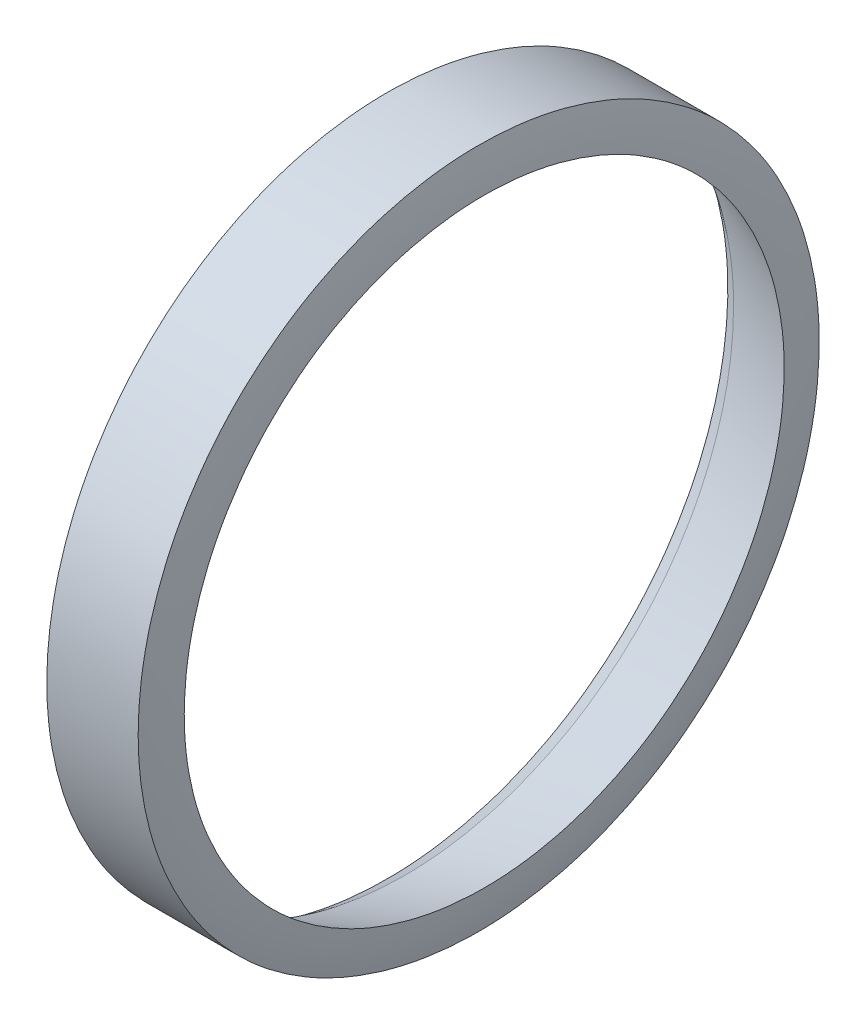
ISO-10303-21;
HEADER;
FILE_DESCRIPTION(('STEP AP214'),'2;1');
FILE_NAME('part.step','',(''),(''),'','','');
FILE_SCHEMA(('AUTOMOTIVE_DESIGN { 1 0 10303 214 1 1 1 1 }'));
ENDSEC;
DATA;
#1=APPLICATION_CONTEXT('core data for automotive mechanical design processes');
#2=APPLICATION_PROTOCOL_DEFINITION('international standard','automotive_design',2000,#1);
#3=PRODUCT_CONTEXT('',#1,'mechanical');
#4=PRODUCT('Part','Part','',(#3));
#5=PRODUCT_RELATED_PRODUCT_CATEGORY('part','',(#4));
#6=PRODUCT_DEFINITION_FORMATION('','',#4);
#7=PRODUCT_DEFINITION_CONTEXT('part definition',#1,'design');
#8=PRODUCT_DEFINITION('design','',#6,#7);
#9=PRODUCT_DEFINITION_SHAPE('','',#8);
#10=(LENGTH_UNIT() NAMED_UNIT(*) SI_UNIT(.MILLI.,.METRE.));
#11=(NAMED_UNIT(*) PLANE_ANGLE_UNIT() SI_UNIT($,.RADIAN.));
#12=(NAMED_UNIT(*) SI_UNIT($,.STERADIAN.) SOLID_ANGLE_UNIT());
#13=UNCERTAINTY_MEASURE_WITH_UNIT(LENGTH_MEASURE(1.E-05),#10,'distance_accuracy_value','');
#14=(GEOMETRIC_REPRESENTATION_CONTEXT(3) GLOBAL_UNCERTAINTY_ASSIGNED_CONTEXT((#13)) GLOBAL_UNIT_ASSIGNED_CONTEXT((#10,
#11,#12)) REPRESENTATION_CONTEXT('',''));
#15=CARTESIAN_POINT('',(0.,0.,0.));
#16=DIRECTION('',(0.,0.,1.));
#17=DIRECTION('',(1.,0.,0.));
#18=AXIS2_PLACEMENT_3D('',#15,#16,#17);
#19=CARTESIAN_POINT('',(352.325861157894,106.286396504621,-53.0057632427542));
#20=CARTESIAN_POINT('',(352.325861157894,109.779908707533,-46.0006226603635));
#21=CARTESIAN_POINT('',(352.325861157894,115.368170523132,-31.2927688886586));
#22=CARTESIAN_POINT('',(352.325861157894,119.227074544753,-8.34919486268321));
#23=CARTESIAN_POINT('',(352.325861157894,118.603522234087,14.9082751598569));
#24=CARTESIAN_POINT('',(352.325861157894,113.377732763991,37.9230051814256));
#25=CARTESIAN_POINT('',(352.325861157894,103.704944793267,59.450286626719));
#26=CARTESIAN_POINT('',(352.325861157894,90.2100452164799,78.4025006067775));
#27=CARTESIAN_POINT('',(352.325861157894,73.3236123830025,94.407097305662));
#28=CARTESIAN_POINT('',(352.325861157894,53.3545495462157,106.985777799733));
#29=CARTESIAN_POINT('',(352.325861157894,31.2927688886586,115.368170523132));
#30=CARTESIAN_POINT('',(352.325861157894,8.3491948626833,119.227074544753));
#31=CARTESIAN_POINT('',(352.325861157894,-14.9082751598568,118.603522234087));
#32=CARTESIAN_POINT('',(352.325861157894,-37.9230051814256,113.377732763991));
#33=CARTESIAN_POINT('',(352.325861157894,-59.4502866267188,103.704944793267));
#34=CARTESIAN_POINT('',(352.325861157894,-78.4025006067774,90.21004521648));
#35=CARTESIAN_POINT('',(352.325861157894,-94.407097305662,73.3236123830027));
#36=CARTESIAN_POINT('',(352.325861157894,-106.985777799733,53.3545495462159));
#37=CARTESIAN_POINT('',(352.325861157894,-115.368170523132,31.2927688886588));
#38=CARTESIAN_POINT('',(352.325861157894,-119.227074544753,8.34919486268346));
#39=CARTESIAN_POINT('',(352.325861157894,-118.603522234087,-14.9082751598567));
#40=CARTESIAN_POINT('',(352.325861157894,-113.377732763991,-37.9230051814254));
#41=CARTESIAN_POINT('',(352.325861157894,-103.704944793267,-59.4502866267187));
#42=CARTESIAN_POINT('',(352.325861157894,-90.2100452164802,-78.4025006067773));
#43=CARTESIAN_POINT('',(352.325861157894,-73.3236123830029,-94.4070973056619));
#44=CARTESIAN_POINT('',(352.325861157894,-53.3545495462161,-106.985777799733));
#45=CARTESIAN_POINT('',(352.325861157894,-31.2927688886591,-115.368170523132));
#46=CARTESIAN_POINT('',(352.325861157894,-8.34919486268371,-119.227074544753));
#47=CARTESIAN_POINT('',(352.325861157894,14.9082751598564,-118.603522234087));
#48=CARTESIAN_POINT('',(352.325861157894,37.9230051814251,-113.377732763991));
#49=CARTESIAN_POINT('',(352.325861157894,59.4502866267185,-103.704944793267));
#50=CARTESIAN_POINT('',(352.325861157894,78.4025006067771,-90.2100452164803));
#51=CARTESIAN_POINT('',(352.325861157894,94.4070973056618,-73.323612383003));
#52=CARTESIAN_POINT('',(352.325861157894,102.792884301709,-60.010903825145));
#53=CARTESIAN_POINT('',(352.325861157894,106.286396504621,-53.0057632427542));
#54=CARTESIAN_POINT('',(352.30498372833,106.298888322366,-53.0119929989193));
#55=CARTESIAN_POINT('',(352.30498372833,109.79281111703,-46.0060291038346));
#56=CARTESIAN_POINT('',(352.30498372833,115.381729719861,-31.2964467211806));
#57=CARTESIAN_POINT('',(352.30498372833,119.241087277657,-8.35017614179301));
#58=CARTESIAN_POINT('',(352.30498372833,118.617461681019,14.9100273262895));
#59=CARTESIAN_POINT('',(352.30498372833,113.39105802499,37.9274622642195));
#60=CARTESIAN_POINT('',(352.30498372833,103.717133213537,59.457273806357));
#61=CARTESIAN_POINT('',(352.30498372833,90.220647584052,78.411715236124));
#62=CARTESIAN_POINT('',(352.30498372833,73.3322300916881,94.4181929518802));
#63=CARTESIAN_POINT('',(352.30498372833,53.3608202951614,106.998351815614));
#64=CARTESIAN_POINT('',(352.30498372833,31.2964467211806,115.381729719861));
#65=CARTESIAN_POINT('',(352.30498372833,8.35017614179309,119.241087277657));
#66=CARTESIAN_POINT('',(352.30498372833,-14.9100273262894,118.617461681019));
#67=CARTESIAN_POINT('',(352.30498372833,-37.9274622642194,113.39105802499));
#68=CARTESIAN_POINT('',(352.30498372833,-59.4572738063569,103.717133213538));
#69=CARTESIAN_POINT('',(352.30498372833,-78.4117152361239,90.2206475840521));
#70=CARTESIAN_POINT('',(352.30498372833,-94.4181929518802,73.3322300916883));
#71=CARTESIAN_POINT('',(352.30498372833,-106.998351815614,53.3608202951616));
#72=CARTESIAN_POINT('',(352.30498372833,-115.381729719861,31.2964467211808));
#73=CARTESIAN_POINT('',(352.30498372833,-119.241087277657,8.35017614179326));
#74=CARTESIAN_POINT('',(352.30498372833,-118.617461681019,-14.9100273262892));
#75=CARTESIAN_POINT('',(352.30498372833,-113.39105802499,-37.9274622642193));
#76=CARTESIAN_POINT('',(352.30498372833,-103.717133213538,-59.4572738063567));
#77=CARTESIAN_POINT('',(352.30498372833,-90.2206475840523,-78.4117152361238));
#78=CARTESIAN_POINT('',(352.30498372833,-73.3322300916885,-94.4181929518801));
#79=CARTESIAN_POINT('',(352.30498372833,-53.3608202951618,-106.998351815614));
#80=CARTESIAN_POINT('',(352.30498372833,-31.296446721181,-115.381729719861));
#81=CARTESIAN_POINT('',(352.30498372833,-8.3501761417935,-119.241087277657));
#82=CARTESIAN_POINT('',(352.30498372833,14.910027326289,-118.617461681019));
#83=CARTESIAN_POINT('',(352.30498372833,37.927462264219,-113.39105802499));
#84=CARTESIAN_POINT('',(352.30498372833,59.4572738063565,-103.717133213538));
#85=CARTESIAN_POINT('',(352.30498372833,78.4117152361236,-90.2206475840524));
#86=CARTESIAN_POINT('',(352.30498372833,94.4181929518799,-73.3322300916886));
#87=CARTESIAN_POINT('',(352.30498372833,102.804965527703,-60.017956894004));
#88=CARTESIAN_POINT('',(352.30498372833,106.298888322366,-53.0119929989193));
#89=CARTESIAN_POINT('',(352.284106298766,106.311380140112,-53.0182227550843));
#90=CARTESIAN_POINT('',(352.284106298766,109.805713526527,-46.0114355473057));
#91=CARTESIAN_POINT('',(352.284106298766,115.39528891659,-31.3001245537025));
#92=CARTESIAN_POINT('',(352.284106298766,119.25510001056,-8.3511574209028));
#93=CARTESIAN_POINT('',(352.284106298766,118.631401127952,14.9117794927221));
#94=CARTESIAN_POINT('',(352.284106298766,113.404383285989,37.9319193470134));
#95=CARTESIAN_POINT('',(352.284106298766,103.729321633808,59.464260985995));
#96=CARTESIAN_POINT('',(352.284106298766,90.231249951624,78.4209298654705));
#97=CARTESIAN_POINT('',(352.284106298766,73.3408478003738,94.4292885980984));
#98=CARTESIAN_POINT('',(352.284106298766,53.3670910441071,107.010925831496));
#99=CARTESIAN_POINT('',(352.284106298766,31.3001245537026,115.39528891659));
#100=CARTESIAN_POINT('',(352.284106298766,8.35115742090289,119.25510001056));
#101=CARTESIAN_POINT('',(352.284106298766,-14.911779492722,118.631401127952));
#102=CARTESIAN_POINT('',(352.284106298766,-37.9319193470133,113.404383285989));
#103=CARTESIAN_POINT('',(352.284106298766,-59.4642609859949,103.729321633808));
#104=CARTESIAN_POINT('',(352.284106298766,-78.4209298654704,90.2312499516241));
#105=CARTESIAN_POINT('',(352.284106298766,-94.4292885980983,73.340847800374));
#106=CARTESIAN_POINT('',(352.284106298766,-107.010925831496,53.3670910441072));
#107=CARTESIAN_POINT('',(352.284106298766,-115.39528891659,31.3001245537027));
#108=CARTESIAN_POINT('',(352.284106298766,-119.255100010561,8.35115742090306));
#109=CARTESIAN_POINT('',(352.284106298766,-118.631401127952,-14.9117794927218));
#110=CARTESIAN_POINT('',(352.284106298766,-113.40438328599,-37.9319193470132));
#111=CARTESIAN_POINT('',(352.284106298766,-103.729321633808,-59.4642609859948));
#112=CARTESIAN_POINT('',(352.284106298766,-90.2312499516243,-78.4209298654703));
#113=CARTESIAN_POINT('',(352.284106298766,-73.3408478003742,-94.4292885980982));
#114=CARTESIAN_POINT('',(352.284106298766,-53.3670910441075,-107.010925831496));
#115=CARTESIAN_POINT('',(352.284106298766,-31.300124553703,-115.39528891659));
#116=CARTESIAN_POINT('',(352.284106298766,-8.3511574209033,-119.255100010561));
#117=CARTESIAN_POINT('',(352.284106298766,14.9117794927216,-118.631401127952));
#118=CARTESIAN_POINT('',(352.284106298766,37.9319193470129,-113.40438328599));
#119=CARTESIAN_POINT('',(352.284106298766,59.4642609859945,-103.729321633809));
#120=CARTESIAN_POINT('',(352.284106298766,78.4209298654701,-90.2312499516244));
#121=CARTESIAN_POINT('',(352.284106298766,94.4292885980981,-73.3408478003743));
#122=CARTESIAN_POINT('',(352.284106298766,102.817046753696,-60.025009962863));
#123=CARTESIAN_POINT('',(352.284106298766,106.311380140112,-53.0182227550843));
#124=CARTESIAN_POINT('',(352.263228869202,106.323871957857,-53.0244525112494));
#125=CARTESIAN_POINT('',(352.263228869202,109.818615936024,-46.0168419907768));
#126=CARTESIAN_POINT('',(352.263228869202,115.408848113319,-31.3038023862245));
#127=CARTESIAN_POINT('',(352.263228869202,119.269112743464,-8.3521387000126));
#128=CARTESIAN_POINT('',(352.263228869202,118.645340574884,14.9135316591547));
#129=CARTESIAN_POINT('',(352.263228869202,113.417708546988,37.9363764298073));
#130=CARTESIAN_POINT('',(352.263228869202,103.741510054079,59.471248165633));
#131=CARTESIAN_POINT('',(352.263228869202,90.2418523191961,78.430144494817));
#132=CARTESIAN_POINT('',(352.263228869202,73.3494655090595,94.4403842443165));
#133=CARTESIAN_POINT('',(352.263228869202,53.3733617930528,107.023499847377));
#134=CARTESIAN_POINT('',(352.263228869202,31.3038023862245,115.408848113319));
#135=CARTESIAN_POINT('',(352.263228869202,8.35213870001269,119.269112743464));
#136=CARTESIAN_POINT('',(352.263228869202,-14.9135316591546,118.645340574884));
#137=CARTESIAN_POINT('',(352.263228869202,-37.9363764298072,113.417708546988));
#138=CARTESIAN_POINT('',(352.263228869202,-59.4712481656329,103.741510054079));
#139=CARTESIAN_POINT('',(352.263228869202,-78.4301444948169,90.2418523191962));
#140=CARTESIAN_POINT('',(352.263228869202,-94.4403842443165,73.3494655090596));
#141=CARTESIAN_POINT('',(352.263228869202,-107.023499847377,53.3733617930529));
#142=CARTESIAN_POINT('',(352.263228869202,-115.408848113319,31.3038023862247));
#143=CARTESIAN_POINT('',(352.263228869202,-119.269112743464,8.35213870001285));
#144=CARTESIAN_POINT('',(352.263228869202,-118.645340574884,-14.9135316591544));
#145=CARTESIAN_POINT('',(352.263228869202,-113.417708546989,-37.9363764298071));
#146=CARTESIAN_POINT('',(352.263228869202,-103.741510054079,-59.4712481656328));
#147=CARTESIAN_POINT('',(352.263228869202,-90.2418523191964,-78.4301444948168));
#148=CARTESIAN_POINT('',(352.263228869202,-73.3494655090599,-94.4403842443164));
#149=CARTESIAN_POINT('',(352.263228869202,-53.3733617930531,-107.023499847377));
#150=CARTESIAN_POINT('',(352.263228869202,-31.3038023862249,-115.408848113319));
#151=CARTESIAN_POINT('',(352.263228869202,-8.3521387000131,-119.269112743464));
#152=CARTESIAN_POINT('',(352.263228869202,14.9135316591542,-118.645340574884));
#153=CARTESIAN_POINT('',(352.263228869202,37.9363764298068,-113.417708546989));
#154=CARTESIAN_POINT('',(352.263228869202,59.4712481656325,-103.741510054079));
#155=CARTESIAN_POINT('',(352.263228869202,78.4301444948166,-90.2418523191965));
#156=CARTESIAN_POINT('',(352.263228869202,94.4403842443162,-73.34946550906));
#157=CARTESIAN_POINT('',(352.263228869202,102.82912797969,-60.032063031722));
#158=CARTESIAN_POINT('',(352.263228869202,106.323871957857,-53.0244525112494));
#159=CARTESIAN_POINT('',(350.175485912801,107.5730537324,-53.6474281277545));
#160=CARTESIAN_POINT('',(350.175485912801,111.108856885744,-46.5574863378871));
#161=CARTESIAN_POINT('',(350.175485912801,116.764767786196,-31.6715856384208));
#162=CARTESIAN_POINT('',(350.175485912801,120.670386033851,-8.45026661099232));
#163=CARTESIAN_POINT('',(350.175485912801,120.039285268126,15.0887483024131));
#164=CARTESIAN_POINT('',(350.175485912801,114.750234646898,38.3820847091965));
#165=CARTESIAN_POINT('',(350.175485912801,104.96035208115,60.1699661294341));
#166=CARTESIAN_POINT('',(350.175485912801,91.3020890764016,79.3516074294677));
#167=CARTESIAN_POINT('',(350.175485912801,74.2112363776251,95.5499488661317));
#168=CARTESIAN_POINT('',(350.175485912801,54.0004366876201,108.280901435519));
#169=CARTESIAN_POINT('',(350.175485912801,31.6715856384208,116.764767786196));
#170=CARTESIAN_POINT('',(350.175485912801,8.45026661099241,120.670386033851));
#171=CARTESIAN_POINT('',(350.175485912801,-15.088748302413,120.039285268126));
#172=CARTESIAN_POINT('',(350.175485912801,-38.3820847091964,114.750234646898));
#173=CARTESIAN_POINT('',(350.175485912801,-60.169966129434,104.96035208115));
#174=CARTESIAN_POINT('',(350.175485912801,-79.3516074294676,91.3020890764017));
#175=CARTESIAN_POINT('',(350.175485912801,-95.5499488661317,74.2112363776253));
#176=CARTESIAN_POINT('',(350.175485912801,-108.280901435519,54.0004366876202));
#177=CARTESIAN_POINT('',(350.175485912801,-116.764767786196,31.6715856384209));
#178=CARTESIAN_POINT('',(350.175485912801,-120.670386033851,8.45026661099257));
#179=CARTESIAN_POINT('',(350.175485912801,-120.039285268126,-15.0887483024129));
#180=CARTESIAN_POINT('',(350.175485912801,-114.750234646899,-38.3820847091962));
#181=CARTESIAN_POINT('',(350.175485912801,-104.96035208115,-60.1699661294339));
#182=CARTESIAN_POINT('',(350.175485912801,-91.3020890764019,-79.3516074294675));
#183=CARTESIAN_POINT('',(350.175485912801,-74.2112363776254,-95.5499488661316));
#184=CARTESIAN_POINT('',(350.175485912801,-54.0004366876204,-108.280901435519));
#185=CARTESIAN_POINT('',(350.175485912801,-31.6715856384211,-116.764767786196));
#186=CARTESIAN_POINT('',(350.175485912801,-8.45026661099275,-120.670386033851));
#187=CARTESIAN_POINT('',(350.175485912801,15.0887483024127,-120.039285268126));
#188=CARTESIAN_POINT('',(350.175485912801,38.3820847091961,-114.750234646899));
#189=CARTESIAN_POINT('',(350.175485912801,60.1699661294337,-104.96035208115));
#190=CARTESIAN_POINT('',(350.175485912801,79.3516074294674,-91.302089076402));
#191=CARTESIAN_POINT('',(350.175485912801,95.5499488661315,-74.2112363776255));
#192=CARTESIAN_POINT('',(350.175485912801,104.037250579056,-60.737369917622));
#193=CARTESIAN_POINT('',(350.175485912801,107.5730537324,-53.6474281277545));
#194=CARTESIAN_POINT('',(348.087742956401,108.822235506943,-54.2704037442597));
#195=CARTESIAN_POINT('',(348.087742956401,112.399097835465,-47.0981306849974));
#196=CARTESIAN_POINT('',(348.087742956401,118.120687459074,-32.039368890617));
#197=CARTESIAN_POINT('',(348.087742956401,122.071659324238,-8.54839452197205));
#198=CARTESIAN_POINT('',(348.087742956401,121.433229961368,15.2639649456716));
#199=CARTESIAN_POINT('',(348.087742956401,116.082760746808,38.8277929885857));
#200=CARTESIAN_POINT('',(348.087742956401,106.17919410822,60.8686840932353));
#201=CARTESIAN_POINT('',(348.087742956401,92.3623258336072,80.2730703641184));
#202=CARTESIAN_POINT('',(348.087742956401,75.0730072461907,96.659513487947));
#203=CARTESIAN_POINT('',(348.087742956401,54.6275115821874,109.53830302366));
#204=CARTESIAN_POINT('',(348.087742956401,32.039368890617,118.120687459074));
#205=CARTESIAN_POINT('',(348.087742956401,8.54839452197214,122.071659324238));
#206=CARTESIAN_POINT('',(348.087742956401,-15.2639649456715,121.433229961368));
#207=CARTESIAN_POINT('',(348.087742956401,-38.8277929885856,116.082760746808));
#208=CARTESIAN_POINT('',(348.087742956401,-60.8686840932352,106.17919410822));
#209=CARTESIAN_POINT('',(348.087742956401,-80.2730703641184,92.3623258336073));
#210=CARTESIAN_POINT('',(348.087742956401,-96.659513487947,75.0730072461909));
#211=CARTESIAN_POINT('',(348.087742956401,-109.53830302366,54.6275115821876));
#212=CARTESIAN_POINT('',(348.087742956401,-118.120687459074,32.0393688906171));
#213=CARTESIAN_POINT('',(348.087742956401,-122.071659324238,8.54839452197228));
#214=CARTESIAN_POINT('',(348.087742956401,-121.433229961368,-15.2639649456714));
#215=CARTESIAN_POINT('',(348.087742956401,-116.082760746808,-38.8277929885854));
#216=CARTESIAN_POINT('',(348.087742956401,-106.179194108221,-60.8686840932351));
#217=CARTESIAN_POINT('',(348.087742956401,-92.3623258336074,-80.2730703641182));
#218=CARTESIAN_POINT('',(348.087742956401,-75.073007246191,-96.6595134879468));
#219=CARTESIAN_POINT('',(348.087742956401,-54.6275115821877,-109.53830302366));
#220=CARTESIAN_POINT('',(348.087742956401,-32.0393688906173,-118.120687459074));
#221=CARTESIAN_POINT('',(348.087742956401,-8.54839452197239,-122.071659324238));
#222=CARTESIAN_POINT('',(348.087742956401,15.2639649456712,-121.433229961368));
#223=CARTESIAN_POINT('',(348.087742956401,38.8277929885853,-116.082760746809));
#224=CARTESIAN_POINT('',(348.087742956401,60.868684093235,-106.179194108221));
#225=CARTESIAN_POINT('',(348.087742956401,80.2730703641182,-92.3623258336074));
#226=CARTESIAN_POINT('',(348.087742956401,96.6595134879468,-75.073007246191));
#227=CARTESIAN_POINT('',(348.087742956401,105.245373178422,-61.442676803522));
#228=CARTESIAN_POINT('',(348.087742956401,108.822235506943,-54.2704037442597));
#229=CARTESIAN_POINT('',(346.,110.071417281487,-54.8933793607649));
#230=CARTESIAN_POINT('',(346.,113.689338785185,-47.6387750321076));
#231=CARTESIAN_POINT('',(346.,119.476607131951,-32.4071521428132));
#232=CARTESIAN_POINT('',(346.,123.472932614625,-8.64652243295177));
#233=CARTESIAN_POINT('',(346.,122.82717465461,15.4391815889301));
#234=CARTESIAN_POINT('',(346.,117.415286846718,39.2735012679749));
#235=CARTESIAN_POINT('',(346.,107.398036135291,61.5674020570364));
#236=CARTESIAN_POINT('',(346.,93.4225625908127,81.1945332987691));
#237=CARTESIAN_POINT('',(346.,75.9347781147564,97.7690781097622));
#238=CARTESIAN_POINT('',(346.,55.2545864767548,110.795704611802));
#239=CARTESIAN_POINT('',(346.,32.4071521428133,119.476607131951));
#240=CARTESIAN_POINT('',(346.,8.64652243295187,123.472932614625));
#241=CARTESIAN_POINT('',(346.,-15.4391815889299,122.82717465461));
#242=CARTESIAN_POINT('',(346.,-39.2735012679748,117.415286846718));
#243=CARTESIAN_POINT('',(346.,-61.5674020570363,107.398036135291));
#244=CARTESIAN_POINT('',(346.,-81.194533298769,93.4225625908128));
#245=CARTESIAN_POINT('',(346.,-97.7690781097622,75.9347781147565));
#246=CARTESIAN_POINT('',(346.,-110.795704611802,55.2545864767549));
#247=CARTESIAN_POINT('',(346.,-119.476607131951,32.4071521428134));
#248=CARTESIAN_POINT('',(346.,-123.472932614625,8.64652243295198));
#249=CARTESIAN_POINT('',(346.,-122.82717465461,-15.4391815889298));
#250=CARTESIAN_POINT('',(346.,-117.415286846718,-39.2735012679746));
#251=CARTESIAN_POINT('',(346.,-107.398036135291,-61.5674020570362));
#252=CARTESIAN_POINT('',(346.,-93.4225625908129,-81.1945332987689));
#253=CARTESIAN_POINT('',(346.,-75.9347781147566,-97.769078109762));
#254=CARTESIAN_POINT('',(346.,-55.2545864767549,-110.795704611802));
#255=CARTESIAN_POINT('',(346.,-32.4071521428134,-119.476607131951));
#256=CARTESIAN_POINT('',(346.,-8.64652243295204,-123.472932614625));
#257=CARTESIAN_POINT('',(346.,15.4391815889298,-122.82717465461));
#258=CARTESIAN_POINT('',(346.,39.2735012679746,-117.415286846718));
#259=CARTESIAN_POINT('',(346.,61.5674020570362,-107.398036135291));
#260=CARTESIAN_POINT('',(346.,81.1945332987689,-93.4225625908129));
#261=CARTESIAN_POINT('',(346.,97.7690781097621,-75.9347781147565));
#262=CARTESIAN_POINT('',(346.,106.453495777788,-62.1479836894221));
#263=CARTESIAN_POINT('',(346.,110.071417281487,-54.8933793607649));
#264=CARTESIAN_POINT('',(345.97891379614,110.08403401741,-54.8996714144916));
#265=CARTESIAN_POINT('',(345.97891379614,113.702370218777,-47.6442355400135));
#266=CARTESIAN_POINT('',(345.97891379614,119.490301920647,-32.4108667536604));
#267=CARTESIAN_POINT('',(345.97891379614,123.487085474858,-8.64751352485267));
#268=CARTESIAN_POINT('',(345.97891379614,122.841253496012,15.440951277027));
#269=CARTESIAN_POINT('',(345.97891379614,117.428745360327,39.2780029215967));
#270=CARTESIAN_POINT('',(345.97891379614,107.410346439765,61.5744591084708));
#271=CARTESIAN_POINT('',(345.97891379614,93.4332709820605,81.2038400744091));
#272=CARTESIAN_POINT('',(345.97891379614,75.9434820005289,97.7802847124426));
#273=CARTESIAN_POINT('',(345.97891379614,55.2609199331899,110.808404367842));
#274=CARTESIAN_POINT('',(345.97891379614,32.4108667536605,119.490301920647));
#275=CARTESIAN_POINT('',(345.97891379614,8.64751352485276,123.487085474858));
#276=CARTESIAN_POINT('',(345.97891379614,-15.4409512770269,122.841253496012));
#277=CARTESIAN_POINT('',(345.97891379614,-39.2780029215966,117.428745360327));
#278=CARTESIAN_POINT('',(345.97891379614,-61.5744591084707,107.410346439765));
#279=CARTESIAN_POINT('',(345.97891379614,-81.203840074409,93.4332709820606));
#280=CARTESIAN_POINT('',(345.97891379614,-97.7802847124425,75.943482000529));
#281=CARTESIAN_POINT('',(345.97891379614,-110.808404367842,55.26091993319));
#282=CARTESIAN_POINT('',(345.97891379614,-119.490301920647,32.4108667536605));
#283=CARTESIAN_POINT('',(345.97891379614,-123.487085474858,8.64751352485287));
#284=CARTESIAN_POINT('',(345.97891379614,-122.841253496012,-15.4409512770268));
#285=CARTESIAN_POINT('',(345.97891379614,-117.428745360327,-39.2780029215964));
#286=CARTESIAN_POINT('',(345.97891379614,-107.410346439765,-61.5744591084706));
#287=CARTESIAN_POINT('',(345.97891379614,-93.4332709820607,-81.2038400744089));
#288=CARTESIAN_POINT('',(345.97891379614,-75.9434820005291,-97.7802847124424));
#289=CARTESIAN_POINT('',(345.97891379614,-55.2609199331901,-110.808404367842));
#290=CARTESIAN_POINT('',(345.97891379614,-32.4108667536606,-119.490301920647));
#291=CARTESIAN_POINT('',(345.97891379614,-8.64751352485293,-123.487085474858));
#292=CARTESIAN_POINT('',(345.97891379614,15.4409512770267,-122.841253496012));
#293=CARTESIAN_POINT('',(345.97891379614,39.2780029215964,-117.428745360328));
#294=CARTESIAN_POINT('',(345.97891379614,61.5744591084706,-107.410346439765));
#295=CARTESIAN_POINT('',(345.97891379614,81.2038400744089,-93.4332709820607));
#296=CARTESIAN_POINT('',(345.97891379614,97.7802847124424,-75.9434820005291));
#297=CARTESIAN_POINT('',(345.97891379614,106.465697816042,-62.1551072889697));
#298=CARTESIAN_POINT('',(345.97891379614,110.08403401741,-54.8996714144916));
#299=CARTESIAN_POINT('',(345.957827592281,110.096650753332,-54.9059634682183));
#300=CARTESIAN_POINT('',(345.957827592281,113.715401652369,-47.6496960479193));
#301=CARTESIAN_POINT('',(345.957827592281,119.503996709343,-32.4145813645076));
#302=CARTESIAN_POINT('',(345.957827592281,123.501238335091,-8.64850461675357));
#303=CARTESIAN_POINT('',(345.957827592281,122.855332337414,15.4427209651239));
#304=CARTESIAN_POINT('',(345.957827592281,117.442203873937,39.2825045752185));
#305=CARTESIAN_POINT('',(345.957827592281,107.422656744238,61.5815161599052));
#306=CARTESIAN_POINT('',(345.957827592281,93.4439793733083,81.2131468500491));
#307=CARTESIAN_POINT('',(345.957827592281,75.9521858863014,97.7914913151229));
#308=CARTESIAN_POINT('',(345.957827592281,55.267253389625,110.821104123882));
#309=CARTESIAN_POINT('',(345.957827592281,32.4145813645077,119.503996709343));
#310=CARTESIAN_POINT('',(345.957827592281,8.64850461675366,123.501238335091));
#311=CARTESIAN_POINT('',(345.957827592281,-15.4427209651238,122.855332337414));
#312=CARTESIAN_POINT('',(345.957827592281,-39.2825045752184,117.442203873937));
#313=CARTESIAN_POINT('',(345.957827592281,-61.5815161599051,107.422656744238));
#314=CARTESIAN_POINT('',(345.957827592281,-81.213146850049,93.4439793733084));
#315=CARTESIAN_POINT('',(345.957827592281,-97.7914913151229,75.9521858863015));
#316=CARTESIAN_POINT('',(345.957827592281,-110.821104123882,55.2672533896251));
#317=CARTESIAN_POINT('',(345.957827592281,-119.503996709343,32.4145813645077));
#318=CARTESIAN_POINT('',(345.957827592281,-123.501238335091,8.64850461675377));
#319=CARTESIAN_POINT('',(345.957827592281,-122.855332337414,-15.4427209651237));
#320=CARTESIAN_POINT('',(345.957827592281,-117.442203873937,-39.2825045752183));
#321=CARTESIAN_POINT('',(345.957827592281,-107.422656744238,-61.581516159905));
#322=CARTESIAN_POINT('',(345.957827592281,-93.4439793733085,-81.2131468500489));
#323=CARTESIAN_POINT('',(345.957827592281,-75.9521858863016,-97.7914913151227));
#324=CARTESIAN_POINT('',(345.957827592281,-55.2672533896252,-110.821104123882));
#325=CARTESIAN_POINT('',(345.957827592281,-32.4145813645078,-119.503996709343));
#326=CARTESIAN_POINT('',(345.957827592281,-8.64850461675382,-123.501238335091));
#327=CARTESIAN_POINT('',(345.957827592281,15.4427209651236,-122.855332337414));
#328=CARTESIAN_POINT('',(345.957827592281,39.2825045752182,-117.442203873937));
#329=CARTESIAN_POINT('',(345.957827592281,61.581516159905,-107.422656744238));
#330=CARTESIAN_POINT('',(345.957827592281,81.2131468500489,-93.4439793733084));
#331=CARTESIAN_POINT('',(345.957827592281,97.7914913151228,-75.9521858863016));
#332=CARTESIAN_POINT('',(345.957827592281,106.477899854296,-62.1622308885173));
#333=CARTESIAN_POINT('',(345.957827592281,110.096650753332,-54.9059634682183));
#334=CARTESIAN_POINT('',(345.936741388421,110.109267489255,-54.912255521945));
#335=CARTESIAN_POINT('',(345.936741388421,113.728433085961,-47.6551565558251));
#336=CARTESIAN_POINT('',(345.936741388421,119.517691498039,-32.4182959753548));
#337=CARTESIAN_POINT('',(345.936741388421,123.515391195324,-8.64949570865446));
#338=CARTESIAN_POINT('',(345.936741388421,122.869411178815,15.4444906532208));
#339=CARTESIAN_POINT('',(345.936741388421,117.455662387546,39.2870062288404));
#340=CARTESIAN_POINT('',(345.936741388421,107.434967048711,61.5885732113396));
#341=CARTESIAN_POINT('',(345.936741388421,93.4546877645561,81.2224536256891));
#342=CARTESIAN_POINT('',(345.936741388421,75.9608897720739,97.8026979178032));
#343=CARTESIAN_POINT('',(345.936741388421,55.2735868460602,110.833803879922));
#344=CARTESIAN_POINT('',(345.936741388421,32.4182959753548,119.517691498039));
#345=CARTESIAN_POINT('',(345.936741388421,8.64949570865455,123.515391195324));
#346=CARTESIAN_POINT('',(345.936741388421,-15.4444906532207,122.869411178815));
#347=CARTESIAN_POINT('',(345.936741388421,-39.2870062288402,117.455662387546));
#348=CARTESIAN_POINT('',(345.936741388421,-61.5885732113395,107.434967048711));
#349=CARTESIAN_POINT('',(345.936741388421,-81.222453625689,93.4546877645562));
#350=CARTESIAN_POINT('',(345.936741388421,-97.8026979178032,75.960889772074));
#351=CARTESIAN_POINT('',(345.936741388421,-110.833803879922,55.2735868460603));
#352=CARTESIAN_POINT('',(345.936741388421,-119.517691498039,32.4182959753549));
#353=CARTESIAN_POINT('',(345.936741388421,-123.515391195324,8.64949570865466));
#354=CARTESIAN_POINT('',(345.936741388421,-122.869411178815,-15.4444906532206));
#355=CARTESIAN_POINT('',(345.936741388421,-117.455662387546,-39.2870062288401));
#356=CARTESIAN_POINT('',(345.936741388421,-107.434967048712,-61.5885732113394));
#357=CARTESIAN_POINT('',(345.936741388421,-93.4546877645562,-81.2224536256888));
#358=CARTESIAN_POINT('',(345.936741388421,-75.9608897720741,-97.802697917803));
#359=CARTESIAN_POINT('',(345.936741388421,-55.2735868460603,-110.833803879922));
#360=CARTESIAN_POINT('',(345.936741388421,-32.418295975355,-119.517691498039));
#361=CARTESIAN_POINT('',(345.936741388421,-8.64949570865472,-123.515391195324));
#362=CARTESIAN_POINT('',(345.936741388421,15.4444906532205,-122.869411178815));
#363=CARTESIAN_POINT('',(345.936741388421,39.2870062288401,-117.455662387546));
#364=CARTESIAN_POINT('',(345.936741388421,61.5885732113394,-107.434967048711));
#365=CARTESIAN_POINT('',(345.936741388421,81.2224536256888,-93.4546877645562));
#366=CARTESIAN_POINT('',(345.936741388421,97.8026979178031,-75.9608897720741));
#367=CARTESIAN_POINT('',(345.936741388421,106.490101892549,-62.1693544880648));
#368=CARTESIAN_POINT('',(345.936741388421,110.109267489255,-54.912255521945));
#369=B_SPLINE_SURFACE_WITH_KNOTS('',3,3,((#19,#20,#21,#22,#23,#24,#25,#26,#27,#28,#29,#30,#31,
#32,#33,#34,#35,#36,#37,#38,#39,#40,#41,#42,#43,#44,#45,#46,#47,#48,#49,#50,#51,#52,#53),(#54,
#55,#56,#57,#58,#59,#60,#61,#62,#63,#64,#65,#66,#67,#68,#69,#70,#71,#72,#73,#74,#75,#76,#77,#78,
#79,#80,#81,#82,#83,#84,#85,#86,#87,#88),(#89,#90,#91,#92,#93,#94,#95,#96,#97,#98,#99,#100,#101,
#102,#103,#104,#105,#106,#107,#108,#109,#110,#111,#112,#113,#114,#115,#116,#117,#118,#119,#120,
#121,#122,#123),(#124,#125,#126,#127,#128,#129,#130,#131,#132,#133,#134,#135,#136,#137,#138,
#139,#140,#141,#142,#143,#144,#145,#146,#147,#148,#149,#150,#151,#152,#153,#154,#155,#156,#157,
#158),(#159,#160,#161,#162,#163,#164,#165,#166,#167,#168,#169,#170,#171,#172,#173,#174,#175,
#176,#177,#178,#179,#180,#181,#182,#183,#184,#185,#186,#187,#188,#189,#190,#191,#192,#193),
(#194,#195,#196,#197,#198,#199,#200,#201,#202,#203,#204,#205,#206,#207,#208,#209,#210,#211,#212,
#213,#214,#215,#216,#217,#218,#219,#220,#221,#222,#223,#224,#225,#226,#227,#228),(#229,#230,
#231,#232,#233,#234,#235,#236,#237,#238,#239,#240,#241,#242,#243,#244,#245,#246,#247,#248,#249,
#250,#251,#252,#253,#254,#255,#256,#257,#258,#259,#260,#261,#262,#263),(#264,#265,#266,#267,
#268,#269,#270,#271,#272,#273,#274,#275,#276,#277,#278,#279,#280,#281,#282,#283,#284,#285,#286,
#287,#288,#289,#290,#291,#292,#293,#294,#295,#296,#297,#298),(#299,#300,#301,#302,#303,#304,
#305,#306,#307,#308,#309,#310,#311,#312,#313,#314,#315,#316,#317,#318,#319,#320,#321,#322,#323,
#324,#325,#326,#327,#328,#329,#330,#331,#332,#333),(#334,#335,#336,#337,#338,#339,#340,#341,
#342,#343,#344,#345,#346,#347,#348,#349,#350,#351,#352,#353,#354,#355,#356,#357,#358,#359,#360,
#361,#362,#363,#364,#365,#366,#367,#368)),.UNSPECIFIED.,.F.,.T.,.F.,(4,3,3,4),(4,1,1,1,1,1,1,1,
1,1,1,1,1,1,1,1,1,1,1,1,1,1,1,1,1,1,1,1,1,1,1,1,4),(-0.01,0.,1.,1.0101),(0.,0.03125,0.0625,
0.09375,0.125,0.15625,0.1875,0.21875,0.25,0.28125,0.3125,0.34375,0.375,0.40625,0.4375,0.46875,
0.5,0.53125,0.5625,0.59375,0.625,0.65625,0.6875,0.71875,0.75,0.78125,0.8125,0.84375,0.875,
0.90625,0.9375,0.96875,1.),.UNSPECIFIED.);
#370=CARTESIAN_POINT('',(352.263228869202,106.323871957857,-53.0244525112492));
#371=CARTESIAN_POINT('',(352.26323055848,106.886663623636,-51.8959483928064));
#372=CARTESIAN_POINT('',(352.262591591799,107.431710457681,-50.758558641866));
#373=CARTESIAN_POINT('',(352.261016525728,108.485398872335,-48.4670835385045));
#374=CARTESIAN_POINT('',(352.260080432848,108.994041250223,-47.3129985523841));
#375=CARTESIAN_POINT('',(352.258568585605,109.974649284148,-44.9881203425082));
#376=CARTESIAN_POINT('',(352.257993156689,110.446581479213,-43.8173130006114));
#377=CARTESIAN_POINT('',(352.257543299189,111.352738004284,-41.460962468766));
#378=CARTESIAN_POINT('',(352.257668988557,111.786955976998,-40.2754168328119));
#379=CARTESIAN_POINT('',(352.258566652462,112.567963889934,-38.0322694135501));
#380=CARTESIAN_POINT('',(352.259260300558,112.919017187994,-36.9761487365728));
#381=CARTESIAN_POINT('',(352.260978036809,113.591216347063,-34.8543682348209));
#382=CARTESIAN_POINT('',(352.262002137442,113.912361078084,-33.7887080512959));
#383=CARTESIAN_POINT('',(352.26346542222,114.371618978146,-32.1835452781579));
#384=CARTESIAN_POINT('',(352.263941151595,114.520997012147,-31.6472411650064));
#385=CARTESIAN_POINT('',(352.264793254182,114.812235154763,-30.5725954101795));
#386=CARTESIAN_POINT('',(352.265169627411,114.954095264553,-30.0342537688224));
#387=CARTESIAN_POINT('',(352.266146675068,115.36835273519,-28.416345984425));
#388=CARTESIAN_POINT('',(352.266595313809,115.629437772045,-27.333860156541));
#389=CARTESIAN_POINT('',(352.267103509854,116.121242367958,-25.161882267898));
#390=CARTESIAN_POINT('',(352.267163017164,116.35195802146,-24.0723893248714));
#391=CARTESIAN_POINT('',(352.266961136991,116.782785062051,-21.8873616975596));
#392=CARTESIAN_POINT('',(352.2666997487,116.982896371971,-20.7918269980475));
#393=CARTESIAN_POINT('',(352.265967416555,117.352606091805,-18.5938487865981));
#394=CARTESIAN_POINT('',(352.26549614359,117.522155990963,-17.4913971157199));
#395=CARTESIAN_POINT('',(352.264504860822,117.83016366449,-15.282159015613));
#396=CARTESIAN_POINT('',(352.263984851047,117.968621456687,-14.1753725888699));
#397=CARTESIAN_POINT('',(352.263077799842,118.214252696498,-11.9584861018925));
#398=CARTESIAN_POINT('',(352.262690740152,118.321430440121,-10.8483865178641));
#399=CARTESIAN_POINT('',(352.262340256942,118.504336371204,-8.62560167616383));
#400=CARTESIAN_POINT('',(352.26237683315,118.580064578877,-7.51291642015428));
#401=CARTESIAN_POINT('',(352.262831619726,118.700024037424,-5.285868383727));
#402=CARTESIAN_POINT('',(352.263249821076,118.744256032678,-4.17150564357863));
#403=CARTESIAN_POINT('',(352.264194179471,118.801292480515,-1.94200647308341));
#404=CARTESIAN_POINT('',(352.264720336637,118.814096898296,-0.826870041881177));
#405=CARTESIAN_POINT('',(352.266171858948,118.805453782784,2.51521238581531));
#406=CARTESIAN_POINT('',(352.26697224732,118.737130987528,4.74220736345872));
#407=CARTESIAN_POINT('',(352.267216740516,118.475891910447,9.18896989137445));
#408=CARTESIAN_POINT('',(352.266660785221,118.28297010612,11.408737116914));
#409=CARTESIAN_POINT('',(352.264493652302,117.900770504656,14.7274510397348));
#410=CARTESIAN_POINT('',(352.263549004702,117.757892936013,15.8319139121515));
#411=CARTESIAN_POINT('',(352.261596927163,117.441163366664,18.0364204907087));
#412=CARTESIAN_POINT('',(352.260589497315,117.267311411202,19.1364642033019));
#413=CARTESIAN_POINT('',(352.258957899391,116.888688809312,21.3307588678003));
#414=CARTESIAN_POINT('',(352.258333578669,116.683930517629,22.425011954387));
#415=CARTESIAN_POINT('',(352.257639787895,116.243546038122,24.6072905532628));
#416=CARTESIAN_POINT('',(352.257570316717,116.007919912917,25.6953160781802));
#417=CARTESIAN_POINT('',(352.257970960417,115.505997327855,27.8642552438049));
#418=CARTESIAN_POINT('',(352.258441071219,115.239701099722,28.9451689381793));
#419=CARTESIAN_POINT('',(352.259702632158,114.67672003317,31.0990704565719));
#420=CARTESIAN_POINT('',(352.260494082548,114.380035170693,32.1720582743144));
#421=CARTESIAN_POINT('',(352.261605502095,113.912518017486,33.7749426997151));
#422=CARTESIAN_POINT('',(352.261963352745,113.752928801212,34.3081437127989));
#423=CARTESIAN_POINT('',(352.262583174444,113.426305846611,35.3722637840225));
#424=CARTESIAN_POINT('',(352.26284514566,113.259272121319,35.9031828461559));
#425=CARTESIAN_POINT('',(352.263183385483,112.917824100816,36.9626434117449));
#426=CARTESIAN_POINT('',(352.263259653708,112.743409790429,37.4911849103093));
#427=CARTESIAN_POINT('',(352.263165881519,112.387257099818,38.5457906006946));
#428=CARTESIAN_POINT('',(352.26299584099,112.205518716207,39.0718547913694));
#429=CARTESIAN_POINT('',(352.262276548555,111.648856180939,40.6474547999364));
#430=CARTESIAN_POINT('',(352.261518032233,111.262897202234,41.6931175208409));
#431=CARTESIAN_POINT('',(352.260007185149,110.461714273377,43.7731514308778));
#432=CARTESIAN_POINT('',(352.259254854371,110.046490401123,44.8075226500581));
#433=CARTESIAN_POINT('',(352.258134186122,109.186977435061,46.8641115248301));
#434=CARTESIAN_POINT('',(352.257765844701,108.742688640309,47.8863293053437));
#435=CARTESIAN_POINT('',(352.257591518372,107.825340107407,49.9177723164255));
#436=CARTESIAN_POINT('',(352.25778553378,107.352280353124,50.9269975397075));
#437=CARTESIAN_POINT('',(352.258706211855,106.377771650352,52.9316661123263));
#438=CARTESIAN_POINT('',(352.259432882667,105.876322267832,53.9271092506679));
#439=CARTESIAN_POINT('',(352.261206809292,104.845510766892,55.9034362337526));
#440=CARTESIAN_POINT('',(352.262254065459,104.316148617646,56.8843200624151));
#441=CARTESIAN_POINT('',(352.264157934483,103.230055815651,58.8309087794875));
#442=CARTESIAN_POINT('',(352.265014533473,102.67332317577,59.7966125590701));
#443=CARTESIAN_POINT('',(352.266278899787,101.533043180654,61.7120568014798));
#444=CARTESIAN_POINT('',(352.266686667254,100.949495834,62.6617972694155));
#445=CARTESIAN_POINT('',(352.267127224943,99.7560130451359,64.54456860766));
#446=CARTESIAN_POINT('',(352.267160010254,99.1460772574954,65.4775992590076));
#447=CARTESIAN_POINT('',(352.266908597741,97.9002863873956,67.3261933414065));
#448=CARTESIAN_POINT('',(352.266624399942,97.2644313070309,68.2417567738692));
#449=CARTESIAN_POINT('',(352.265858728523,95.9672800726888,70.0546521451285));
#450=CARTESIAN_POINT('',(352.265377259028,95.3059844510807,70.9519844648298));
#451=CARTESIAN_POINT('',(352.264380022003,93.9584145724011,72.7276931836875));
#452=CARTESIAN_POINT('',(352.26386425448,93.2721403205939,73.6060695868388));
#453=CARTESIAN_POINT('',(352.262983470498,91.8758500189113,75.3422015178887));
#454=CARTESIAN_POINT('',(352.262618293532,91.1658601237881,76.1999780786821));
#455=CARTESIAN_POINT('',(352.262330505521,89.7219305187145,77.8951271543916));
#456=CARTESIAN_POINT('',(352.262407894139,88.9879908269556,78.7324996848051));
#457=CARTESIAN_POINT('',(352.262917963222,87.4967624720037,80.3862009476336));
#458=CARTESIAN_POINT('',(352.263350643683,86.73947380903,81.2025296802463));
#459=CARTESIAN_POINT('',(352.264309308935,85.2022513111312,82.8135319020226));
#460=CARTESIAN_POINT('',(352.264835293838,84.4223174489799,83.6082053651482));
#461=CARTESIAN_POINT('',(352.266268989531,82.0494990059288,85.9588960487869));
#462=CARTESIAN_POINT('',(352.267032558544,80.4234669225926,87.481728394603));
#463=CARTESIAN_POINT('',(352.267176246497,77.0889265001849,90.4338089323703));
#464=CARTESIAN_POINT('',(352.266556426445,75.380421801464,91.8630612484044));
#465=CARTESIAN_POINT('',(352.263555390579,71.8860383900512,94.6239111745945));
#466=CARTESIAN_POINT('',(352.261174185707,70.1001601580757,95.9555093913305));
#467=CARTESIAN_POINT('',(352.258808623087,67.3673078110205,97.8755674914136));
#468=CARTESIAN_POINT('',(352.258221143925,66.4472954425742,98.5027316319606));
#469=CARTESIAN_POINT('',(352.257607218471,64.5899064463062,99.7307761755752));
#470=CARTESIAN_POINT('',(352.257580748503,63.6525305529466,100.331657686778));
#471=CARTESIAN_POINT('',(352.258057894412,61.7617145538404,101.506326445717));
#472=CARTESIAN_POINT('',(352.25856120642,60.8082839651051,102.080129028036));
#473=CARTESIAN_POINT('',(352.259865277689,58.8856106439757,103.20063984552));
#474=CARTESIAN_POINT('',(352.260666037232,57.9163678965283,103.74734805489));
#475=CARTESIAN_POINT('',(352.261762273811,56.451311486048,104.546851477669));
#476=CARTESIAN_POINT('',(352.262110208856,55.9610828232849,104.809931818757));
#477=CARTESIAN_POINT('',(352.262700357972,54.9769931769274,105.329216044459));
#478=CARTESIAN_POINT('',(352.262942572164,54.4831321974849,105.58541993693));
#479=CARTESIAN_POINT('',(352.263223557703,53.4918924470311,106.090931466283));
#480=CARTESIAN_POINT('',(352.263262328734,52.9945136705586,106.340239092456));
#481=CARTESIAN_POINT('',(352.263104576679,51.9963438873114,106.831918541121));
#482=CARTESIAN_POINT('',(352.262908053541,51.4955528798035,107.074290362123));
#483=CARTESIAN_POINT('',(352.262128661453,49.9882020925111,107.790867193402));
#484=CARTESIAN_POINT('',(352.261355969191,48.9766173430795,108.25455765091));
#485=CARTESIAN_POINT('',(352.259849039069,46.9408323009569,109.153318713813));
#486=CARTESIAN_POINT('',(352.25911480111,45.9166320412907,109.588389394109));
#487=CARTESIAN_POINT('',(352.258047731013,43.8563146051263,110.429471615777));
#488=CARTESIAN_POINT('',(352.257714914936,42.8201969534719,110.835481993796));
#489=CARTESIAN_POINT('',(352.257614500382,40.7368956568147,111.618042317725));
#490=CARTESIAN_POINT('',(352.257846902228,39.68971200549,111.994592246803));
#491=CARTESIAN_POINT('',(352.258833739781,37.5851272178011,112.717943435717));
#492=CARTESIAN_POINT('',(352.259588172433,36.5277261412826,113.064744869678));
#493=CARTESIAN_POINT('',(352.261394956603,34.4035686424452,113.728402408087));
#494=CARTESIAN_POINT('',(352.262447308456,33.3368122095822,114.045258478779));
#495=CARTESIAN_POINT('',(352.264326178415,31.1948286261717,114.648960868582));
#496=CARTESIAN_POINT('',(352.265152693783,30.1196013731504,114.935806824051));
#497=CARTESIAN_POINT('',(352.266363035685,27.9615503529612,115.479336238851));
#498=CARTESIAN_POINT('',(352.266746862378,26.8787265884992,115.736019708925));
#499=CARTESIAN_POINT('',(352.267142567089,24.7055897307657,116.219161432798));
#500=CARTESIAN_POINT('',(352.267154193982,23.6152720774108,116.445599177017));
#501=CARTESIAN_POINT('',(352.266867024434,21.4287218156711,116.86784571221));
#502=CARTESIAN_POINT('',(352.266568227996,20.3324892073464,117.063654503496));
#503=CARTESIAN_POINT('',(352.265781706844,18.1349701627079,117.424444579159));
#504=CARTESIAN_POINT('',(352.265293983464,17.0336837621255,117.589426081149));
#505=CARTESIAN_POINT('',(352.264294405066,14.8269090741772,117.888374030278));
#506=CARTESIAN_POINT('',(352.263782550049,13.7214207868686,118.022340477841));
#507=CARTESIAN_POINT('',(352.262921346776,11.5071174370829,118.259083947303));
#508=CARTESIAN_POINT('',(352.262571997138,10.398302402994,118.361861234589));
#509=CARTESIAN_POINT('',(352.262328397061,8.17821398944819,118.536040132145));
#510=CARTESIAN_POINT('',(352.26243414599,7.06694061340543,118.60744178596));
#511=CARTESIAN_POINT('',(352.262982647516,4.84282314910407,118.718854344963));
#512=CARTESIAN_POINT('',(352.263425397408,3.72997907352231,118.758865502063));
#513=CARTESIAN_POINT('',(352.264394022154,1.50363241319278,118.80756104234));
#514=CARTESIAN_POINT('',(352.264919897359,0.390129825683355,118.816245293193));
#515=CARTESIAN_POINT('',(352.266339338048,-2.95007672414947,118.795387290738));
#516=CARTESIAN_POINT('',(352.2670748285,-5.17665839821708,118.718943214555));
#517=CARTESIAN_POINT('',(352.267141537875,-9.62203187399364,118.441529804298));
#518=CARTESIAN_POINT('',(352.266472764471,-11.8408237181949,118.240561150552));
#519=CARTESIAN_POINT('',(352.264158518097,-15.1587625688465,117.846223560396));
#520=CARTESIAN_POINT('',(352.263167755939,-16.2635895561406,117.699199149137));
#521=CARTESIAN_POINT('',(352.2612027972,-18.4687685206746,117.374103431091));
#522=CARTESIAN_POINT('',(352.260228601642,-19.5691202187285,117.196030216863));
#523=CARTESIAN_POINT('',(352.258696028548,-21.7643521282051,116.808842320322));
#524=CARTESIAN_POINT('',(352.258137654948,-22.8592322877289,116.599727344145));
#525=CARTESIAN_POINT('',(352.257587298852,-25.0426094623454,116.150575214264));
#526=CARTESIAN_POINT('',(352.257595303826,-26.1311066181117,115.91053874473));
#527=CARTESIAN_POINT('',(352.258135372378,-28.3008544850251,115.399751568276));
#528=CARTESIAN_POINT('',(352.258667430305,-29.3821052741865,115.129001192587));
#529=CARTESIAN_POINT('',(352.260004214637,-31.536542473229,114.557085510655));
#530=CARTESIAN_POINT('',(352.260808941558,-32.6097288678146,114.25592014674));
#531=CARTESIAN_POINT('',(352.262080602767,-34.4799906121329,113.702623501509));
#532=CARTESIAN_POINT('',(352.262581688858,-35.2790158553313,113.457057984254));
#533=CARTESIAN_POINT('',(352.263189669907,-36.8717676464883,112.949250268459));
#534=CARTESIAN_POINT('',(352.263296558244,-37.665494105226,112.687007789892));
#535=CARTESIAN_POINT('',(352.262992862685,-39.2472979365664,112.146007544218));
#536=CARTESIAN_POINT('',(352.262582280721,-40.0353753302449,111.867249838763));
#537=CARTESIAN_POINT('',(352.261589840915,-41.6054781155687,111.29322976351));
#538=CARTESIAN_POINT('',(352.261007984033,-42.3875035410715,110.997967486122));
#539=CARTESIAN_POINT('',(352.259327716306,-44.7239521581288,110.087501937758));
#540=CARTESIAN_POINT('',(352.258294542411,-46.2688283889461,109.447592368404));
#541=CARTESIAN_POINT('',(352.257460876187,-49.3300017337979,108.102742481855));
#542=CARTESIAN_POINT('',(352.257660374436,-50.8462990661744,107.397802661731));
#543=CARTESIAN_POINT('',(352.258848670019,-53.0954717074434,106.293479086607));
#544=CARTESIAN_POINT('',(352.259391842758,-53.8401663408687,105.917997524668));
#545=CARTESIAN_POINT('',(352.260662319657,-55.3214643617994,105.15137331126));
#546=CARTESIAN_POINT('',(352.26138962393,-56.058067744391,104.76023065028));
#547=CARTESIAN_POINT('',(352.262870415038,-57.5228763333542,103.962510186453));
#548=CARTESIAN_POINT('',(352.263623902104,-58.2510814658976,103.55593224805));
#549=CARTESIAN_POINT('',(352.264917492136,-59.6987975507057,102.727607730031));
#550=CARTESIAN_POINT('',(352.265457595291,-60.4183085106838,102.305861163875));
#551=CARTESIAN_POINT('',(352.266730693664,-62.5633369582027,101.018146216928));
#552=CARTESIAN_POINT('',(352.267116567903,-63.9754244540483,100.12966204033));
#553=CARTESIAN_POINT('',(352.267101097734,-66.7610736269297,98.2942756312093));
#554=CARTESIAN_POINT('',(352.266699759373,-68.1346355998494,97.3473738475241));
#555=CARTESIAN_POINT('',(352.265689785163,-70.3897211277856,95.7218330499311));
#556=CARTESIAN_POINT('',(352.265194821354,-71.2826575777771,95.0589689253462));
#557=CARTESIAN_POINT('',(352.264193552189,-73.0495886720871,93.7084250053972));
#558=CARTESIAN_POINT('',(352.263687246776,-73.9235832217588,93.0207450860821));
#559=CARTESIAN_POINT('',(352.262851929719,-75.6518905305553,91.6210617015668));
#560=CARTESIAN_POINT('',(352.262522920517,-76.5062030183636,90.9090579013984));
#561=CARTESIAN_POINT('',(352.262331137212,-78.1944066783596,89.4612057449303));
#562=CARTESIAN_POINT('',(352.262468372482,-79.0282974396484,88.7253569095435));
#563=CARTESIAN_POINT('',(352.2630579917,-80.6750055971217,87.2304595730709));
#564=CARTESIAN_POINT('',(352.263510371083,-81.4878232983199,86.4714114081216));
#565=CARTESIAN_POINT('',(352.264487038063,-83.0917382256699,84.9308489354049));
#566=CARTESIAN_POINT('',(352.265011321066,-83.882836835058,84.1493360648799));
#567=CARTESIAN_POINT('',(352.266413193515,-86.2249379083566,81.7698042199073));
#568=CARTESIAN_POINT('',(352.267117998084,-87.7426057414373,80.1387351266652));
#569=CARTESIAN_POINT('',(352.267099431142,-90.6842735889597,76.7941796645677));
#570=CARTESIAN_POINT('',(352.266376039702,-92.1082722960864,75.0806921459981));
#571=CARTESIAN_POINT('',(352.263999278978,-94.1705953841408,72.4529572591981));
#572=CARTESIAN_POINT('',(352.262991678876,-94.8457833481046,71.5674243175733));
#573=CARTESIAN_POINT('',(352.261028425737,-96.1710006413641,69.7776963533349));
#574=CARTESIAN_POINT('',(352.260072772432,-96.8210301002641,68.8735014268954));
#575=CARTESIAN_POINT('',(352.258589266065,-98.0952856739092,67.0471061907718));
#576=CARTESIAN_POINT('',(352.25806141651,-98.7195115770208,66.1249057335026));
#577=CARTESIAN_POINT('',(352.257574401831,-99.9416179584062,64.263210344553));
#578=CARTESIAN_POINT('',(352.257615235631,-100.539498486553,63.3237154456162));
#579=CARTESIAN_POINT('',(352.258211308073,-101.708456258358,61.4281863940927));
#580=CARTESIAN_POINT('',(352.258766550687,-102.279533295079,60.4721521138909));
#581=CARTESIAN_POINT('',(352.260129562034,-103.394497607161,58.5443772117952));
#582=CARTESIAN_POINT('',(352.260937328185,-103.938385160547,57.5726367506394));
#583=CARTESIAN_POINT('',(352.262368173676,-104.998682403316,55.6142896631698));
#584=CARTESIAN_POINT('',(352.262991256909,-105.515092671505,54.6276833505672));
#585=CARTESIAN_POINT('',(352.263257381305,-106.268970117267,53.1372924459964));
#586=CARTESIAN_POINT('',(352.263234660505,-106.516814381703,52.6387313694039));
#587=CARTESIAN_POINT('',(352.262976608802,-107.005540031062,51.6382078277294));
#588=CARTESIAN_POINT('',(352.262741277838,-107.246421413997,51.1362453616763));
#589=CARTESIAN_POINT('',(352.261872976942,-107.958950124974,49.6244179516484));
#590=CARTESIAN_POINT('',(352.261077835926,-108.420013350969,48.6095392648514));
#591=CARTESIAN_POINT('',(352.259580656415,-109.313389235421,46.5671479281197));
#592=CARTESIAN_POINT('',(352.258878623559,-109.745700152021,45.5396345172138));
#593=CARTESIAN_POINT('',(352.257908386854,-110.581095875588,43.4727748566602));
#594=CARTESIAN_POINT('',(352.257640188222,-110.984180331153,42.4334284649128));
#595=CARTESIAN_POINT('',(352.257677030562,-111.760738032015,40.3437523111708));
#596=CARTESIAN_POINT('',(352.257982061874,-112.134211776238,39.2934227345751));
#597=CARTESIAN_POINT('',(352.259097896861,-112.851274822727,37.1826272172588));
#598=CARTESIAN_POINT('',(352.259908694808,-113.194864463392,36.1221613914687));
#599=CARTESIAN_POINT('',(352.26177807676,-113.851978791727,33.9919561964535));
#600=CARTESIAN_POINT('',(352.262836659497,-114.165503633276,32.9222168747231));
#601=CARTESIAN_POINT('',(352.264441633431,-114.687807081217,31.042860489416));
#602=CARTESIAN_POINT('',(352.265049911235,-114.903177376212,30.2350692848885));
#603=CARTESIAN_POINT('',(352.26602456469,-115.31690793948,28.6151387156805));
#604=CARTESIAN_POINT('',(352.266390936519,-115.515267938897,27.8029992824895));
#605=CARTESIAN_POINT('',(352.26715579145,-116.084684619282,25.3605916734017));
#606=CARTESIAN_POINT('',(352.267220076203,-116.430097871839,23.7242626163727));
#607=CARTESIAN_POINT('',(352.266668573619,-117.051791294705,20.4385646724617));
#608=CARTESIAN_POINT('',(352.266052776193,-117.328070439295,18.7891955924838));
#609=CARTESIAN_POINT('',(352.26461159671,-117.81083600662,15.4803284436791));
#610=CARTESIAN_POINT('',(352.263786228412,-118.017327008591,13.8208310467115));
#611=CARTESIAN_POINT('',(352.262778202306,-118.302688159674,11.0503775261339));
#612=CARTESIAN_POINT('',(352.262472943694,-118.40114719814,9.94139865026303));
#613=CARTESIAN_POINT('',(352.262340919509,-118.566683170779,7.72113150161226));
#614=CARTESIAN_POINT('',(352.262514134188,-118.633761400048,6.60984332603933));
#615=CARTESIAN_POINT('',(352.263151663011,-118.736552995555,4.38579580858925));
#616=CARTESIAN_POINT('',(352.263615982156,-118.772265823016,3.2730364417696));
#617=CARTESIAN_POINT('',(352.264603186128,-118.812384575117,1.04697032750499));
#618=CARTESIAN_POINT('',(352.26512607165,-118.81679012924,-0.0663364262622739));
#619=CARTESIAN_POINT('',(352.266504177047,-118.783128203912,-3.40574546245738));
#620=CARTESIAN_POINT('',(352.267168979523,-118.698191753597,-5.63154534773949));
#621=CARTESIAN_POINT('',(352.267039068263,-118.403901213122,-10.0748274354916));
#622=CARTESIAN_POINT('',(352.266244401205,-118.194551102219,-12.292309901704));
#623=CARTESIAN_POINT('',(352.26379346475,-117.787831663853,-15.6069183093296));
#624=CARTESIAN_POINT('',(352.262766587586,-117.636800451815,-16.7099020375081));
#625=CARTESIAN_POINT('',(352.260808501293,-117.303762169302,-18.9112141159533));
#626=CARTESIAN_POINT('',(352.259877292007,-117.121755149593,-20.0095424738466));
#627=CARTESIAN_POINT('',(352.258458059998,-116.726787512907,-22.200614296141));
#628=CARTESIAN_POINT('',(352.257970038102,-116.513826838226,-23.2933577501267));
#629=CARTESIAN_POINT('',(352.257565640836,-116.05707646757,-25.4723828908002));
#630=CARTESIAN_POINT('',(352.2576492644,-115.813286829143,-26.5586645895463));
#631=CARTESIAN_POINT('',(352.258318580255,-115.295234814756,-28.7233306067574));
#632=CARTESIAN_POINT('',(352.258904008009,-115.020988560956,-29.8017187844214));
#633=CARTESIAN_POINT('',(352.260297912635,-114.442235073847,-31.9503446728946));
#634=CARTESIAN_POINT('',(352.261106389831,-114.137727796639,-33.0205823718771));
#635=CARTESIAN_POINT('',(352.262507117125,-113.498840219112,-35.1521257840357));
#636=CARTESIAN_POINT('',(352.263099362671,-113.164459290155,-36.2134313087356));
#637=CARTESIAN_POINT('',(352.26330710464,-112.466353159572,-38.3263472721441));
#638=CARTESIAN_POINT('',(352.262922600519,-112.102627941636,-39.3779577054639));
#639=CARTESIAN_POINT('',(352.261727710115,-111.345934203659,-41.4705794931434));
#640=CARTESIAN_POINT('',(352.260917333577,-110.952966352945,-42.5115910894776));
#641=CARTESIAN_POINT('',(352.25942975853,-110.137900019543,-44.5821461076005));
#642=CARTESIAN_POINT('',(352.258752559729,-109.715801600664,-45.6116895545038));
#643=CARTESIAN_POINT('',(352.257843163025,-108.842686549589,-47.658490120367));
#644=CARTESIAN_POINT('',(352.257610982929,-108.391668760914,-48.675746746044));
#645=CARTESIAN_POINT('',(352.257720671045,-107.461047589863,-50.6970999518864));
#646=CARTESIAN_POINT('',(352.258062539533,-106.981444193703,-51.7011965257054));
#647=CARTESIAN_POINT('',(352.259238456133,-105.994064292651,-53.695435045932));
#648=CARTESIAN_POINT('',(352.260072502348,-105.486287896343,-54.6855770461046));
#649=CARTESIAN_POINT('',(352.261965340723,-104.44305068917,-56.6511670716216));
#650=CARTESIAN_POINT('',(352.263024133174,-103.907589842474,-57.6266150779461));
#651=CARTESIAN_POINT('',(352.264817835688,-102.80957507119,-59.5621537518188));
#652=CARTESIAN_POINT('',(352.265552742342,-102.247020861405,-60.5222442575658));
#653=CARTESIAN_POINT('',(352.266599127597,-101.095295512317,-62.4263249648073));
#654=CARTESIAN_POINT('',(352.266910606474,-100.506124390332,-63.3703151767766));
#655=CARTESIAN_POINT('',(352.267167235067,-99.3010609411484,-65.2422963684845));
#656=CARTESIAN_POINT('',(352.267112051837,-98.6851448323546,-66.1702720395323));
#657=CARTESIAN_POINT('',(352.266711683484,-97.4275506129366,-68.0086003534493));
#658=CARTESIAN_POINT('',(352.266366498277,-96.7858724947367,-68.918952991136));
#659=CARTESIAN_POINT('',(352.265514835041,-95.4772261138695,-70.7212848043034));
#660=CARTESIAN_POINT('',(352.265008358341,-94.8102580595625,-71.6132641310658));
#661=CARTESIAN_POINT('',(352.264005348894,-93.4515038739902,-73.3781153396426));
#662=CARTESIAN_POINT('',(352.263508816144,-92.7597177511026,-74.2509872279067));
#663=CARTESIAN_POINT('',(352.262726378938,-91.3518214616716,-75.9768825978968));
#664=CARTESIAN_POINT('',(352.262440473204,-90.6357114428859,-76.8299062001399));
#665=CARTESIAN_POINT('',(352.262353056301,-89.1796625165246,-78.5153621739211));
#666=CARTESIAN_POINT('',(352.26255154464,-88.4397236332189,-79.3477945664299));
#667=CARTESIAN_POINT('',(352.263222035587,-86.9366623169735,-80.9914546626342));
#668=CARTESIAN_POINT('',(352.263694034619,-86.1735401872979,-81.8026826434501));
#669=CARTESIAN_POINT('',(352.264687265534,-84.6248102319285,-83.4033221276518));
#670=CARTESIAN_POINT('',(352.265208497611,-83.8392023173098,-84.192733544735));
#671=CARTESIAN_POINT('',(352.266566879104,-81.4495299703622,-86.5274663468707));
#672=CARTESIAN_POINT('',(352.26719882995,-79.8124965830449,-88.0394178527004));
#673=CARTESIAN_POINT('',(352.267045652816,-77.2957513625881,-90.2365565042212));
#674=CARTESIAN_POINT('',(352.266811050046,-76.4466074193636,-90.9571610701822));
#675=CARTESIAN_POINT('',(352.265941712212,-74.7284134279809,-92.374389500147));
#676=CARTESIAN_POINT('',(352.265306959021,-73.859362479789,-93.0710122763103));
#677=CARTESIAN_POINT('',(352.263633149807,-72.1014713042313,-94.4401576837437));
#678=CARTESIAN_POINT('',(352.26259379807,-71.2126170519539,-95.1126622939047));
#679=CARTESIAN_POINT('',(352.260641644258,-69.4162526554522,-96.4324019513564));
#680=CARTESIAN_POINT('',(352.259728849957,-68.5087413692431,-97.0796354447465));
#681=CARTESIAN_POINT('',(352.258359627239,-66.6757638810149,-98.3481785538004));
#682=CARTESIAN_POINT('',(352.257903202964,-65.7502975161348,-98.9694879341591));
#683=CARTESIAN_POINT('',(352.257565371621,-63.8821607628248,-100.18562722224));
#684=CARTESIAN_POINT('',(352.257683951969,-62.9394907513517,-100.780457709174));
#685=CARTESIAN_POINT('',(352.258412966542,-61.0376915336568,-101.943205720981));
#686=CARTESIAN_POINT('',(352.259023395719,-60.0785624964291,-102.511123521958));
#687=CARTESIAN_POINT('',(352.260090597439,-58.6281723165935,-103.342526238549));
#688=CARTESIAN_POINT('',(352.260471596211,-58.1427538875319,-103.616251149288));
#689=CARTESIAN_POINT('',(352.26122691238,-57.1681089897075,-104.156849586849));
#690=CARTESIAN_POINT('',(352.261601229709,-56.6788824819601,-104.42372304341));
#691=CARTESIAN_POINT('',(352.262449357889,-55.4512206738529,-105.082284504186));
#692=CARTESIAN_POINT('',(352.26287935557,-54.7104706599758,-105.469671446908));
#693=CARTESIAN_POINT('',(352.263194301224,-53.5934010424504,-106.039065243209));
#694=CARTESIAN_POINT('',(352.263244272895,-53.2200480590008,-106.226918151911));
#695=CARTESIAN_POINT('',(352.263202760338,-52.4714032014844,-106.598719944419));
#696=CARTESIAN_POINT('',(352.263111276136,-52.0961113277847,-106.782668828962));
#697=CARTESIAN_POINT('',(352.262693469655,-50.9673818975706,-107.328604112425));
#698=CARTESIAN_POINT('',(352.26222379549,-50.2110762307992,-107.684686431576));
#699=CARTESIAN_POINT('',(352.261160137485,-48.6911591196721,-108.380842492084));
#700=CARTESIAN_POINT('',(352.260566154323,-47.9275477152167,-108.720916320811));
#701=CARTESIAN_POINT('',(352.258923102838,-45.6261906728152,-109.716797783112));
#702=CARTESIAN_POINT('',(352.258012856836,-44.0778444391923,-110.348303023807));
#703=CARTESIAN_POINT('',(352.257479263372,-40.9557291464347,-111.544962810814));
#704=CARTESIAN_POINT('',(352.257855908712,-39.3819602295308,-112.110117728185));
#705=CARTESIAN_POINT('',(352.259251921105,-37.0064403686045,-112.906691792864));
#706=CARTESIAN_POINT('',(352.259854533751,-36.213093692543,-113.163409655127));
#707=CARTESIAN_POINT('',(352.261210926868,-34.6211442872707,-113.660038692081));
#708=CARTESIAN_POINT('',(352.261964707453,-33.8225415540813,-113.899949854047));
#709=CARTESIAN_POINT('',(352.263434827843,-32.2204601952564,-114.362921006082));
#710=CARTESIAN_POINT('',(352.264151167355,-31.4169815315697,-114.585980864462));
#711=CARTESIAN_POINT('',(352.265344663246,-29.8055409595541,-115.015217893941));
#712=CARTESIAN_POINT('',(352.265821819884,-28.9975790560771,-115.221395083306));
#713=CARTESIAN_POINT('',(352.266913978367,-26.5674884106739,-115.814458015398));
#714=CARTESIAN_POINT('',(352.267189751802,-24.9390732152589,-116.175898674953));
#715=CARTESIAN_POINT('',(352.266984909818,-21.6685477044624,-116.830170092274));
#716=CARTESIAN_POINT('',(352.266504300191,-20.0264374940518,-117.123001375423));
#717=CARTESIAN_POINT('',(352.265417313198,-17.280556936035,-117.553339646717));
#718=CARTESIAN_POINT('',(352.26490623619,-16.1797676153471,-117.710086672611));
#719=CARTESIAN_POINT('',(352.263906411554,-13.9742016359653,-117.992615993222));
#720=CARTESIAN_POINT('',(352.26341766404,-12.8694249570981,-118.118398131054));
#721=CARTESIAN_POINT('',(352.262668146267,-10.6567557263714,-118.33882084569));
#722=CARTESIAN_POINT('',(352.262407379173,-9.54886313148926,-118.433460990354));
#723=CARTESIAN_POINT('',(352.262372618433,-7.33082663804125,-118.591431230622));
#724=CARTESIAN_POINT('',(352.262598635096,-6.22068269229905,-118.654760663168));
#725=CARTESIAN_POINT('',(352.263303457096,-3.99905660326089,-118.750138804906));
#726=CARTESIAN_POINT('',(352.263782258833,-2.88757447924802,-118.78218795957));
#727=CARTESIAN_POINT('',(352.26477862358,-0.664266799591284,-118.815063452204));
#728=CARTESIAN_POINT('',(352.265296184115,0.447558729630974,-118.815891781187));
#729=CARTESIAN_POINT('',(352.266631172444,3.78630732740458,-118.771574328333));
#730=CARTESIAN_POINT('',(352.267228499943,6.01286977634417,-118.679470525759));
#731=CARTESIAN_POINT('',(352.26701396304,9.34581769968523,-118.447996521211));
#732=CARTESIAN_POINT('',(352.26675732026,10.4557088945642,-118.355278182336));
#733=CARTESIAN_POINT('',(352.265838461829,12.6725225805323,-118.138815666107));
#734=CARTESIAN_POINT('',(352.265176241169,13.7794450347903,-118.015071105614));
#735=CARTESIAN_POINT('',(352.263466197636,15.9893575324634,-117.736649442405));
#736=CARTESIAN_POINT('',(352.262418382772,17.0923476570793,-117.581972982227));
#737=CARTESIAN_POINT('',(352.260478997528,19.2935330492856,-117.241613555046));
#738=CARTESIAN_POINT('',(352.259587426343,20.3917283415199,-117.055930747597));
#739=CARTESIAN_POINT('',(352.258270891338,22.5823270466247,-116.65361403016));
#740=CARTESIAN_POINT('',(352.25784588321,23.6747309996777,-116.436983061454));
#741=CARTESIAN_POINT('',(352.257571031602,25.8529744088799,-115.97289079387));
#742=CARTESIAN_POINT('',(352.257721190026,26.9388138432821,-115.725429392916));
#743=CARTESIAN_POINT('',(352.258501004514,29.1030690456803,-115.199907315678));
#744=CARTESIAN_POINT('',(352.25913066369,30.1814847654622,-114.921846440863));
#745=CARTESIAN_POINT('',(352.260573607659,32.3300424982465,-114.33545530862));
#746=CARTESIAN_POINT('',(352.261386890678,33.4001845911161,-114.027125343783));
#747=CARTESIAN_POINT('',(352.262709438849,35.5313796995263,-113.380616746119));
#748=CARTESIAN_POINT('',(352.263218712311,36.5924329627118,-113.042438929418));
#749=CARTESIAN_POINT('',(352.263238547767,38.7047785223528,-112.336715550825));
#750=CARTESIAN_POINT('',(352.262749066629,39.7560703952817,-111.969168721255));
#751=CARTESIAN_POINT('',(352.261445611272,41.8486728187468,-111.204509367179));
#752=CARTESIAN_POINT('',(352.260631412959,42.8899759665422,-110.807376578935));
#753=CARTESIAN_POINT('',(352.25917864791,44.9610377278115,-109.983888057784));
#754=CARTESIAN_POINT('',(352.258540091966,45.9907956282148,-109.55753053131));
#755=CARTESIAN_POINT('',(352.257738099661,48.0378513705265,-108.675848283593));
#756=CARTESIAN_POINT('',(352.257574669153,49.0551490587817,-108.220523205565));
#757=CARTESIAN_POINT('',(352.257824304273,51.0764328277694,-107.281245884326));
#758=CARTESIAN_POINT('',(352.258237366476,52.080418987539,-106.797293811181));
#759=CARTESIAN_POINT('',(352.25953438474,54.0742904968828,-105.801185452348));
#760=CARTESIAN_POINT('',(352.260418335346,55.0641760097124,-105.289029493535));
#761=CARTESIAN_POINT('',(352.262354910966,57.0290952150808,-104.237028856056));
#762=CARTESIAN_POINT('',(352.263407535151,58.0041289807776,-103.697184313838));
#763=CARTESIAN_POINT('',(352.265558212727,60.4230976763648,-102.313258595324));
#764=CARTESIAN_POINT('',(352.266415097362,61.8573590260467,-101.45219052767));
#765=CARTESIAN_POINT('',(352.267226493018,64.6884271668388,-99.6705446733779));
#766=CARTESIAN_POINT('',(352.267180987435,66.0852332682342,-98.749965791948));
#767=CARTESIAN_POINT('',(352.266464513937,68.838833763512,-96.8508677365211));
#768=CARTESIAN_POINT('',(352.265793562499,70.1956292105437,-95.8723500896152));
#769=CARTESIAN_POINT('',(352.264309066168,72.8666728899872,-93.8589875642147));
#770=CARTESIAN_POINT('',(352.263495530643,74.1809239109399,-92.8241463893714));
#771=CARTESIAN_POINT('',(352.262606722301,76.3332577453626,-91.0543111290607));
#772=CARTESIAN_POINT('',(352.262375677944,77.1838781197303,-90.3345036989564));
#773=CARTESIAN_POINT('',(352.262403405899,78.8643919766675,-88.871135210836));
#774=CARTESIAN_POINT('',(352.262662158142,79.6942863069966,-88.127575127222));
#775=CARTESIAN_POINT('',(352.263409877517,81.3328291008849,-86.6172905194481));
#776=CARTESIAN_POINT('',(352.263898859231,82.1414762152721,-85.8505645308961));
#777=CARTESIAN_POINT('',(352.264901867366,83.7368548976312,-84.2946888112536));
#778=CARTESIAN_POINT('',(352.265415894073,84.5235862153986,-83.5055388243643));
#779=CARTESIAN_POINT('',(352.266717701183,86.8503487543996,-81.1051115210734));
#780=CARTESIAN_POINT('',(352.267265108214,88.356839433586,-79.4609574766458));
#781=CARTESIAN_POINT('',(352.266962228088,90.5440240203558,-76.9353826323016));
#782=CARTESIAN_POINT('',(352.266674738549,91.2603496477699,-76.0844673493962));
#783=CARTESIAN_POINT('',(352.26568693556,92.6689733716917,-74.3629192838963));
#784=CARTESIAN_POINT('',(352.26498662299,93.3612715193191,-73.4922865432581));
#785=CARTESIAN_POINT('',(352.263231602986,94.7211225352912,-71.7321665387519));
#786=CARTESIAN_POINT('',(352.262176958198,95.3886797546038,-70.8426826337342));
#787=CARTESIAN_POINT('',(352.260261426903,96.6985133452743,-69.0452680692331));
#788=CARTESIAN_POINT('',(352.259400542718,97.3407894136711,-68.1373371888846));
#789=CARTESIAN_POINT('',(352.2581582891,98.5990884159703,-66.3042368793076));
#790=CARTESIAN_POINT('',(352.257776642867,99.2151263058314,-65.3790777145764));
#791=CARTESIAN_POINT('',(352.25758731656,100.420797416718,-63.5117683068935));
#792=CARTESIAN_POINT('',(352.257779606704,101.010432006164,-62.569618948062));
#793=CARTESIAN_POINT('',(352.258512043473,102.010983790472,-60.9195800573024));
#794=CARTESIAN_POINT('',(352.258947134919,102.428040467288,-60.2154042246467));
#795=CARTESIAN_POINT('',(352.259950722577,103.247415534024,-58.7986610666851));
#796=CARTESIAN_POINT('',(352.260519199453,103.649736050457,-58.0860949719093));
#797=CARTESIAN_POINT('',(352.26162064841,104.43935205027,-56.6532250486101));
#798=CARTESIAN_POINT('',(352.262153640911,104.82665612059,-55.9329259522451));
#799=CARTESIAN_POINT('',(352.262957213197,105.586419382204,-54.4844815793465));
#800=CARTESIAN_POINT('',(352.263227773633,105.958877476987,-53.7563357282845));
#801=CARTESIAN_POINT('',(352.263228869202,106.323871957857,-53.0244525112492));
#802=B_SPLINE_CURVE_WITH_KNOTS('',3,(#370,#371,#372,#373,#374,#375,#376,#377,#378,#379,#380,
#381,#382,#383,#384,#385,#386,#387,#388,#389,#390,#391,#392,#393,#394,#395,#396,#397,#398,#399,
#400,#401,#402,#403,#404,#405,#406,#407,#408,#409,#410,#411,#412,#413,#414,#415,#416,#417,#418,
#419,#420,#421,#422,#423,#424,#425,#426,#427,#428,#429,#430,#431,#432,#433,#434,#435,#436,#437,
#438,#439,#440,#441,#442,#443,#444,#445,#446,#447,#448,#449,#450,#451,#452,#453,#454,#455,#456,
#457,#458,#459,#460,#461,#462,#463,#464,#465,#466,#467,#468,#469,#470,#471,#472,#473,#474,#475,
#476,#477,#478,#479,#480,#481,#482,#483,#484,#485,#486,#487,#488,#489,#490,#491,#492,#493,#494,
#495,#496,#497,#498,#499,#500,#501,#502,#503,#504,#505,#506,#507,#508,#509,#510,#511,#512,#513,
#514,#515,#516,#517,#518,#519,#520,#521,#522,#523,#524,#525,#526,#527,#528,#529,#530,#531,#532,
#533,#534,#535,#536,#537,#538,#539,#540,#541,#542,#543,#544,#545,#546,#547,#548,#549,#550,#551,
#552,#553,#554,#555,#556,#557,#558,#559,#560,#561,#562,#563,#564,#565,#566,#567,#568,#569,#570,
#571,#572,#573,#574,#575,#576,#577,#578,#579,#580,#581,#582,#583,#584,#585,#586,#587,#588,#589,
#590,#591,#592,#593,#594,#595,#596,#597,#598,#599,#600,#601,#602,#603,#604,#605,#606,#607,#608,
#609,#610,#611,#612,#613,#614,#615,#616,#617,#618,#619,#620,#621,#622,#623,#624,#625,#626,#627,
#628,#629,#630,#631,#632,#633,#634,#635,#636,#637,#638,#639,#640,#641,#642,#643,#644,#645,#646,
#647,#648,#649,#650,#651,#652,#653,#654,#655,#656,#657,#658,#659,#660,#661,#662,#663,#664,#665,
#666,#667,#668,#669,#670,#671,#672,#673,#674,#675,#676,#677,#678,#679,#680,#681,#682,#683,#684,
#685,#686,#687,#688,#689,#690,#691,#692,#693,#694,#695,#696,#697,#698,#699,#700,#701,#702,#703,
#704,#705,#706,#707,#708,#709,#710,#711,#712,#713,#714,#715,#716,#717,#718,#719,#720,#721,#722,
#723,#724,#725,#726,#727,#728,#729,#730,#731,#732,#733,#734,#735,#736,#737,#738,#739,#740,#741,
#742,#743,#744,#745,#746,#747,#748,#749,#750,#751,#752,#753,#754,#755,#756,#757,#758,#759,#760,
#761,#762,#763,#764,#765,#766,#767,#768,#769,#770,#771,#772,#773,#774,#775,#776,#777,#778,#779,
#780,#781,#782,#783,#784,#785,#786,#787,#788,#789,#790,#791,#792,#793,#794,#795,#796,#797,#798,
#799,#800,#801),.UNSPECIFIED.,.T.,.F.,(4,2,2,2,2,2,2,2,2,2,2,2,2,2,2,2,2,2,2,2,2,2,2,2,2,2,2,2,
2,2,2,2,2,2,2,2,2,2,2,2,2,2,2,2,2,2,2,2,2,2,2,2,2,2,2,2,2,2,2,2,2,2,2,2,2,2,2,2,2,2,2,2,2,2,2,2,
2,2,2,2,2,2,2,2,2,2,2,2,2,2,2,2,2,2,2,2,2,2,2,2,2,2,2,2,2,2,2,2,2,2,2,2,2,2,2,2,2,2,2,2,2,2,2,2,
2,2,2,2,2,2,2,2,2,2,2,2,2,2,2,2,2,2,2,2,2,2,2,2,2,2,2,2,2,2,2,2,2,2,2,2,2,2,2,2,2,2,2,2,2,2,2,2,
2,2,2,2,2,2,2,2,2,2,2,2,2,2,2,2,2,2,2,2,2,2,2,2,2,2,2,2,2,2,2,2,2,2,2,2,2,2,2,2,2,2,2,4),(0.,
3.78305736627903,7.56603185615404,11.3524150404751,15.1394352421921,18.4778241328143,
21.816339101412,23.4864495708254,25.156559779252,28.4966653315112,31.8372000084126,
35.1777431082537,38.5235429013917,41.8693407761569,45.2146789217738,48.5600149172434,
51.9052718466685,55.250532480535,61.9309262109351,68.6116160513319,71.9522510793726,
75.2928812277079,78.6321794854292,81.9714709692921,85.3107372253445,88.6500061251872,
90.3196768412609,91.9893446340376,93.6590158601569,95.32868785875,98.6720665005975,
102.015436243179,105.358771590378,108.702108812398,112.045497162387,115.388889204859,
118.73252434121,122.076158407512,125.419836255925,128.763513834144,132.107121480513,
135.450728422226,138.790762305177,142.130793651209,145.470824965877,148.810860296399,
155.490346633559,162.169538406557,168.848688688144,172.188657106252,175.528484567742,
178.866397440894,182.204313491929,183.873346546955,185.542377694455,187.211411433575,
188.880445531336,192.21835480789,195.556255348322,198.894289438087,202.232325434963,
205.570341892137,208.908362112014,212.246422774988,215.584482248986,218.924793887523,
222.265105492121,225.605393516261,228.945681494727,232.285941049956,235.626195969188,
238.966424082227,242.306666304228,248.986614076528,255.666525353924,259.009860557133,
262.353401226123,265.69697354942,269.040471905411,272.38393420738,275.727402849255,
278.234956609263,280.742552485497,283.250139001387,285.757711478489,290.772600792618,
295.787451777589,298.289297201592,300.791144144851,303.293013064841,305.794879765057,
310.798359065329,315.801799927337,319.137640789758,322.473498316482,325.809401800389,
329.145372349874,332.481294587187,335.81700387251,342.497081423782,349.177252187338,
352.517610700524,355.857952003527,359.198320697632,362.538683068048,365.879071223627,
369.219425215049,372.559708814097,374.229964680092,375.900221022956,379.243846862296,
382.587675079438,385.931543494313,389.275355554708,392.619129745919,395.962886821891,
398.470732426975,400.97861766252,405.994165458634,411.009787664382,416.02508070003,
419.364700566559,422.704182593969,426.043721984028,429.383300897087,436.061832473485,
442.74015045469,446.079614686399,449.419073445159,452.75853842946,456.097997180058,
459.435696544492,462.773400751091,466.111175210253,469.44895152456,472.786651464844,
476.124344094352,479.462170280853,482.79999807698,486.137813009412,489.475632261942,
492.813486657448,496.151338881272,499.492222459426,502.833107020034,506.17396406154,
509.514819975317,512.855655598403,516.196487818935,519.53727635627,522.878078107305,
529.559147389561,532.899907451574,536.240818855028,539.584176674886,542.927739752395,
546.271333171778,549.614853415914,552.958339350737,554.630120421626,556.301918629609,
558.809497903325,560.063325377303,561.317152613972,563.824758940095,566.332351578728,
571.347277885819,576.362176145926,578.863565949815,581.364957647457,583.866368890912,
586.367777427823,591.370340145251,596.372864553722,599.708141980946,603.04343630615,
606.378776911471,609.7141881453,613.049551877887,616.384702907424,623.065898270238,
626.406845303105,629.74783359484,633.088752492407,636.42965419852,639.770238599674,
643.110834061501,646.451451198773,649.792036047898,653.132529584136,656.47316738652,
659.816114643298,663.159267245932,666.502461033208,669.84563496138,673.18877015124,
676.531888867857,681.548979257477,686.566161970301,691.583212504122,696.599933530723,
699.942444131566,703.284817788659,706.627403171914,709.970026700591,716.65571845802,
719.992252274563,723.32877899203,726.664716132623,730.000693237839,733.334742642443,
736.668619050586,739.1236935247,741.578412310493,744.031706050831,746.485180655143),.UNSPECIFIED.);
#803=CARTESIAN_POINT('',(352.263228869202,106.323871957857,-53.0244525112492));
#804=VERTEX_POINT('',#803);
#805=EDGE_CURVE('E736',#804,#804,#802,.T.);
#806=CARTESIAN_POINT('',(346.000872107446,2.15269502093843E-07,123.));
#807=CARTESIAN_POINT('',(346.000616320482,1.27356067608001,123.000001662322));
#808=CARTESIAN_POINT('',(346.000342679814,2.54706718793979,122.980219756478));
#809=CARTESIAN_POINT('',(345.999878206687,5.09284792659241,122.901116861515));
#810=CARTESIAN_POINT('',(345.999687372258,6.36512218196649,122.841796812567));
#811=CARTESIAN_POINT('',(345.999570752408,8.90835402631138,122.683600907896));
#812=CARTESIAN_POINT('',(345.999645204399,10.1793094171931,122.584689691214));
#813=CARTESIAN_POINT('',(345.999970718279,12.7177107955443,122.347395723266));
#814=CARTESIAN_POINT('',(346.000221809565,13.9851561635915,122.209006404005));
#815=CARTESIAN_POINT('',(346.000950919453,17.5348250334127,121.765471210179));
#816=CARTESIAN_POINT('',(346.001448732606,19.8116340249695,121.415819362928));
#817=CARTESIAN_POINT('',(346.001915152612,24.3431714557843,120.589042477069));
#818=CARTESIAN_POINT('',(346.001883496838,26.5978883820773,120.111854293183));
#819=CARTESIAN_POINT('',(346.001252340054,29.9571085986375,119.301715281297));
#820=CARTESIAN_POINT('',(346.000944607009,31.0731658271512,119.015904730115));
#821=CARTESIAN_POINT('',(346.000144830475,33.2968419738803,118.413036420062));
#822=CARTESIAN_POINT('',(345.999652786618,34.4044608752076,118.095978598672));
#823=CARTESIAN_POINT('',(345.998736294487,36.612055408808,117.430356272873));
#824=CARTESIAN_POINT('',(345.998311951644,37.7120166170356,117.081743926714));
#825=CARTESIAN_POINT('',(345.997677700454,39.9016685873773,116.353720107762));
#826=CARTESIAN_POINT('',(345.997467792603,40.9913593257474,115.974308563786));
#827=CARTESIAN_POINT('',(345.997267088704,44.2434592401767,114.790408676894));
#828=CARTESIAN_POINT('',(345.997705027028,46.3893900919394,113.940106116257));
#829=CARTESIAN_POINT('',(345.999064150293,50.6298820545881,112.120197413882));
#830=CARTESIAN_POINT('',(345.999985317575,52.7244450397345,111.150595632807));
#831=CARTESIAN_POINT('',(346.000009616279,56.3382509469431,109.352605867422));
#832=CARTESIAN_POINT('',(345.999510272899,57.8702083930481,108.549663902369));
#833=CARTESIAN_POINT('',(345.998457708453,60.8990310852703,106.879832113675));
#834=CARTESIAN_POINT('',(345.997904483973,62.3958941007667,106.012938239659));
#835=CARTESIAN_POINT('',(345.997319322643,65.3517374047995,104.216799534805));
#836=CARTESIAN_POINT('',(345.997287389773,66.8107174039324,103.287554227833));
#837=CARTESIAN_POINT('',(345.997843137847,69.6881675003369,101.368387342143));
#838=CARTESIAN_POINT('',(345.998430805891,71.1066384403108,100.378467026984));
#839=CARTESIAN_POINT('',(345.999765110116,73.9000237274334,98.3400976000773));
#840=CARTESIAN_POINT('',(346.000511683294,75.2749550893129,97.291671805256));
#841=CARTESIAN_POINT('',(346.001506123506,77.9794309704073,95.1377780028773));
#842=CARTESIAN_POINT('',(346.001753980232,79.3089745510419,94.0323088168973));
#843=CARTESIAN_POINT('',(346.001873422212,81.9203085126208,91.7662872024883));
#844=CARTESIAN_POINT('',(346.001745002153,83.2020982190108,90.6057339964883));
#845=CARTESIAN_POINT('',(346.00125003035,85.7155142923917,88.2317346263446));
#846=CARTESIAN_POINT('',(346.000883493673,86.9471438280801,87.0182918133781));
#847=CARTESIAN_POINT('',(346.000055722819,89.7603211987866,84.1272712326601));
#848=CARTESIAN_POINT('',(345.999603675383,91.3215780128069,82.4298693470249));
#849=CARTESIAN_POINT('',(345.999603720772,94.3461987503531,78.9500447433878));
#850=CARTESIAN_POINT('',(346.000055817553,95.8095622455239,77.1676216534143));
#851=CARTESIAN_POINT('',(346.00099736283,98.6338028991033,73.5233792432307));
#852=CARTESIAN_POINT('',(346.001486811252,99.9946802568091,71.6615600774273));
#853=CARTESIAN_POINT('',(346.001921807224,102.60981476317,67.8641314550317));
#854=CARTESIAN_POINT('',(346.001867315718,103.864064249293,65.9285167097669));
#855=CARTESIAN_POINT('',(346.001194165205,105.662239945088,62.9747608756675));
#856=CARTESIAN_POINT('',(346.000871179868,106.247794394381,61.9817324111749));
#857=CARTESIAN_POINT('',(346.000051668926,107.39076870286,59.9795907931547));
#858=CARTESIAN_POINT('',(345.999555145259,107.948188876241,58.9704778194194));
#859=CARTESIAN_POINT('',(345.998646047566,109.034435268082,56.9369888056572));
#860=CARTESIAN_POINT('',(345.99823347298,109.563261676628,55.9126128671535));
#861=CARTESIAN_POINT('',(345.997630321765,110.5919106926,53.8494027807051));
#862=CARTESIAN_POINT('',(345.997439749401,111.091732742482,52.810568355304));
#863=CARTESIAN_POINT('',(345.997311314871,112.304499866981,50.1964939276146));
#864=CARTESIAN_POINT('',(345.997547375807,112.999099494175,48.6126746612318));
#865=CARTESIAN_POINT('',(345.998187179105,113.990420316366,46.2161421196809));
#866=CARTESIAN_POINT('',(345.998448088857,114.312447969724,45.4137836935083));
#867=CARTESIAN_POINT('',(345.998980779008,114.939524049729,43.8024330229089));
#868=CARTESIAN_POINT('',(345.99925255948,115.24457236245,42.9934407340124));
#869=CARTESIAN_POINT('',(345.999713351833,115.837534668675,41.3692276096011));
#870=CARTESIAN_POINT('',(345.999902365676,116.125449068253,40.554006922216));
#871=CARTESIAN_POINT('',(346.000032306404,116.684025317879,38.9176775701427));
#872=CARTESIAN_POINT('',(345.999973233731,116.954687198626,38.0965689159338));
#873=CARTESIAN_POINT('',(345.999675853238,117.478633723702,36.4488403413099));
#874=CARTESIAN_POINT('',(345.999437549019,117.731918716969,35.6222205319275));
#875=CARTESIAN_POINT('',(345.998920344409,118.221001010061,33.9638389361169));
#876=CARTESIAN_POINT('',(345.998641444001,118.456798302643,33.1320771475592));
#877=CARTESIAN_POINT('',(345.997884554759,119.137794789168,30.6296364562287));
#878=CARTESIAN_POINT('',(345.997486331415,119.556632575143,28.9516953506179));
#879=CARTESIAN_POINT('',(345.997301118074,120.323188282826,25.5796859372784));
#880=CARTESIAN_POINT('',(345.997514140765,120.670904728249,23.8856172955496));
#881=CARTESIAN_POINT('',(345.998462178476,121.29462544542,20.4842171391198));
#882=CARTESIAN_POINT('',(345.999197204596,121.570628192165,18.7768853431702));
#883=CARTESIAN_POINT('',(346.000221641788,121.930444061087,16.2084657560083));
#884=CARTESIAN_POINT('',(346.00055010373,122.041351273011,15.3510892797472));
#885=CARTESIAN_POINT('',(346.001089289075,122.245065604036,13.6341919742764));
#886=CARTESIAN_POINT('',(346.001300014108,122.337872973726,12.7746711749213));
#887=CARTESIAN_POINT('',(346.001669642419,122.533263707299,10.7669822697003));
#888=CARTESIAN_POINT('',(346.001787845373,122.628790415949,9.61811921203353));
#889=CARTESIAN_POINT('',(346.001853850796,122.787507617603,7.31825169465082));
#890=CARTESIAN_POINT('',(346.001801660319,122.850699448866,6.16724732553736));
#891=CARTESIAN_POINT('',(346.001447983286,122.991693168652,2.7122280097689));
#892=CARTESIAN_POINT('',(346.000949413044,123.020930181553,0.406033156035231));
#893=CARTESIAN_POINT('',(346.000017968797,122.949746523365,-4.20421710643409));
#894=CARTESIAN_POINT('',(345.999585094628,122.849326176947,-6.5082725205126));
#895=CARTESIAN_POINT('',(345.999624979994,122.519169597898,-11.1070980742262));
#896=CARTESIAN_POINT('',(346.000097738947,122.289433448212,-13.401868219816));
#897=CARTESIAN_POINT('',(346.001046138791,121.701328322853,-17.9750049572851));
#898=CARTESIAN_POINT('',(346.00152177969,121.342959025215,-20.253371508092));
#899=CARTESIAN_POINT('',(346.001825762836,120.709873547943,-23.652816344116));
#900=CARTESIAN_POINT('',(346.001858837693,120.482912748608,-24.7829895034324));
#901=CARTESIAN_POINT('',(346.001750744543,119.997295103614,-27.0365978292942));
#902=CARTESIAN_POINT('',(346.001609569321,119.738636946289,-28.1600327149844));
#903=CARTESIAN_POINT('',(346.001197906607,119.2584577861,-30.1192237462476));
#904=CARTESIAN_POINT('',(346.000968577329,119.043821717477,-30.9566757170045));
#905=CARTESIAN_POINT('',(346.000396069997,118.596941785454,-32.6268718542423));
#906=CARTESIAN_POINT('',(346.000052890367,118.364697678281,-33.4596159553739));
#907=CARTESIAN_POINT('',(345.9990137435,117.641678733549,-35.9503060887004));
#908=CARTESIAN_POINT('',(345.998308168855,117.124617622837,-37.600708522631));
#909=CARTESIAN_POINT('',(345.997442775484,116.021409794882,-40.8781414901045));
#910=CARTESIAN_POINT('',(345.99728294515,115.43526454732,-42.5051725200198));
#911=CARTESIAN_POINT('',(345.997561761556,114.19488396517,-45.7331122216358));
#912=CARTESIAN_POINT('',(345.998000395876,113.540650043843,-47.3340214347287));
#913=CARTESIAN_POINT('',(345.998776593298,112.509169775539,-49.7135224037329));
#914=CARTESIAN_POINT('',(345.999055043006,112.15697742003,-50.5030676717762));
#915=CARTESIAN_POINT('',(345.999555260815,111.436019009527,-52.0745709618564));
#916=CARTESIAN_POINT('',(345.99977702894,111.067252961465,-52.8565289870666));
#917=CARTESIAN_POINT('',(346.000010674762,110.313309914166,-54.4125083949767));
#918=CARTESIAN_POINT('',(346.000022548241,109.928132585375,-55.1865296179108));
#919=CARTESIAN_POINT('',(345.999821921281,109.141543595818,-56.7262800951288));
#920=CARTESIAN_POINT('',(345.999609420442,108.740131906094,-57.4920093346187));
#921=CARTESIAN_POINT('',(345.999121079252,107.921240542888,-59.0148560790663));
#922=CARTESIAN_POINT('',(345.998845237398,107.503760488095,-59.7719733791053));
#923=CARTESIAN_POINT('',(345.998318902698,106.652942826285,-61.2772167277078));
#924=CARTESIAN_POINT('',(345.998068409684,106.219605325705,-62.0253428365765));
#925=CARTESIAN_POINT('',(345.997474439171,104.896119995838,-64.2556815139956));
#926=CARTESIAN_POINT('',(345.997288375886,103.982404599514,-65.7240306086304));
#927=CARTESIAN_POINT('',(345.997498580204,102.408690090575,-68.1380166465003));
#928=CARTESIAN_POINT('',(345.99772143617,101.76562346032,-69.0947659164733));
#929=CARTESIAN_POINT('',(345.998377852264,100.452850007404,-70.9898120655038));
#930=CARTESIAN_POINT('',(345.998811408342,99.783143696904,-71.9281092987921));
#931=CARTESIAN_POINT('',(345.99973253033,98.4176128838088,-73.7855142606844));
#932=CARTESIAN_POINT('',(346.000220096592,97.7217882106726,-74.7046218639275));
#933=CARTESIAN_POINT('',(346.001003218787,96.304592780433,-76.5229003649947));
#934=CARTESIAN_POINT('',(346.001298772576,95.5832217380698,-77.4220710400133));
#935=CARTESIAN_POINT('',(346.001896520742,93.3816433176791,-80.0885851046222));
#936=CARTESIAN_POINT('',(346.001909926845,91.8638244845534,-81.8251293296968));
#937=CARTESIAN_POINT('',(346.00141139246,88.7330816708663,-85.2100690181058));
#938=CARTESIAN_POINT('',(346.000899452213,87.1201577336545,-86.8584645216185));
#939=CARTESIAN_POINT('',(345.999978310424,83.8042087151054,-90.0620287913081));
#940=CARTESIAN_POINT('',(345.99956910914,82.1011834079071,-91.6171973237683));
#941=CARTESIAN_POINT('',(345.999649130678,78.6103784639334,-94.6293969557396));
#942=CARTESIAN_POINT('',(346.000138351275,76.82259903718,-96.0864282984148));
#943=CARTESIAN_POINT('',(346.00097651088,73.6249606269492,-98.5462088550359));
#944=CARTESIAN_POINT('',(346.001329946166,72.2323470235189,-99.5714698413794));
#945=CARTESIAN_POINT('',(346.001784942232,69.4050171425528,-101.562458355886));
#946=CARTESIAN_POINT('',(346.001886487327,67.9702982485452,-102.528182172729));
#947=CARTESIAN_POINT('',(346.001700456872,65.0614627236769,-104.398255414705));
#948=CARTESIAN_POINT('',(346.001412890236,63.5873469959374,-105.302606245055));
#949=CARTESIAN_POINT('',(346.000354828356,60.6023222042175,-107.048343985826));
#950=CARTESIAN_POINT('',(345.999584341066,59.0914137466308,-107.889731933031));
#951=CARTESIAN_POINT('',(345.99827268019,56.0354596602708,-109.508067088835));
#952=CARTESIAN_POINT('',(345.997731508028,54.4904138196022,-110.285013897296));
#953=CARTESIAN_POINT('',(345.997273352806,51.3689337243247,-111.773083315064));
#954=CARTESIAN_POINT('',(345.997356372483,49.792499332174,-112.484205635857));
#955=CARTESIAN_POINT('',(345.998023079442,46.6110547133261,-113.839356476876));
#956=CARTESIAN_POINT('',(345.998606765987,45.00604452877,-114.483385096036));
#957=CARTESIAN_POINT('',(345.999624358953,41.770301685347,-115.703203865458));
#958=CARTESIAN_POINT('',(346.000058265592,40.1395690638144,-116.278994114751));
#959=CARTESIAN_POINT('',(345.999907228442,36.8552809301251,-117.361312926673));
#960=CARTESIAN_POINT('',(345.999322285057,35.2017254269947,-117.867841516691));
#961=CARTESIAN_POINT('',(345.998237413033,31.8747236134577,-118.810737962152));
#962=CARTESIAN_POINT('',(345.997737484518,30.2012772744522,-119.247105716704));
#963=CARTESIAN_POINT('',(345.99728823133,26.8374881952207,-120.048901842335));
#964=CARTESIAN_POINT('',(345.99733890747,25.1471454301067,-120.414330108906));
#965=CARTESIAN_POINT('',(345.998027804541,21.7525081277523,-121.073604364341));
#966=CARTESIAN_POINT('',(345.998666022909,20.0482136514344,-121.367450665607));
#967=CARTESIAN_POINT('',(345.99970797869,17.483732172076,-121.754123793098));
#968=CARTESIAN_POINT('',(346.000069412,16.6275437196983,-121.874001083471));
#969=CARTESIAN_POINT('',(346.000699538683,14.9128298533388,-122.095679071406));
#970=CARTESIAN_POINT('',(346.000968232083,14.0543044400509,-122.197479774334));
#971=CARTESIAN_POINT('',(346.001607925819,11.4757841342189,-122.475693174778));
#972=CARTESIAN_POINT('',(346.001812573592,9.75277851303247,-122.624927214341));
#973=CARTESIAN_POINT('',(346.00184569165,6.30201360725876,-122.850618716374));
#974=CARTESIAN_POINT('',(346.00167415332,4.57425421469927,-122.927074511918));
#975=CARTESIAN_POINT('',(346.001119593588,1.11718019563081,-123.007078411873));
#976=CARTESIAN_POINT('',(346.000736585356,-0.612134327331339,-123.01063105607));
#977=CARTESIAN_POINT('',(345.999938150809,-4.64568597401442,-122.933848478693));
#978=CARTESIAN_POINT('',(345.999554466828,-6.94943892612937,-122.825159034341));
#979=CARTESIAN_POINT('',(345.999677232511,-11.547142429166,-122.47848235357));
#980=CARTESIAN_POINT('',(346.000183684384,-13.8410929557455,-122.240494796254));
#981=CARTESIAN_POINT('',(346.001141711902,-18.4119706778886,-121.635990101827));
#982=CARTESIAN_POINT('',(346.001593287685,-20.6888979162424,-121.269473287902));
#983=CARTESIAN_POINT('',(346.00192600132,-25.2186862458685,-120.409019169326));
#984=CARTESIAN_POINT('',(346.001807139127,-27.4715473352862,-119.915081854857));
#985=CARTESIAN_POINT('',(346.001015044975,-30.8270934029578,-119.07988778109));
#986=CARTESIAN_POINT('',(346.000648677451,-31.9417101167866,-118.785756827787));
#987=CARTESIAN_POINT('',(345.999782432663,-34.1622551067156,-118.166275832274));
#988=CARTESIAN_POINT('',(345.999282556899,-35.2681834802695,-117.840926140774));
#989=CARTESIAN_POINT('',(345.998405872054,-37.4704477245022,-117.159268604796));
#990=CARTESIAN_POINT('',(345.998029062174,-38.5667836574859,-116.802960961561));
#991=CARTESIAN_POINT('',(345.997512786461,-40.7490055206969,-116.059671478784));
#992=CARTESIAN_POINT('',(345.997373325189,-41.8348912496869,-115.672689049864));
#993=CARTESIAN_POINT('',(345.99737049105,-44.5354535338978,-114.667266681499));
#994=CARTESIAN_POINT('',(345.997679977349,-46.1431215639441,-114.029824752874));
#995=CARTESIAN_POINT('',(345.998379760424,-48.5332971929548,-113.023301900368));
#996=CARTESIAN_POINT('',(345.998652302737,-49.3265128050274,-112.679379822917));
#997=CARTESIAN_POINT('',(345.999185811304,-50.9055389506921,-111.974878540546));
#998=CARTESIAN_POINT('',(345.999446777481,-51.6913494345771,-111.614299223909));
#999=CARTESIAN_POINT('',(345.999849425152,-53.2551687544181,-110.876663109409));
#1000=CARTESIAN_POINT('',(345.99999110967,-54.0331777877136,-110.499606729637));
#1001=CARTESIAN_POINT('',(346.000007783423,-55.5810719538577,-109.729174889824));
#1002=CARTESIAN_POINT('',(345.999882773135,-56.3509571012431,-109.33579945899));
#1003=CARTESIAN_POINT('',(345.999500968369,-57.8822531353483,-108.532907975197));
#1004=CARTESIAN_POINT('',(345.999244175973,-58.6436641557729,-108.123392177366));
#1005=CARTESIAN_POINT('',(345.998712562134,-60.1576707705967,-107.288406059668));
#1006=CARTESIAN_POINT('',(345.998437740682,-60.9102663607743,-106.862935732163));
#1007=CARTESIAN_POINT('',(345.997722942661,-63.154341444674,-105.562862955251));
#1008=CARTESIAN_POINT('',(345.99739259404,-64.6321857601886,-104.664558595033));
#1009=CARTESIAN_POINT('',(345.997353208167,-67.5486444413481,-102.806471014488));
#1010=CARTESIAN_POINT('',(345.997644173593,-68.9872586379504,-101.846687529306));
#1011=CARTESIAN_POINT('',(345.998715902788,-71.8227560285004,-99.8673173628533));
#1012=CARTESIAN_POINT('',(345.999496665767,-73.219639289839,-98.847730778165));
#1013=CARTESIAN_POINT('',(346.000786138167,-75.9691743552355,-96.7505766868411));
#1014=CARTESIAN_POINT('',(346.001294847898,-77.3218262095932,-95.6730092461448));
#1015=CARTESIAN_POINT('',(346.001845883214,-79.9805000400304,-93.4618055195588));
#1016=CARTESIAN_POINT('',(346.001888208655,-81.2865220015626,-92.3281692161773));
#1017=CARTESIAN_POINT('',(346.001657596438,-83.8496123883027,-90.0068442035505));
#1018=CARTESIAN_POINT('',(346.001384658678,-85.106680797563,-88.8191554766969));
#1019=CARTESIAN_POINT('',(346.000714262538,-87.5696285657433,-86.3918378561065));
#1020=CARTESIAN_POINT('',(346.000316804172,-88.7755079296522,-85.152208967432));
#1021=CARTESIAN_POINT('',(345.999738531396,-91.1339335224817,-82.6232149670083));
#1022=CARTESIAN_POINT('',(345.99955771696,-92.2864797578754,-81.3338498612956));
#1023=CARTESIAN_POINT('',(345.999692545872,-94.5361897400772,-78.7076765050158));
#1024=CARTESIAN_POINT('',(346.000008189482,-95.6333534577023,-77.3708682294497));
#1025=CARTESIAN_POINT('',(346.00070360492,-97.7703495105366,-74.6521815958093));
#1026=CARTESIAN_POINT('',(346.001083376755,-98.8101818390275,-73.2703032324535));
#1027=CARTESIAN_POINT('',(346.00164799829,-100.830656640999,-70.4639502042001));
#1028=CARTESIAN_POINT('',(346.001832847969,-101.811299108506,-69.0394755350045));
#1029=CARTESIAN_POINT('',(346.001827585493,-103.711685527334,-66.1504012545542));
#1030=CARTESIAN_POINT('',(346.001637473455,-104.631429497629,-64.6858016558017));
#1031=CARTESIAN_POINT('',(346.001023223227,-105.964070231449,-62.4608948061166));
#1032=CARTESIAN_POINT('',(346.000763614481,-106.400465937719,-61.7145704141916));
#1033=CARTESIAN_POINT('',(346.000145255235,-107.257426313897,-60.2128878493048));
#1034=CARTESIAN_POINT('',(345.999786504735,-107.677990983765,-59.4575296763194));
#1035=CARTESIAN_POINT('',(345.998742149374,-108.915645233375,-57.1784152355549));
#1036=CARTESIAN_POINT('',(345.998088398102,-109.708743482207,-55.6415381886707));
#1037=CARTESIAN_POINT('',(345.997357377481,-111.229411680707,-52.5357773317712));
#1038=CARTESIAN_POINT('',(345.99728010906,-111.956981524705,-50.9668934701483));
#1039=CARTESIAN_POINT('',(345.997697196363,-113.345356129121,-47.7997843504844));
#1040=CARTESIAN_POINT('',(345.998191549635,-114.006161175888,-46.2015592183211));
#1041=CARTESIAN_POINT('',(345.998984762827,-114.946352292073,-43.7845142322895));
#1042=CARTESIAN_POINT('',(345.999257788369,-115.251253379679,-42.9755281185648));
#1043=CARTESIAN_POINT('',(345.999718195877,-115.843936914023,-41.3512945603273));
#1044=CARTESIAN_POINT('',(345.999905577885,-116.131719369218,-40.5360471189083));
#1045=CARTESIAN_POINT('',(346.000032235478,-116.690035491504,-38.8996530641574));
#1046=CARTESIAN_POINT('',(345.999971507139,-116.960568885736,-38.0785063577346));
#1047=CARTESIAN_POINT('',(345.999670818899,-117.484259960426,-36.4307026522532));
#1048=CARTESIAN_POINT('',(345.999430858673,-117.73741760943,-35.6040456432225));
#1049=CARTESIAN_POINT('',(345.998658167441,-118.47066398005,-33.1163238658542));
#1050=CARTESIAN_POINT('',(345.998072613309,-118.924544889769,-31.4474533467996));
#1051=CARTESIAN_POINT('',(345.997382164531,-119.76150768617,-28.0921830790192));
#1052=CARTESIAN_POINT('',(345.997277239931,-120.144593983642,-26.4057844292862));
#1053=CARTESIAN_POINT('',(345.997612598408,-120.72354591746,-23.582924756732));
#1054=CARTESIAN_POINT('',(345.997882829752,-120.939257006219,-22.4504975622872));
#1055=CARTESIAN_POINT('',(345.998614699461,-121.338760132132,-20.1800362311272));
#1056=CARTESIAN_POINT('',(345.999076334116,-121.52255278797,-19.0420022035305));
#1057=CARTESIAN_POINT('',(346.00000181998,-121.858075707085,-16.7612053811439));
#1058=CARTESIAN_POINT('',(346.000465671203,-122.009805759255,-15.618442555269));
#1059=CARTESIAN_POINT('',(346.001185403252,-122.281083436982,-13.3291213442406));
#1060=CARTESIAN_POINT('',(346.001441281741,-122.400630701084,-12.1825629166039));
#1061=CARTESIAN_POINT('',(346.001926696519,-122.710838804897,-8.73859301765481));
#1062=CARTESIAN_POINT('',(346.001874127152,-122.853101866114,-6.43664275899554));
#1063=CARTESIAN_POINT('',(346.001290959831,-123.008016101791,-1.82838425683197));
#1064=CARTESIAN_POINT('',(346.000760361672,-123.020667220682,0.477923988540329));
#1065=CARTESIAN_POINT('',(346.000079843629,-122.942447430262,3.93495301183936));
#1066=CARTESIAN_POINT('',(345.999872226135,-122.900169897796,5.08695196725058));
#1067=CARTESIAN_POINT('',(345.999619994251,-122.783249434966,7.38932411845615));
#1068=CARTESIAN_POINT('',(345.999575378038,-122.708606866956,8.53969733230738));
#1069=CARTESIAN_POINT('',(345.999698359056,-122.527014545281,10.8378667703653));
#1070=CARTESIAN_POINT('',(345.999865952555,-122.420065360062,11.9856630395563));
#1071=CARTESIAN_POINT('',(346.000275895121,-122.173943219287,14.2778281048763));
#1072=CARTESIAN_POINT('',(346.000518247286,-122.034768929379,15.422196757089));
#1073=CARTESIAN_POINT('',(346.001105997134,-121.64669780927,18.2775739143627));
#1074=CARTESIAN_POINT('',(346.001442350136,-121.377728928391,19.9858956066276));
#1075=CARTESIAN_POINT('',(346.001836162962,-120.767998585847,23.3897501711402));
#1076=CARTESIAN_POINT('',(346.001893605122,-120.427232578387,25.0852822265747));
#1077=CARTESIAN_POINT('',(346.001599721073,-119.674526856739,28.4604469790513));
#1078=CARTESIAN_POINT('',(346.001248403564,-119.262588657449,30.1400800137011));
#1079=CARTESIAN_POINT('',(346.000103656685,-118.36827740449,33.4804472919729));
#1080=CARTESIAN_POINT('',(345.999310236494,-117.885905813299,35.1411819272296));
#1081=CARTESIAN_POINT('',(345.998049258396,-116.851569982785,38.440863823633));
#1082=CARTESIAN_POINT('',(345.997581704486,-116.299604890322,40.0798108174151));
#1083=CARTESIAN_POINT('',(345.997278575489,-115.127064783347,43.3329973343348));
#1084=CARTESIAN_POINT('',(345.997443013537,-114.506488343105,44.9472363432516));
#1085=CARTESIAN_POINT('',(345.998210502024,-113.197792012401,48.148202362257));
#1086=CARTESIAN_POINT('',(345.998813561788,-112.509670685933,49.734928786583));
#1087=CARTESIAN_POINT('',(345.999559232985,-111.427848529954,52.0920543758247));
#1088=CARTESIAN_POINT('',(345.999781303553,-111.058968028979,52.8739350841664));
#1089=CARTESIAN_POINT('',(346.000011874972,-110.304805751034,54.4297445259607));
#1090=CARTESIAN_POINT('',(346.000020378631,-109.919524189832,55.2036733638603));
#1091=CARTESIAN_POINT('',(345.999785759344,-109.001544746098,56.9999302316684));
#1092=CARTESIAN_POINT('',(345.999457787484,-108.46252929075,58.0190362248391));
#1093=CARTESIAN_POINT('',(345.998756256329,-107.356088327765,60.041644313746));
#1094=CARTESIAN_POINT('',(345.99838269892,-106.788663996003,61.0451470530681));
#1095=CARTESIAN_POINT('',(345.997776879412,-105.625815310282,63.0358304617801));
#1096=CARTESIAN_POINT('',(345.997544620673,-105.030390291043,64.0230107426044));
#1097=CARTESIAN_POINT('',(345.997333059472,-103.812025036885,65.9802413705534));
#1098=CARTESIAN_POINT('',(345.997353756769,-103.189084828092,66.9502917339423));
#1099=CARTESIAN_POINT('',(345.997658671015,-101.916180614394,68.8724975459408));
#1100=CARTESIAN_POINT('',(345.99794288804,-101.26621660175,69.8246529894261));
#1101=CARTESIAN_POINT('',(345.998697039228,-99.9397812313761,71.7103124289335));
#1102=CARTESIAN_POINT('',(345.99916697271,-99.2633099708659,72.6438164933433));
#1103=CARTESIAN_POINT('',(346.000090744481,-97.8844556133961,74.4913544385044));
#1104=CARTESIAN_POINT('',(346.000544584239,-97.1820748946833,75.4053900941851));
#1105=CARTESIAN_POINT('',(346.001240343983,-95.7518957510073,77.213360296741));
#1106=CARTESIAN_POINT('',(346.001482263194,-95.0240972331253,78.1072947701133));
#1107=CARTESIAN_POINT('',(346.001785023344,-93.5436556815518,79.874357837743));
#1108=CARTESIAN_POINT('',(346.001845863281,-92.7910125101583,80.7474863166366));
#1109=CARTESIAN_POINT('',(346.001807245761,-91.261490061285,82.4722315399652));
#1110=CARTESIAN_POINT('',(346.001707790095,-90.4846110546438,83.3238485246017));
#1111=CARTESIAN_POINT('',(346.001399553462,-88.9072340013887,85.0048950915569));
#1112=CARTESIAN_POINT('',(346.001190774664,-88.1067364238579,85.834325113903));
#1113=CARTESIAN_POINT('',(346.000735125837,-86.4827234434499,87.4703791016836));
#1114=CARTESIAN_POINT('',(346.000488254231,-85.6592070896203,88.2770021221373));
#1115=CARTESIAN_POINT('',(345.999926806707,-83.5727798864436,90.2639341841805));
#1116=CARTESIAN_POINT('',(345.999640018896,-82.2958844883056,91.4296180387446));
#1117=CARTESIAN_POINT('',(345.999576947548,-79.6940455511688,93.7061768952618));
#1118=CARTESIAN_POINT('',(345.99980069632,-78.3690989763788,94.8170484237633));
#1119=CARTESIAN_POINT('',(346.00041912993,-75.6735665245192,96.9819536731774));
#1120=CARTESIAN_POINT('',(346.000813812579,-74.3029812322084,98.0359881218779));
#1121=CARTESIAN_POINT('',(346.001462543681,-71.5186461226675,100.085320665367));
#1122=CARTESIAN_POINT('',(346.001716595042,-70.1048971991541,101.080619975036));
#1123=CARTESIAN_POINT('',(346.001882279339,-67.2359484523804,103.011251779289));
#1124=CARTESIAN_POINT('',(346.001793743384,-65.7807285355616,103.946554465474));
#1125=CARTESIAN_POINT('',(346.001343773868,-63.5693712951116,105.302815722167));
#1126=CARTESIAN_POINT('',(346.001140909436,-62.8274690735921,105.747136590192));
#1127=CARTESIAN_POINT('',(346.00061722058,-61.3344578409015,106.620035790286));
#1128=CARTESIAN_POINT('',(346.000296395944,-60.5833488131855,107.04861409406));
#1129=CARTESIAN_POINT('',(345.999280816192,-58.3167523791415,108.310419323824));
#1130=CARTESIAN_POINT('',(345.998532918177,-56.7878934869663,109.119779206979));
#1131=CARTESIAN_POINT('',(345.997551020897,-53.6975167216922,110.673246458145));
#1132=CARTESIAN_POINT('',(345.997316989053,-52.1360009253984,111.417357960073));
#1133=CARTESIAN_POINT('',(345.997429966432,-49.5077123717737,112.602477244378));
#1134=CARTESIAN_POINT('',(345.997609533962,-48.4492253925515,113.061947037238));
#1135=CARTESIAN_POINT('',(345.998145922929,-46.3197501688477,113.950918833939));
#1136=CARTESIAN_POINT('',(345.99850274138,-45.2487621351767,114.380421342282));
#1137=CARTESIAN_POINT('',(345.999215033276,-43.0950639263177,115.209143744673));
#1138=CARTESIAN_POINT('',(345.999570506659,-42.0123532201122,115.608362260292));
#1139=CARTESIAN_POINT('',(345.999901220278,-40.3802102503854,116.184213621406));
#1140=CARTESIAN_POINT('',(345.999977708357,-39.8348078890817,116.372337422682));
#1141=CARTESIAN_POINT('',(346.000012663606,-38.7414055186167,116.74089404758));
#1142=CARTESIAN_POINT('',(345.999971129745,-38.1934054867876,116.921326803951));
#1143=CARTESIAN_POINT('',(345.999721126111,-36.5455335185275,117.45107757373));
#1144=CARTESIAN_POINT('',(345.999387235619,-35.4419108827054,117.788805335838));
#1145=CARTESIAN_POINT('',(345.998682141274,-33.2256164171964,118.43306218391));
#1146=CARTESIAN_POINT('',(345.998310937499,-32.1129446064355,118.739591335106));
#1147=CARTESIAN_POINT('',(345.997723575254,-29.8815418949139,119.320660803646));
#1148=CARTESIAN_POINT('',(345.997507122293,-28.7628266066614,119.595261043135));
#1149=CARTESIAN_POINT('',(345.997330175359,-26.5181254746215,120.112928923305));
#1150=CARTESIAN_POINT('',(345.997369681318,-25.3921396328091,120.355996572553));
#1151=CARTESIAN_POINT('',(345.99770906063,-23.1339652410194,120.810371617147));
#1152=CARTESIAN_POINT('',(345.998008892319,-22.0017777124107,121.021684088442));
#1153=CARTESIAN_POINT('',(345.998785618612,-19.7318994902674,121.412431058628));
#1154=CARTESIAN_POINT('',(345.999262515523,-18.5942087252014,121.59186514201));
#1155=CARTESIAN_POINT('',(346.000181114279,-16.3148769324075,121.918618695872));
#1156=CARTESIAN_POINT('',(346.000622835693,-15.1732384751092,122.065956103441));
#1157=CARTESIAN_POINT('',(346.001293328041,-12.8863263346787,122.328521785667));
#1158=CARTESIAN_POINT('',(346.001522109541,-11.7410528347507,122.443751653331));
#1159=CARTESIAN_POINT('',(346.00176905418,-9.71335828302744,122.619055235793));
#1160=CARTESIAN_POINT('',(346.001823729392,-8.83150260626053,122.685722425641));
#1161=CARTESIAN_POINT('',(346.00183578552,-7.06670710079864,122.800014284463));
#1162=CARTESIAN_POINT('',(346.001793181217,-6.18376745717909,122.847641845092));
#1163=CARTESIAN_POINT('',(346.001547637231,-3.53474184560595,122.961897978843));
#1164=CARTESIAN_POINT('',(346.001227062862,-1.76731887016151,122.999997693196));
#1165=CARTESIAN_POINT('',(346.000872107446,2.15269502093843E-07,123.));
#1166=B_SPLINE_CURVE_WITH_KNOTS('',3,(#806,#807,#808,#809,#810,#811,#812,#813,#814,#815,#816,
#817,#818,#819,#820,#821,#822,#823,#824,#825,#826,#827,#828,#829,#830,#831,#832,#833,#834,#835,
#836,#837,#838,#839,#840,#841,#842,#843,#844,#845,#846,#847,#848,#849,#850,#851,#852,#853,#854,
#855,#856,#857,#858,#859,#860,#861,#862,#863,#864,#865,#866,#867,#868,#869,#870,#871,#872,#873,
#874,#875,#876,#877,#878,#879,#880,#881,#882,#883,#884,#885,#886,#887,#888,#889,#890,#891,#892,
#893,#894,#895,#896,#897,#898,#899,#900,#901,#902,#903,#904,#905,#906,#907,#908,#909,#910,#911,
#912,#913,#914,#915,#916,#917,#918,#919,#920,#921,#922,#923,#924,#925,#926,#927,#928,#929,#930,
#931,#932,#933,#934,#935,#936,#937,#938,#939,#940,#941,#942,#943,#944,#945,#946,#947,#948,#949,
#950,#951,#952,#953,#954,#955,#956,#957,#958,#959,#960,#961,#962,#963,#964,#965,#966,#967,#968,
#969,#970,#971,#972,#973,#974,#975,#976,#977,#978,#979,#980,#981,#982,#983,#984,#985,#986,#987,
#988,#989,#990,#991,#992,#993,#994,#995,#996,#997,#998,#999,#1000,#1001,#1002,#1003,#1004,#1005,
#1006,#1007,#1008,#1009,#1010,#1011,#1012,#1013,#1014,#1015,#1016,#1017,#1018,#1019,#1020,#1021,
#1022,#1023,#1024,#1025,#1026,#1027,#1028,#1029,#1030,#1031,#1032,#1033,#1034,#1035,#1036,#1037,
#1038,#1039,#1040,#1041,#1042,#1043,#1044,#1045,#1046,#1047,#1048,#1049,#1050,#1051,#1052,#1053,
#1054,#1055,#1056,#1057,#1058,#1059,#1060,#1061,#1062,#1063,#1064,#1065,#1066,#1067,#1068,#1069,
#1070,#1071,#1072,#1073,#1074,#1075,#1076,#1077,#1078,#1079,#1080,#1081,#1082,#1083,#1084,#1085,
#1086,#1087,#1088,#1089,#1090,#1091,#1092,#1093,#1094,#1095,#1096,#1097,#1098,#1099,#1100,#1101,
#1102,#1103,#1104,#1105,#1106,#1107,#1108,#1109,#1110,#1111,#1112,#1113,#1114,#1115,#1116,#1117,
#1118,#1119,#1120,#1121,#1122,#1123,#1124,#1125,#1126,#1127,#1128,#1129,#1130,#1131,#1132,#1133,
#1134,#1135,#1136,#1137,#1138,#1139,#1140,#1141,#1142,#1143,#1144,#1145,#1146,#1147,#1148,#1149,
#1150,#1151,#1152,#1153,#1154,#1155,#1156,#1157,#1158,#1159,#1160,#1161,#1162,#1163,#1164,
#1165),.UNSPECIFIED.,.T.,.F.,(4,2,2,2,2,2,2,2,2,2,2,2,2,2,2,2,2,2,2,2,2,2,2,2,2,2,2,2,2,2,2,2,2,
2,2,2,2,2,2,2,2,2,2,2,2,2,2,2,2,2,2,2,2,2,2,2,2,2,2,2,2,2,2,2,2,2,2,2,2,2,2,2,2,2,2,2,2,2,2,2,2,
2,2,2,2,2,2,2,2,2,2,2,2,2,2,2,2,2,2,2,2,2,2,2,2,2,2,2,2,2,2,2,2,2,2,2,2,2,2,2,2,2,2,2,2,2,2,2,2,
2,2,2,2,2,2,2,2,2,2,2,2,2,2,2,2,2,2,2,2,2,2,2,2,2,2,2,2,2,2,2,2,2,2,2,2,2,2,2,2,2,2,2,2,2,2,2,2,
2,2,4),(0.,3.82043329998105,7.64077575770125,11.4645380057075,15.2889367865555,22.1956058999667,
29.1057009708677,32.5615391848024,36.0173843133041,39.4785597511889,42.9397431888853,
49.8605644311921,56.7811327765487,61.9685543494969,67.1563047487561,72.3440947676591,
77.5317767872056,82.7174058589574,87.9031421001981,93.0889515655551,98.2744329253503,
105.18931812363,112.10423357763,119.019135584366,125.93453409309,129.39260175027,
132.850630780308,136.30863681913,139.766709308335,144.953232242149,147.546793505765,
150.140372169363,152.733889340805,155.327401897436,157.920862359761,160.514323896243,
165.7009107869,170.887605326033,176.074410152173,178.667810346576,181.261174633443,
184.71916242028,188.177007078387,195.092173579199,202.007322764,208.922467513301,
215.83762957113,219.295472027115,222.753457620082,225.346830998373,227.940240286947,
233.127063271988,238.313775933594,243.500380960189,246.093830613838,248.687279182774,
251.280779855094,253.874285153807,256.467852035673,259.061401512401,264.247900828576,
267.705849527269,271.163731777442,274.621636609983,278.079580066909,284.994727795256,
291.90987237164,298.825034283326,305.740179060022,310.926681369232,316.113506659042,
321.300213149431,326.486834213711,331.673487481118,336.860163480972,342.046831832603,
347.233492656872,352.42015142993,357.60681766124,362.793491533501,367.980142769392,
370.573597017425,373.167050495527,378.35375536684,383.540579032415,388.727079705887,
395.642225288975,402.557388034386,409.472533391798,416.387679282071,419.845621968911,
423.303525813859,426.761407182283,430.219355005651,435.405857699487,437.999406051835,
440.592971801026,443.186471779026,445.779967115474,448.373421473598,450.966877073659,
456.15352931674,461.340203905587,466.526870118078,471.713530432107,476.900192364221,
482.086855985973,487.273519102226,492.460181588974,497.646846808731,502.833512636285,
508.020178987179,513.206843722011,515.800318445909,518.393793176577,523.580460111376,
528.767135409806,533.953788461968,536.547241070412,539.140692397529,541.73418473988,
544.327681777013,549.514501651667,554.700998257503,558.158944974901,561.61682465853,
565.074727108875,568.532668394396,575.447811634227,582.36295783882,585.82090058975,
589.278804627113,592.736647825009,596.19463422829,601.381102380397,606.567899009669,
611.754585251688,616.941163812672,622.127805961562,627.31455590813,632.501416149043,
635.094843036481,637.688235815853,641.146380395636,644.604381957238,648.062465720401,
651.520546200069,654.978627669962,658.436696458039,661.894448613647,665.352213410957,
668.809997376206,672.267742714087,675.725419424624,679.183239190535,684.368469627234,
689.554028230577,694.739520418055,699.924905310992,705.112846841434,707.707013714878,
710.30118525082,715.489169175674,720.676824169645,724.138129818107,727.599377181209,
731.060781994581,732.79153828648,734.52230970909,737.984237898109,741.446158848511,
744.901474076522,748.356788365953,751.811549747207,755.26635615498,758.719226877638,
762.171926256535,764.824836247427,767.477343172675,772.7789561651),.UNSPECIFIED.);
#1167=CARTESIAN_POINT('',(346.000872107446,2.15269502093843E-07,123.));
#1168=VERTEX_POINT('',#1167);
#1169=EDGE_CURVE('E723',#1168,#1168,#1166,.T.);
#1170=ORIENTED_EDGE('',*,*,#805,.T.);
#1171=EDGE_LOOP('',(#1170));
#1172=FACE_BOUND('',#1171,.T.);
#1173=ORIENTED_EDGE('',*,*,#1169,.T.);
#1174=EDGE_LOOP('',(#1173));
#1175=FACE_BOUND('',#1174,.T.);
#1176=ADVANCED_FACE('F716',(#1172,#1175),#369,.F.);
#1177=CARTESIAN_POINT('',(-29.15,0.,0.));
#1178=DIRECTION('',(-1.,0.,0.));
#1179=DIRECTION('',(0.,0.,1.));
#1180=AXIS2_PLACEMENT_3D('',#1177,#1178,#1179);
#1181=CYLINDRICAL_SURFACE('',#1180,123.);
#1182=CARTESIAN_POINT('',(379.,-110.071417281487,54.8933793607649));
#1183=CARTESIAN_POINT('',(379.000001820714,-108.940523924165,57.1610152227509));
#1184=CARTESIAN_POINT('',(378.999853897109,-107.739412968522,59.3939386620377));
#1185=CARTESIAN_POINT('',(378.999655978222,-105.201785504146,63.7809207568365));
#1186=CARTESIAN_POINT('',(378.999605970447,-103.865286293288,65.9349894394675));
#1187=CARTESIAN_POINT('',(378.999712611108,-101.061432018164,70.157038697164));
#1188=CARTESIAN_POINT('',(378.99986931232,-99.594043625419,72.2249971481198));
#1189=CARTESIAN_POINT('',(379.000122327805,-96.5340402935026,76.2666682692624));
#1190=CARTESIAN_POINT('',(379.000218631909,-94.9414043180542,78.2403650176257));
#1191=CARTESIAN_POINT('',(379.000270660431,-91.7876985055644,81.9104866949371));
#1192=CARTESIAN_POINT('',(379.000238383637,-90.2369521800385,83.615796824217));
#1193=CARTESIAN_POINT('',(379.000125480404,-87.0417841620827,86.9369798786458));
#1194=CARTESIAN_POINT('',(379.000044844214,-85.3973436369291,88.5528346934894));
#1195=CARTESIAN_POINT('',(378.999951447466,-82.0202017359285,91.6896838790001));
#1196=CARTESIAN_POINT('',(378.999938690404,-80.2874958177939,93.2106733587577));
#1197=CARTESIAN_POINT('',(379.000007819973,-76.7380586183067,96.153988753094));
#1198=CARTESIAN_POINT('',(379.000089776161,-74.9212665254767,97.576241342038));
#1199=CARTESIAN_POINT('',(379.000214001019,-71.2106983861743,100.316277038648));
#1200=CARTESIAN_POINT('',(379.000256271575,-69.3169260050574,101.634065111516));
#1201=CARTESIAN_POINT('',(379.000247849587,-65.4582576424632,104.161099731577));
#1202=CARTESIAN_POINT('',(379.00019715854,-63.4933628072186,105.37034802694));
#1203=CARTESIAN_POINT('',(379.000012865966,-59.9986406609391,107.38786580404));
#1204=CARTESIAN_POINT('',(378.999903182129,-58.4829630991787,108.220760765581));
#1205=CARTESIAN_POINT('',(378.999729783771,-55.4177110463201,109.821979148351));
#1206=CARTESIAN_POINT('',(378.999666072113,-53.8681344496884,110.590298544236));
#1207=CARTESIAN_POINT('',(378.999624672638,-50.7379916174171,112.06090488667));
#1208=CARTESIAN_POINT('',(378.999646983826,-49.1574257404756,112.763192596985));
#1209=CARTESIAN_POINT('',(378.999755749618,-45.9681130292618,114.100493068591));
#1210=CARTESIAN_POINT('',(378.999842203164,-44.3593666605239,114.735506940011));
#1211=CARTESIAN_POINT('',(378.999970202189,-41.1167964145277,115.937043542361));
#1212=CARTESIAN_POINT('',(379.000011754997,-39.4829766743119,116.503577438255));
#1213=CARTESIAN_POINT('',(378.999965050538,-36.1928999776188,117.567270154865));
#1214=CARTESIAN_POINT('',(378.999876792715,-34.5366429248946,118.064428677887));
#1215=CARTESIAN_POINT('',(378.999728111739,-31.204650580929,118.988481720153));
#1216=CARTESIAN_POINT('',(378.999667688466,-29.5289153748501,119.415376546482));
#1217=CARTESIAN_POINT('',(378.999625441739,-26.1609406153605,120.198145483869));
#1218=CARTESIAN_POINT('',(378.999643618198,-24.4687010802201,120.554019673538));
#1219=CARTESIAN_POINT('',(378.999759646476,-21.0706038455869,121.194137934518));
#1220=CARTESIAN_POINT('',(378.999857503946,-19.3647451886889,121.478376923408));
#1221=CARTESIAN_POINT('',(379.000043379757,-15.9425609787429,121.974686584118));
#1222=CARTESIAN_POINT('',(379.000131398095,-14.2262354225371,122.186757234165));
#1223=CARTESIAN_POINT('',(379.000238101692,-10.7862505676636,122.538344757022));
#1224=CARTESIAN_POINT('',(379.000256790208,-9.06259161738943,122.677865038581));
#1225=CARTESIAN_POINT('',(379.000246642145,-5.6107601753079,122.884128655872));
#1226=CARTESIAN_POINT('',(379.000217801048,-3.88258726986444,122.950865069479));
#1227=CARTESIAN_POINT('',(379.000135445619,-0.425101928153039,123.011416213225));
#1228=CARTESIAN_POINT('',(379.000081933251,1.30421040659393,123.005236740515));
#1229=CARTESIAN_POINT('',(378.999989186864,4.76123706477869,122.919976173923));
#1230=CARTESIAN_POINT('',(378.999949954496,6.48895118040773,122.840886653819));
#1231=CARTESIAN_POINT('',(378.999941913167,9.93950835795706,122.609934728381));
#1232=CARTESIAN_POINT('',(378.999973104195,11.6623514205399,122.458072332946));
#1233=CARTESIAN_POINT('',(379.000058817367,15.0999041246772,122.081866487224));
#1234=CARTESIAN_POINT('',(379.000113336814,16.8146146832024,121.857531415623));
#1235=CARTESIAN_POINT('',(379.000202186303,20.2332132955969,121.336749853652));
#1236=CARTESIAN_POINT('',(379.000236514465,21.9371003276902,121.040296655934));
#1237=CARTESIAN_POINT('',(379.000260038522,25.330699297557,120.375848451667));
#1238=CARTESIAN_POINT('',(379.000249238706,27.0204125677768,120.007860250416));
#1239=CARTESIAN_POINT('',(379.000160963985,30.3829038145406,119.200959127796));
#1240=CARTESIAN_POINT('',(379.000083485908,32.0556809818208,118.762042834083));
#1241=CARTESIAN_POINT('',(378.999901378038,35.3812439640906,117.81407843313));
#1242=CARTESIAN_POINT('',(378.999796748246,37.0340297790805,117.305030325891));
#1243=CARTESIAN_POINT('',(378.999661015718,40.3166689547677,116.217708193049));
#1244=CARTESIAN_POINT('',(378.999629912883,41.9465223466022,115.63943426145));
#1245=CARTESIAN_POINT('',(378.999649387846,45.1804008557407,114.414688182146));
#1246=CARTESIAN_POINT('',(378.999699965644,46.7844259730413,113.768216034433));
#1247=CARTESIAN_POINT('',(378.999842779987,49.9637957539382,112.408223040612));
#1248=CARTESIAN_POINT('',(378.999935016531,51.5391404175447,111.694702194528));
#1249=CARTESIAN_POINT('',(379.000008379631,54.6583481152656,110.201880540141));
#1250=CARTESIAN_POINT('',(378.999989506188,56.2022111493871,109.422579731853));
#1251=CARTESIAN_POINT('',(378.999879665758,59.2557123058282,107.799582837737));
#1252=CARTESIAN_POINT('',(378.999788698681,60.7653503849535,106.955886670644));
#1253=CARTESIAN_POINT('',(378.999664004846,63.7477152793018,105.205600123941));
#1254=CARTESIAN_POINT('',(378.999630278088,65.2204420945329,104.299009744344));
#1255=CARTESIAN_POINT('',(378.999647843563,68.1263018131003,102.424588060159));
#1256=CARTESIAN_POINT('',(378.999699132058,69.5594364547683,101.456759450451));
#1257=CARTESIAN_POINT('',(378.999860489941,72.3837553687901,99.4614584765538));
#1258=CARTESIAN_POINT('',(378.999970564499,73.7749359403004,98.4339808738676));
#1259=CARTESIAN_POINT('',(379.000140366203,76.5126792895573,96.3213340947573));
#1260=CARTESIAN_POINT('',(379.000200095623,77.8592440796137,95.2361675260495));
#1261=CARTESIAN_POINT('',(379.000259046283,80.5054273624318,93.0100298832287));
#1262=CARTESIAN_POINT('',(379.000258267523,81.8050458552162,91.8690588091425));
#1263=CARTESIAN_POINT('',(379.000215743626,84.3550775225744,89.5332934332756));
#1264=CARTESIAN_POINT('',(379.000173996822,85.6054886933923,88.3384969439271));
#1265=CARTESIAN_POINT('',(379.00007772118,88.0547265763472,85.8973479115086));
#1266=CARTESIAN_POINT('',(379.000023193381,89.253557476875,84.6509995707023));
#1267=CARTESIAN_POINT('',(378.999953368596,91.5976593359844,82.1088198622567));
#1268=CARTESIAN_POINT('',(378.999938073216,92.7429281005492,80.8129864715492));
#1269=CARTESIAN_POINT('',(378.999970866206,94.9778168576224,78.1741888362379));
#1270=CARTESIAN_POINT('',(379.000018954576,96.0674368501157,76.8312245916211));
#1271=CARTESIAN_POINT('',(379.000117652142,98.1890927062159,74.1005504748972));
#1272=CARTESIAN_POINT('',(379.000168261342,99.2211284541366,72.712840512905));
#1273=CARTESIAN_POINT('',(379.000238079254,101.22577431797,69.8951507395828));
#1274=CARTESIAN_POINT('',(379.000257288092,102.198384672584,68.4651710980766));
#1275=CARTESIAN_POINT('',(379.000244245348,104.082457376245,65.5654754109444));
#1276=CARTESIAN_POINT('',(379.000211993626,104.993919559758,64.0957592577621));
#1277=CARTESIAN_POINT('',(379.000078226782,106.754072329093,61.1192076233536));
#1278=CARTESIAN_POINT('',(378.99997671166,107.602762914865,59.6123721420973));
#1279=CARTESIAN_POINT('',(378.999791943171,109.235863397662,56.5642612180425));
#1280=CARTESIAN_POINT('',(378.999708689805,110.020273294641,55.0229857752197));
#1281=CARTESIAN_POINT('',(378.999627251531,111.523417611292,51.908735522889));
#1282=CARTESIAN_POINT('',(378.999629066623,112.242152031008,50.3357607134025));
#1283=CARTESIAN_POINT('',(378.999705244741,113.612627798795,47.1610004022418));
#1284=CARTESIAN_POINT('',(378.999779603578,114.264373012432,45.5592165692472));
#1285=CARTESIAN_POINT('',(378.999926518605,115.499830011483,42.3294118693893));
#1286=CARTESIAN_POINT('',(378.999999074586,116.083533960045,40.7013880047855));
#1287=CARTESIAN_POINT('',(379.000000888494,117.181783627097,37.4221782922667));
#1288=CARTESIAN_POINT('',(378.99993014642,117.69632934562,35.7709924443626));
#1289=CARTESIAN_POINT('',(378.999784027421,118.65529233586,32.4485863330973));
#1290=CARTESIAN_POINT('',(378.99970865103,119.099717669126,30.7773683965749));
#1291=CARTESIAN_POINT('',(378.999629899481,119.917744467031,27.4175866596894));
#1292=CARTESIAN_POINT('',(378.999626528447,120.291341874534,25.7290218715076));
#1293=CARTESIAN_POINT('',(378.999705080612,120.967016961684,22.3376432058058));
#1294=CARTESIAN_POINT('',(378.999787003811,121.269094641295,20.6348293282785));
#1295=CARTESIAN_POINT('',(378.999971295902,121.801193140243,17.2179803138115));
#1296=CARTESIAN_POINT('',(379.000073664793,122.031213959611,15.5039451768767));
#1297=CARTESIAN_POINT('',(379.000209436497,122.41878972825,12.067701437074));
#1298=CARTESIAN_POINT('',(379.000242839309,122.576344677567,10.3454928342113));
#1299=CARTESIAN_POINT('',(379.000257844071,122.81870832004,6.89596778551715));
#1300=CARTESIAN_POINT('',(379.00023944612,122.903517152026,5.1686513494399));
#1301=CARTESIAN_POINT('',(379.000170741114,123.000238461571,1.71197181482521));
#1302=CARTESIAN_POINT('',(379.00012043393,123.01215064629,-0.0173912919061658));
#1303=CARTESIAN_POINT('',(379.000021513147,122.963056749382,-3.47507870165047));
#1304=CARTESIAN_POINT('',(378.999972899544,122.902050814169,-5.20340300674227));
#1305=CARTESIAN_POINT('',(378.999938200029,122.707229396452,-8.65594309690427));
#1306=CARTESIAN_POINT('',(378.999952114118,122.573413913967,-10.3801588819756));
#1307=CARTESIAN_POINT('',(379.000020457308,122.233218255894,-13.8213461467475));
#1308=CARTESIAN_POINT('',(379.000074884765,122.026841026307,-15.5383179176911));
#1309=CARTESIAN_POINT('',(379.00017158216,121.541868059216,-18.9621741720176));
#1310=CARTESIAN_POINT('',(379.000213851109,121.263266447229,-20.6690578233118));
#1311=CARTESIAN_POINT('',(379.000257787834,120.634360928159,-24.069492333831));
#1312=CARTESIAN_POINT('',(379.000259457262,120.284059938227,-25.76304373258));
#1313=CARTESIAN_POINT('',(379.000202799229,119.512371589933,-29.1338726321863));
#1314=CARTESIAN_POINT('',(379.000144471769,119.090984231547,-30.8111501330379));
#1315=CARTESIAN_POINT('',(378.999975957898,118.177852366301,-34.1465220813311));
#1316=CARTESIAN_POINT('',(378.999865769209,117.686104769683,-35.8046156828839));
#1317=CARTESIAN_POINT('',(378.999702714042,116.633187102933,-39.0984513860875));
#1318=CARTESIAN_POINT('',(378.999649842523,116.072023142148,-40.734195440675));
#1319=CARTESIAN_POINT('',(378.999629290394,114.881210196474,-43.9806439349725));
#1320=CARTESIAN_POINT('',(378.99966161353,114.251558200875,-45.5913472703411));
#1321=CARTESIAN_POINT('',(378.999784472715,112.924908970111,-48.7847766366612));
#1322=CARTESIAN_POINT('',(378.999875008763,112.227911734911,-50.3675026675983));
#1323=CARTESIAN_POINT('',(378.99998737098,110.767811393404,-53.5021630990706));
#1324=CARTESIAN_POINT('',(379.000009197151,110.004708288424,-55.054097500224));
#1325=CARTESIAN_POINT('',(378.999939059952,108.413753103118,-58.1244151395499));
#1326=CARTESIAN_POINT('',(378.999847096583,107.585901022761,-59.6427983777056));
#1327=CARTESIAN_POINT('',(378.999703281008,105.86691992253,-62.6433137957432));
#1328=CARTESIAN_POINT('',(378.999651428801,104.975790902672,-64.1254459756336));
#1329=CARTESIAN_POINT('',(378.9996290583,103.131840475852,-67.0508238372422));
#1330=CARTESIAN_POINT('',(378.999658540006,102.179019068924,-68.4940695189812));
#1331=CARTESIAN_POINT('',(378.99979192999,100.21337812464,-71.3391080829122));
#1332=CARTESIAN_POINT('',(378.999895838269,99.200558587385,-72.7409009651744));
#1333=CARTESIAN_POINT('',(379.000078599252,97.1167223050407,-75.5005413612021));
#1334=CARTESIAN_POINT('',(379.000157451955,96.0457055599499,-76.8583888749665));
#1335=CARTESIAN_POINT('',(379.000248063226,93.8474315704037,-79.5276606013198));
#1336=CARTESIAN_POINT('',(379.000259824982,92.7201770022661,-80.8390870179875));
#1337=CARTESIAN_POINT('',(379.000237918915,90.4112748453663,-83.4133751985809));
#1338=CARTESIAN_POINT('',(379.000204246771,89.229622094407,-84.6762323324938));
#1339=CARTESIAN_POINT('',(379.000116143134,86.8142516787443,-87.1508741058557));
#1340=CARTESIAN_POINT('',(379.000061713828,85.580539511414,-88.3626641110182));
#1341=CARTESIAN_POINT('',(378.999974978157,83.0629819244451,-90.7332953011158));
#1342=CARTESIAN_POINT('',(378.999942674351,81.7791307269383,-91.8921303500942));
#1343=CARTESIAN_POINT('',(378.999948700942,79.1637121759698,-94.1546415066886));
#1344=CARTESIAN_POINT('',(378.999987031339,77.8321448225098,-95.2583176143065));
#1345=CARTESIAN_POINT('',(379.000079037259,75.1238185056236,-97.4084238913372));
#1346=CARTESIAN_POINT('',(379.000132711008,73.7470647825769,-98.4548606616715));
#1347=CARTESIAN_POINT('',(379.000215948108,70.9505200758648,-100.488872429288));
#1348=CARTESIAN_POINT('',(379.000245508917,69.5307245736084,-101.476441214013));
#1349=CARTESIAN_POINT('',(379.000257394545,66.6508964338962,-103.390750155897));
#1350=CARTESIAN_POINT('',(379.000239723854,65.1908676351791,-104.317496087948));
#1351=CARTESIAN_POINT('',(379.000135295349,62.2329691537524,-106.108656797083));
#1352=CARTESIAN_POINT('',(379.000048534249,60.7350976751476,-106.973068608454));
#1353=CARTESIAN_POINT('',(378.999862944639,57.7042440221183,-108.637975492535));
#1354=CARTESIAN_POINT('',(378.999764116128,56.1712618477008,-109.438470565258));
#1355=CARTESIAN_POINT('',(378.999645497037,53.0729125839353,-110.974120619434));
#1356=CARTESIAN_POINT('',(378.999625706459,51.5075454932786,-111.709275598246));
#1357=CARTESIAN_POINT('',(378.999665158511,48.3472099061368,-113.112938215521));
#1358=CARTESIAN_POINT('',(378.999724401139,46.752241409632,-113.781445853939));
#1359=CARTESIAN_POINT('',(378.999872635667,43.5355390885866,-115.050625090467));
#1360=CARTESIAN_POINT('',(378.999961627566,41.9138052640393,-115.651296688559));
#1361=CARTESIAN_POINT('',(379.000011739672,38.6464559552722,-116.783735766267));
#1362=CARTESIAN_POINT('',(378.99997285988,37.0008404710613,-117.315503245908));
#1363=CARTESIAN_POINT('',(378.999846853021,33.6886539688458,-118.309188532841));
#1364=CARTESIAN_POINT('',(378.999759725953,32.0220829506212,-118.771106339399));
#1365=CARTESIAN_POINT('',(378.999648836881,28.6709487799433,-119.624270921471));
#1366=CARTESIAN_POINT('',(378.999625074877,26.9863856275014,-120.015517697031));
#1367=CARTESIAN_POINT('',(378.999663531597,23.6023370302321,-120.7266288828));
#1368=CARTESIAN_POINT('',(378.99972574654,21.9028522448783,-121.04649643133));
#1369=CARTESIAN_POINT('',(378.999897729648,18.4917588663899,-121.614327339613));
#1370=CARTESIAN_POINT('',(379.000007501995,16.7801492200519,-121.862284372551));
#1371=CARTESIAN_POINT('',(379.000167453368,13.3480734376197,-122.285806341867));
#1372=CARTESIAN_POINT('',(379.000217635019,11.627607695,-122.461374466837));
#1373=CARTESIAN_POINT('',(379.000260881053,8.18080411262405,-122.739822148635));
#1374=CARTESIAN_POINT('',(379.000253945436,6.45446627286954,-122.842701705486));
#1375=CARTESIAN_POINT('',(379.000201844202,2.99891785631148,-122.975592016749));
#1376=CARTESIAN_POINT('',(379.00015667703,1.26970716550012,-123.005599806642));
#1377=CARTESIAN_POINT('',(379.000058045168,-2.18830112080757,-122.992685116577));
#1378=CARTESIAN_POINT('',(379.000004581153,-3.91709873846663,-122.949768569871));
#1379=CARTESIAN_POINT('',(378.999945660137,-7.37141822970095,-122.791089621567));
#1380=CARTESIAN_POINT('',(378.999940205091,-9.09693996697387,-122.675324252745));
#1381=CARTESIAN_POINT('',(378.999986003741,-12.5415688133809,-122.371150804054));
#1382=CARTESIAN_POINT('',(379.000037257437,-14.2606759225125,-122.182742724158));
#1383=CARTESIAN_POINT('',(379.000136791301,-17.6894220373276,-121.733618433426));
#1384=CARTESIAN_POINT('',(379.000185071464,-19.3990610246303,-121.472902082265));
#1385=CARTESIAN_POINT('',(379.000246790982,-22.8058209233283,-120.879626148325));
#1386=CARTESIAN_POINT('',(379.000260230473,-24.5029418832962,-120.547066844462));
#1387=CARTESIAN_POINT('',(379.000233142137,-27.8816579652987,-119.810695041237));
#1388=CARTESIAN_POINT('',(379.000192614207,-29.5632530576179,-119.406882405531));
#1389=CARTESIAN_POINT('',(379.000045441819,-32.9079239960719,-118.528722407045));
#1390=CARTESIAN_POINT('',(378.999938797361,-34.5709998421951,-118.054375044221));
#1391=CARTESIAN_POINT('',(378.999758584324,-37.8756751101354,-117.035989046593));
#1392=CARTESIAN_POINT('',(378.999685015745,-39.5172745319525,-116.49195041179));
#1393=CARTESIAN_POINT('',(378.999623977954,-42.7760779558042,-115.335149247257));
#1394=CARTESIAN_POINT('',(378.999636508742,-44.3932819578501,-114.722386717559));
#1395=CARTESIAN_POINT('',(378.999730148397,-47.6004182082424,-113.429227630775));
#1396=CARTESIAN_POINT('',(378.999811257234,-49.1903504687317,-112.748831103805));
#1397=CARTESIAN_POINT('',(378.999950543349,-52.3401162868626,-111.321613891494));
#1398=CARTESIAN_POINT('',(379.000008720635,-53.8999498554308,-110.574793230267));
#1399=CARTESIAN_POINT('',(378.999985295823,-56.9867455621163,-109.01605534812));
#1400=CARTESIAN_POINT('',(378.999903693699,-58.5137076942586,-108.204138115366));
#1401=CARTESIAN_POINT('',(378.999754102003,-61.5320450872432,-106.516650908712));
#1402=CARTESIAN_POINT('',(378.99968611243,-63.0234203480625,-105.641080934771));
#1403=CARTESIAN_POINT('',(378.999625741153,-65.9679340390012,-103.827843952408));
#1404=CARTESIAN_POINT('',(378.999633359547,-67.4210724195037,-102.890176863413));
#1405=CARTESIAN_POINT('',(378.999731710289,-70.286526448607,-100.954413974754));
#1406=CARTESIAN_POINT('',(378.999822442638,-71.6988420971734,-99.9563181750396));
#1407=CARTESIAN_POINT('',(379.000008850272,-74.4801393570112,-97.9014726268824));
#1408=CARTESIAN_POINT('',(379.000104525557,-75.8491209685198,-96.8447228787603));
#1409=CARTESIAN_POINT('',(379.000225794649,-78.5413159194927,-94.6744484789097));
#1410=CARTESIAN_POINT('',(379.000251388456,-79.8645292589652,-93.5609238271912));
#1411=CARTESIAN_POINT('',(379.000253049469,-82.4628359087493,-91.2790786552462));
#1412=CARTESIAN_POINT('',(379.000229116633,-83.7379291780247,-90.1107580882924));
#1413=CARTESIAN_POINT('',(379.000152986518,-86.2377343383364,-87.7213925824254));
#1414=CARTESIAN_POINT('',(379.000100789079,-87.4624459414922,-86.5003473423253));
#1415=CARTESIAN_POINT('',(379.000004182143,-89.8592989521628,-84.0077134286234));
#1416=CARTESIAN_POINT('',(378.999959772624,-91.0314405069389,-82.7361248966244));
#1417=CARTESIAN_POINT('',(378.999938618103,-93.3210728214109,-80.1446622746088));
#1418=CARTESIAN_POINT('',(378.999961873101,-94.4385635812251,-78.8247881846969));
#1419=CARTESIAN_POINT('',(379.000039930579,-96.6169009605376,-76.1391091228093));
#1420=CARTESIAN_POINT('',(379.000094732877,-97.6777479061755,-74.7733044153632));
#1421=CARTESIAN_POINT('',(379.000187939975,-99.740912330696,-71.9981934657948));
#1422=CARTESIAN_POINT('',(379.000226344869,-100.743230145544,-70.5888874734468));
#1423=CARTESIAN_POINT('',(379.000260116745,-102.687563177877,-67.7292687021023));
#1424=CARTESIAN_POINT('',(379.000255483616,-103.629578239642,-66.2789558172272));
#1425=CARTESIAN_POINT('',(379.000182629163,-105.451627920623,-63.3399055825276));
#1426=CARTESIAN_POINT('',(379.000114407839,-106.331662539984,-61.8511682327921));
#1427=CARTESIAN_POINT('',(378.999937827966,-108.02817135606,-58.8379431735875));
#1428=CARTESIAN_POINT('',(378.999829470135,-108.84464668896,-57.3134561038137));
#1429=CARTESIAN_POINT('',(378.999679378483,-110.412602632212,-54.2314165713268));
#1430=CARTESIAN_POINT('',(378.999637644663,-111.164083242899,-52.6738641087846));
#1431=CARTESIAN_POINT('',(378.999637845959,-112.600714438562,-49.5284612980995));
#1432=CARTESIAN_POINT('',(378.999679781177,-113.285864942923,-47.9406109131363));
#1433=CARTESIAN_POINT('',(378.999814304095,-114.58861664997,-44.7374373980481));
#1434=CARTESIAN_POINT('',(378.999906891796,-115.206217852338,-43.1221142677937));
#1435=CARTESIAN_POINT('',(379.000000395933,-116.372799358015,-39.8667933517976));
#1436=CARTESIAN_POINT('',(379.0000013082,-116.921776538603,-38.226794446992));
#1437=CARTESIAN_POINT('',(378.999909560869,-117.950101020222,-34.9251100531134));
#1438=CARTESIAN_POINT('',(378.999816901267,-118.429448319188,-33.2634245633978));
#1439=CARTESIAN_POINT('',(378.999681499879,-119.3176583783,-29.9213303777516));
#1440=CARTESIAN_POINT('',(378.999638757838,-119.726521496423,-28.2409217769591));
#1441=CARTESIAN_POINT('',(378.99963679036,-120.473039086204,-24.8643613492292));
#1442=CARTESIAN_POINT('',(378.999677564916,-120.8106935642,-23.1682095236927));
#1443=CARTESIAN_POINT('',(378.999826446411,-121.414212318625,-19.7630724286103));
#1444=CARTESIAN_POINT('',(378.999934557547,-121.680072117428,-18.0540863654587));
#1445=CARTESIAN_POINT('',(379.000111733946,-122.139501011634,-14.6264240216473));
#1446=CARTESIAN_POINT('',(379.000180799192,-122.333070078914,-12.9077477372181));
#1447=CARTESIAN_POINT('',(379.000255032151,-122.647567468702,-9.46382410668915));
#1448=CARTESIAN_POINT('',(379.00026020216,-122.768498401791,-7.73857699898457));
#1449=CARTESIAN_POINT('',(379.000227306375,-122.937524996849,-4.28432055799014));
#1450=CARTESIAN_POINT('',(379.000189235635,-122.985612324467,-2.5553108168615));
#1451=CARTESIAN_POINT('',(379.000096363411,-123.008838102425,0.902930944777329));
#1452=CARTESIAN_POINT('',(379.000041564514,-122.983987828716,2.63216288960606));
#1453=CARTESIAN_POINT('',(378.999962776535,-122.861413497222,6.08785126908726));
#1454=CARTESIAN_POINT('',(378.999938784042,-122.763697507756,7.81430798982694));
#1455=CARTESIAN_POINT('',(378.99995881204,-122.495578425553,11.2615293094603));
#1456=CARTESIAN_POINT('',(379.00000283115,-122.325176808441,12.9822940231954));
#1457=CARTESIAN_POINT('',(379.000099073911,-121.911990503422,16.4150885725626));
#1458=CARTESIAN_POINT('',(379.000151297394,-121.669207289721,18.1271185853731));
#1459=CARTESIAN_POINT('',(379.00022411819,-121.141887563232,21.3546143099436));
#1460=CARTESIAN_POINT('',(379.000247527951,-120.864719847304,22.8712889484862));
#1461=CARTESIAN_POINT('',(379.000255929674,-120.253570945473,25.8931432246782));
#1462=CARTESIAN_POINT('',(379.000240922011,-119.919590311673,27.3983229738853));
#1463=CARTESIAN_POINT('',(379.000159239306,-119.195302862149,30.3949972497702));
#1464=CARTESIAN_POINT('',(379.000092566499,-118.804998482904,31.8864923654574));
#1465=CARTESIAN_POINT('',(378.999931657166,-117.968602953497,34.8537628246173));
#1466=CARTESIAN_POINT('',(378.999837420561,-117.522511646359,36.3295381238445));
#1467=CARTESIAN_POINT('',(378.999697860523,-116.575533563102,39.2621626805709));
#1468=CARTESIAN_POINT('',(378.999652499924,-116.074688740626,40.7190254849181));
#1469=CARTESIAN_POINT('',(378.999629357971,-115.018596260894,43.613018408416));
#1470=CARTESIAN_POINT('',(378.999651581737,-114.463344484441,45.0501470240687));
#1471=CARTESIAN_POINT('',(378.999744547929,-113.299324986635,47.9023483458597));
#1472=CARTESIAN_POINT('',(378.999815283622,-112.690564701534,49.3174240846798));
#1473=CARTESIAN_POINT('',(378.999942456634,-111.420325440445,52.1237358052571));
#1474=CARTESIAN_POINT('',(378.999998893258,-110.758843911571,53.5149706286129));
#1475=CARTESIAN_POINT('',(379.,-110.071417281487,54.8933793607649));
#1476=B_SPLINE_CURVE_WITH_KNOTS('',3,(#1182,#1183,#1184,#1185,#1186,#1187,#1188,#1189,#1190,
#1191,#1192,#1193,#1194,#1195,#1196,#1197,#1198,#1199,#1200,#1201,#1202,#1203,#1204,#1205,#1206,
#1207,#1208,#1209,#1210,#1211,#1212,#1213,#1214,#1215,#1216,#1217,#1218,#1219,#1220,#1221,#1222,
#1223,#1224,#1225,#1226,#1227,#1228,#1229,#1230,#1231,#1232,#1233,#1234,#1235,#1236,#1237,#1238,
#1239,#1240,#1241,#1242,#1243,#1244,#1245,#1246,#1247,#1248,#1249,#1250,#1251,#1252,#1253,#1254,
#1255,#1256,#1257,#1258,#1259,#1260,#1261,#1262,#1263,#1264,#1265,#1266,#1267,#1268,#1269,#1270,
#1271,#1272,#1273,#1274,#1275,#1276,#1277,#1278,#1279,#1280,#1281,#1282,#1283,#1284,#1285,#1286,
#1287,#1288,#1289,#1290,#1291,#1292,#1293,#1294,#1295,#1296,#1297,#1298,#1299,#1300,#1301,#1302,
#1303,#1304,#1305,#1306,#1307,#1308,#1309,#1310,#1311,#1312,#1313,#1314,#1315,#1316,#1317,#1318,
#1319,#1320,#1321,#1322,#1323,#1324,#1325,#1326,#1327,#1328,#1329,#1330,#1331,#1332,#1333,#1334,
#1335,#1336,#1337,#1338,#1339,#1340,#1341,#1342,#1343,#1344,#1345,#1346,#1347,#1348,#1349,#1350,
#1351,#1352,#1353,#1354,#1355,#1356,#1357,#1358,#1359,#1360,#1361,#1362,#1363,#1364,#1365,#1366,
#1367,#1368,#1369,#1370,#1371,#1372,#1373,#1374,#1375,#1376,#1377,#1378,#1379,#1380,#1381,#1382,
#1383,#1384,#1385,#1386,#1387,#1388,#1389,#1390,#1391,#1392,#1393,#1394,#1395,#1396,#1397,#1398,
#1399,#1400,#1401,#1402,#1403,#1404,#1405,#1406,#1407,#1408,#1409,#1410,#1411,#1412,#1413,#1414,
#1415,#1416,#1417,#1418,#1419,#1420,#1421,#1422,#1423,#1424,#1425,#1426,#1427,#1428,#1429,#1430,
#1431,#1432,#1433,#1434,#1435,#1436,#1437,#1438,#1439,#1440,#1441,#1442,#1443,#1444,#1445,#1446,
#1447,#1448,#1449,#1450,#1451,#1452,#1453,#1454,#1455,#1456,#1457,#1458,#1459,#1460,#1461,#1462,
#1463,#1464,#1465,#1466,#1467,#1468,#1469,#1470,#1471,#1472,#1473,#1474,#1475),.UNSPECIFIED.,
.T.,.F.,(4,2,2,2,2,2,2,2,2,2,2,2,2,2,2,2,2,2,2,2,2,2,2,2,2,2,2,2,2,2,2,2,2,2,2,2,2,2,2,2,2,2,2,
2,2,2,2,2,2,2,2,2,2,2,2,2,2,2,2,2,2,2,2,2,2,2,2,2,2,2,2,2,2,2,2,2,2,2,2,2,2,2,2,2,2,2,2,2,2,2,2,
2,2,2,2,2,2,2,2,2,2,2,2,2,2,2,2,2,2,2,2,2,2,2,2,2,2,2,2,2,2,2,2,2,2,2,2,2,2,2,2,2,2,2,2,2,2,2,2,
2,2,2,2,2,2,2,4),(0.,7.60122737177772,15.2014847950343,22.8036830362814,30.4071608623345,
37.31850406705,44.2312414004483,51.1443348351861,58.062508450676,64.9803530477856,
71.8980862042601,77.0849880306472,82.2722129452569,87.4593778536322,92.6464571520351,
97.8326896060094,103.01894431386,108.205176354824,113.391402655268,118.577996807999,
123.764592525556,128.950944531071,134.137789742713,139.324222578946,144.511254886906,
149.698286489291,154.884718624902,160.07163330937,165.258054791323,170.444722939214,
175.63139108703,180.818052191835,186.004713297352,191.191374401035,196.378035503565,
201.564703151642,206.751370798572,211.93781035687,217.124706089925,222.311367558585,
227.498029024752,232.684901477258,237.871351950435,243.058014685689,248.244677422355,
253.431350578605,258.618002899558,263.804669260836,268.991335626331,274.178001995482,
279.364668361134,284.551035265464,289.737998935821,294.924962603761,300.111329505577,
305.297993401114,310.484657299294,315.671321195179,320.857985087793,326.044639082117,
331.231313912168,336.417978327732,341.604642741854,346.79109660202,351.977972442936,
357.164637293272,362.351302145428,367.538194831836,372.724631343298,377.911295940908,
383.097960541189,388.284625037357,393.471289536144,398.657954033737,403.844618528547,
409.031283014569,414.217947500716,419.404365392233,424.591276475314,429.777641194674,
434.96460534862,440.151569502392,445.337934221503,450.524845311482,455.711263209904,
460.897927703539,466.08459219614,471.27125689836,476.457921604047,481.644586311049,
486.831251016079,492.017915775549,497.204580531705,502.391017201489,507.577910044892,
512.764574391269,517.951238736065,523.138114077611,528.324567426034,533.51123203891,
538.697896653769,543.884571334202,549.071225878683,554.257890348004,559.444554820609,
564.631219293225,569.817883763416,575.00454592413,580.191206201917,585.37786742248,
590.564528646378,595.751196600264,600.937864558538,606.124532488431,611.311200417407,
616.497872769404,621.684574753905,626.8712622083,632.057949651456,637.244607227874,
642.431235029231,647.617876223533,652.804517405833,657.991065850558,663.17761426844,
668.364168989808,673.550723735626,678.737514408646,683.924305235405,689.111069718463,
694.297833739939,699.484921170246,704.672010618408,709.858913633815,715.04641006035,
720.233104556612,725.419224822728,730.60523980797,735.791149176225,740.415461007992,
745.039727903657,749.663794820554,754.287874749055,758.908436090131,763.529347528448,
768.149617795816,772.770111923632),.UNSPECIFIED.);
#1477=CARTESIAN_POINT('',(379.,-110.071417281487,54.8933793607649));
#1478=VERTEX_POINT('',#1477);
#1479=EDGE_CURVE('E731',#1478,#1478,#1476,.T.);
#1480=ORIENTED_EDGE('',*,*,#1479,.T.);
#1481=EDGE_LOOP('',(#1480));
#1482=FACE_BOUND('',#1481,.T.);
#1483=ORIENTED_EDGE('',*,*,#1169,.F.);
#1484=EDGE_LOOP('',(#1483));
#1485=FACE_BOUND('',#1484,.T.);
#1486=ADVANCED_FACE('F745',(#1482,#1485),#1181,.T.);
#1487=CARTESIAN_POINT('',(381.,0.,0.));
#1488=DIRECTION('',(-1.,0.,0.));
#1489=DIRECTION('',(0.,-0.8948895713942,0.44628763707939));
#1490=AXIS2_PLACEMENT_3D('',#1487,#1488,#1489);
#1491=CONICAL_SURFACE('',#1490,108.352952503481,0.34906585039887);
#1492=ORIENTED_EDGE('',*,*,#805,.F.);
#1493=EDGE_LOOP('',(#1492));
#1494=FACE_BOUND('',#1493,.T.);
#1495=CARTESIAN_POINT('',(381.,-96.9639272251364,48.3565831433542));
#1496=CARTESIAN_POINT('',(381.000000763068,-98.0870494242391,46.1044917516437));
#1497=CARTESIAN_POINT('',(380.999945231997,-99.131862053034,43.8129410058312));
#1498=CARTESIAN_POINT('',(380.999887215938,-101.059204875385,39.163033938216));
#1499=CARTESIAN_POINT('',(380.999884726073,-101.941749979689,36.8046837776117));
#1500=CARTESIAN_POINT('',(380.999943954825,-103.540209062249,32.0331023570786));
#1501=CARTESIAN_POINT('',(381.000005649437,-104.256185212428,29.6198919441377));
#1502=CARTESIAN_POINT('',(381.000074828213,-105.518485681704,24.7494378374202));
#1503=CARTESIAN_POINT('',(381.000082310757,-106.064804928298,22.292192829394));
#1504=CARTESIAN_POINT('',(381.000059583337,-106.985103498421,17.345710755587));
#1505=CARTESIAN_POINT('',(381.000029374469,-107.359087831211,14.8564746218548));
#1506=CARTESIAN_POINT('',(380.999990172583,-107.932892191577,9.85808625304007));
#1507=CARTESIAN_POINT('',(380.999981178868,-108.132717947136,7.34893467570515));
#1508=CARTESIAN_POINT('',(381.000005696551,-108.357302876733,2.32175404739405));
#1509=CARTESIAN_POINT('',(381.000039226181,-108.381986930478,-0.196278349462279));
#1510=CARTESIAN_POINT('',(381.000078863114,-108.255970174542,-5.22831174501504));
#1511=CARTESIAN_POINT('',(381.000084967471,-108.105250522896,-7.74231228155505));
#1512=CARTESIAN_POINT('',(381.000043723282,-107.675224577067,-12.268978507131));
#1513=CARTESIAN_POINT('',(381.000006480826,-107.426412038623,-14.2846009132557));
#1514=CARTESIAN_POINT('',(380.999935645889,-106.815895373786,-18.2990162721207));
#1515=CARTESIAN_POINT('',(380.999902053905,-106.454175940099,-20.2978069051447));
#1516=CARTESIAN_POINT('',(380.999885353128,-105.618970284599,-24.2719524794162));
#1517=CARTESIAN_POINT('',(380.999902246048,-105.145480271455,-26.2473066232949));
#1518=CARTESIAN_POINT('',(380.99995818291,-104.088023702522,-30.1691102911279));
#1519=CARTESIAN_POINT('',(380.999997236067,-103.504011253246,-32.1155474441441));
#1520=CARTESIAN_POINT('',(381.000002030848,-102.227547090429,-35.9724491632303));
#1521=CARTESIAN_POINT('',(380.999967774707,-101.535098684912,-37.8829148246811));
#1522=CARTESIAN_POINT('',(380.999911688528,-100.043881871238,-41.6619333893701));
#1523=CARTESIAN_POINT('',(380.999889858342,-99.2451147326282,-43.53048679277));
#1524=CARTESIAN_POINT('',(380.999893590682,-97.7566558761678,-46.7581811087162));
#1525=CARTESIAN_POINT('',(380.999908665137,-97.0896523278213,-48.127840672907));
#1526=CARTESIAN_POINT('',(380.999956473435,-95.6984324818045,-50.8379357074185));
#1527=CARTESIAN_POINT('',(380.999989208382,-94.9742126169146,-52.1783693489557));
#1528=CARTESIAN_POINT('',(381.000040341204,-93.4699628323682,-54.8274124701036));
#1529=CARTESIAN_POINT('',(381.000058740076,-92.6899367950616,-56.136024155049));
#1530=CARTESIAN_POINT('',(381.000077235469,-91.0753394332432,-58.7193242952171));
#1531=CARTESIAN_POINT('',(381.000077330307,-90.2407630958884,-59.9940096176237));
#1532=CARTESIAN_POINT('',(381.000065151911,-88.5187389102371,-62.5068770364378));
#1533=CARTESIAN_POINT('',(381.00005288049,-87.6312988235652,-63.7450644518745));
#1534=CARTESIAN_POINT('',(381.000024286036,-85.8050077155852,-66.1829335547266));
#1535=CARTESIAN_POINT('',(381.000007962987,-84.8661564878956,-67.3826150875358));
#1536=CARTESIAN_POINT('',(380.99998655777,-82.9387182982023,-69.741322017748));
#1537=CARTESIAN_POINT('',(380.999981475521,-81.9501316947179,-70.900347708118));
#1538=CARTESIAN_POINT('',(380.999990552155,-79.924965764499,-73.1756964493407));
#1539=CARTESIAN_POINT('',(381.000004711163,-78.8883861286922,-74.2920192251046));
#1540=CARTESIAN_POINT('',(381.000034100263,-76.7690937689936,-76.4799678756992));
#1541=CARTESIAN_POINT('',(381.000049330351,-75.6863812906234,-77.551593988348));
#1542=CARTESIAN_POINT('',(381.000070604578,-73.4766489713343,-79.6483447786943));
#1543=CARTESIAN_POINT('',(381.000076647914,-72.3496252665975,-80.6734653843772));
#1544=CARTESIAN_POINT('',(381.000073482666,-70.0534167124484,-82.6752389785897));
#1545=CARTESIAN_POINT('',(381.000064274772,-68.8842337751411,-83.6518941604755));
#1546=CARTESIAN_POINT('',(381.000025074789,-66.5057333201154,-85.5550559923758));
#1547=CARTESIAN_POINT('',(380.999995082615,-65.2964156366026,-86.4815624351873));
#1548=CARTESIAN_POINT('',(380.999939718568,-62.8397820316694,-88.2827771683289));
#1549=CARTESIAN_POINT('',(380.999914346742,-61.5924657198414,-89.1574849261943));
#1550=CARTESIAN_POINT('',(380.99988892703,-59.0620532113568,-90.8535351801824));
#1551=CARTESIAN_POINT('',(380.999888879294,-57.7789568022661,-91.6748773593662));
#1552=CARTESIAN_POINT('',(380.999910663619,-55.1793346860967,-93.2626939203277));
#1553=CARTESIAN_POINT('',(380.999932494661,-53.8628105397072,-94.0291708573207));
#1554=CARTESIAN_POINT('',(380.99997665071,-51.198504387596,-95.5060071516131));
#1555=CARTESIAN_POINT('',(380.99999897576,-49.8507196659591,-96.2163616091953));
#1556=CARTESIAN_POINT('',(381.000000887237,-47.1264533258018,-97.5796063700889));
#1557=CARTESIAN_POINT('',(380.999980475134,-45.749972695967,-98.2324986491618));
#1558=CARTESIAN_POINT('',(380.999937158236,-42.9707023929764,-99.4796761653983));
#1559=CARTESIAN_POINT('',(380.999914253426,-41.567912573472,-100.073961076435));
#1560=CARTESIAN_POINT('',(380.999889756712,-38.7385268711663,-101.202853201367));
#1561=CARTESIAN_POINT('',(380.999888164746,-37.3119310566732,-101.737460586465));
#1562=CARTESIAN_POINT('',(380.999910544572,-34.4374662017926,-102.746047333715));
#1563=CARTESIAN_POINT('',(380.999934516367,-32.9895971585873,-103.220026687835));
#1564=CARTESIAN_POINT('',(380.999989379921,-30.0751603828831,-104.10652160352));
#1565=CARTESIAN_POINT('',(381.000020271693,-28.6085926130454,-104.519037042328));
#1566=CARTESIAN_POINT('',(381.000061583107,-25.6593798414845,-105.281876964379));
#1567=CARTESIAN_POINT('',(381.000072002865,-24.1767349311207,-105.632201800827));
#1568=CARTESIAN_POINT('',(381.000077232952,-21.1979259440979,-106.270053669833));
#1569=CARTESIAN_POINT('',(381.000072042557,-19.7017612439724,-106.55757779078));
#1570=CARTESIAN_POINT('',(381.000051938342,-16.6987711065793,-107.069272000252));
#1571=CARTESIAN_POINT('',(381.000037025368,-15.1919466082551,-107.293447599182));
#1572=CARTESIAN_POINT('',(381.000007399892,-12.1701118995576,-107.678085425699));
#1573=CARTESIAN_POINT('',(380.999992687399,-10.6551012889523,-107.838544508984));
#1574=CARTESIAN_POINT('',(380.999981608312,-7.6196716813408,-108.095440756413));
#1575=CARTESIAN_POINT('',(380.999985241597,-6.09925271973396,-108.191878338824));
#1576=CARTESIAN_POINT('',(381.000005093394,-3.05569250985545,-108.320564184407));
#1577=CARTESIAN_POINT('',(381.000021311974,-1.53255124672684,-108.352812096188));
#1578=CARTESIAN_POINT('',(381.000050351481,1.51373027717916,-108.353066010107));
#1579=CARTESIAN_POINT('',(381.000063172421,3.03687053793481,-108.321072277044));
#1580=CARTESIAN_POINT('',(381.000076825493,6.08052064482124,-108.192900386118));
#1581=CARTESIAN_POINT('',(381.000077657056,7.6010303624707,-108.096719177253));
#1582=CARTESIAN_POINT('',(381.000061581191,10.6365013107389,-107.840354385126));
#1583=CARTESIAN_POINT('',(381.000044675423,12.1514630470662,-107.680176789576));
#1584=CARTESIAN_POINT('',(380.999994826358,15.1734292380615,-107.296085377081));
#1585=CARTESIAN_POINT('',(380.999961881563,16.6804329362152,-107.072165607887));
#1586=CARTESIAN_POINT('',(380.99991254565,19.6835180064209,-106.561006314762));
#1587=CARTESIAN_POINT('',(380.999896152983,21.1796003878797,-106.273772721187));
#1588=CARTESIAN_POINT('',(380.999888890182,24.1583657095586,-105.636472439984));
#1589=CARTESIAN_POINT('',(380.999898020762,25.6410482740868,-105.286403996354));
#1590=CARTESIAN_POINT('',(380.999934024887,28.590335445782,-104.524064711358));
#1591=CARTESIAN_POINT('',(380.999960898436,30.0569400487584,-104.11179385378));
#1592=CARTESIAN_POINT('',(380.999995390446,32.9714665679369,-103.225795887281));
#1593=CARTESIAN_POINT('',(381.000003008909,34.4193884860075,-102.752068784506));
#1594=CARTESIAN_POINT('',(380.999983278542,37.2939778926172,-101.744005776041));
#1595=CARTESIAN_POINT('',(380.999955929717,38.7206453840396,-101.209669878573));
#1596=CARTESIAN_POINT('',(380.99991261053,41.5501852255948,-100.081322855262));
#1597=CARTESIAN_POINT('',(380.99989664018,42.9530575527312,-99.487311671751));
#1598=CARTESIAN_POINT('',(380.999888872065,45.7325086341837,-98.2406667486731));
#1599=CARTESIAN_POINT('',(380.999897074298,47.1090873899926,-97.5880330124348));
#1600=CARTESIAN_POINT('',(380.999936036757,49.8334395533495,-96.2253361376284));
#1601=CARTESIAN_POINT('',(380.99996679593,51.1812143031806,-95.5152756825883));
#1602=CARTESIAN_POINT('',(381.000021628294,53.8457581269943,-94.0389016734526));
#1603=CARTESIAN_POINT('',(381.000045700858,55.1625242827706,-93.2725828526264));
#1604=CARTESIAN_POINT('',(381.000073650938,57.7624514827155,-91.6851968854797));
#1605=CARTESIAN_POINT('',(381.000077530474,59.0456158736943,-90.8641352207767));
#1606=CARTESIAN_POINT('',(381.000071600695,61.5763144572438,-89.168571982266));
#1607=CARTESIAN_POINT('',(381.00006179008,62.8238452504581,-88.2940653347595));
#1608=CARTESIAN_POINT('',(381.000035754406,65.2807999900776,-86.4933305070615));
#1609=CARTESIAN_POINT('',(381.000019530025,66.4902279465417,-85.5671077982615));
#1610=CARTESIAN_POINT('',(380.999993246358,68.8690992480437,-83.6643898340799));
#1611=CARTESIAN_POINT('',(380.999983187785,70.038537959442,-82.6878887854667));
#1612=CARTESIAN_POINT('',(380.999984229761,72.3352005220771,-80.6864451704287));
#1613=CARTESIAN_POINT('',(380.999995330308,73.462424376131,-79.6615026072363));
#1614=CARTESIAN_POINT('',(381.000022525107,75.6725287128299,-77.5651243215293));
#1615=CARTESIAN_POINT('',(381.000038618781,76.7554143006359,-76.4936939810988));
#1616=CARTESIAN_POINT('',(381.000063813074,78.8751698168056,-74.3060221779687));
#1617=CARTESIAN_POINT('',(381.000072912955,79.9120348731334,-73.1897759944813));
#1618=CARTESIAN_POINT('',(381.000077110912,81.9376895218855,-70.9146733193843));
#1619=CARTESIAN_POINT('',(381.00007221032,82.9264836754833,-69.7558208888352));
#1620=CARTESIAN_POINT('',(381.000041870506,84.8544694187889,-67.3973163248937));
#1621=CARTESIAN_POINT('',(381.000016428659,85.7936546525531,-66.1976589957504));
#1622=CARTESIAN_POINT('',(380.999961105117,87.620526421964,-63.7599287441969));
#1623=CARTESIAN_POINT('',(380.999931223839,88.50821777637,-62.5218594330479));
#1624=CARTESIAN_POINT('',(380.999894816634,90.2306505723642,-60.0093351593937));
#1625=CARTESIAN_POINT('',(380.999888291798,91.0653895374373,-58.7348784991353));
#1626=CARTESIAN_POINT('',(380.999899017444,92.6803874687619,-56.1519016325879));
#1627=CARTESIAN_POINT('',(380.999916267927,93.4606464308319,-54.8433814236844));
#1628=CARTESIAN_POINT('',(380.999960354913,94.9653004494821,-52.1946084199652));
#1629=CARTESIAN_POINT('',(380.99998719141,95.6896955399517,-50.8543556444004));
#1630=CARTESIAN_POINT('',(381.000003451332,97.0813495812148,-48.1445074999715));
#1631=CARTESIAN_POINT('',(380.999992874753,97.7486085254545,-46.7749121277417));
#1632=CARTESIAN_POINT('',(380.999956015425,99.0247970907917,-44.0088098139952));
#1633=CARTESIAN_POINT('',(380.999929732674,99.6337267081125,-42.6123028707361));
#1634=CARTESIAN_POINT('',(380.999895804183,100.792162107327,-39.794856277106));
#1635=CARTESIAN_POINT('',(380.999888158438,101.341667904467,-38.3739166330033));
#1636=CARTESIAN_POINT('',(380.999898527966,102.380233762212,-35.5102474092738));
#1637=CARTESIAN_POINT('',(380.999916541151,102.869298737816,-34.0675196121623));
#1638=CARTESIAN_POINT('',(380.999967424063,103.786211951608,-31.1625920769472));
#1639=CARTESIAN_POINT('',(381.000000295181,104.214054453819,-29.7003905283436));
#1640=CARTESIAN_POINT('',(381.000048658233,105.007681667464,-26.7593887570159));
#1641=CARTESIAN_POINT('',(381.000064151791,105.373472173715,-25.2805900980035));
#1642=CARTESIAN_POINT('',(381.000077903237,106.042425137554,-22.3087492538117));
#1643=CARTESIAN_POINT('',(381.000076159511,106.345581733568,-20.8157057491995));
#1644=CARTESIAN_POINT('',(381.000061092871,106.888669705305,-17.8182382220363));
#1645=CARTESIAN_POINT('',(381.000047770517,107.128604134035,-16.3138147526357));
#1646=CARTESIAN_POINT('',(381.000018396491,107.544838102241,-13.2961839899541));
#1647=CARTESIAN_POINT('',(381.000002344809,107.721137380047,-11.7829766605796));
#1648=CARTESIAN_POINT('',(380.999984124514,108.009779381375,-8.75048268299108));
#1649=CARTESIAN_POINT('',(380.999981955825,108.122122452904,-7.23119606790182));
#1650=CARTESIAN_POINT('',(380.999994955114,108.28265299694,-4.18922728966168));
#1651=CARTESIAN_POINT('',(381.000010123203,108.330840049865,-2.66654510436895));
#1652=CARTESIAN_POINT('',(381.000039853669,108.362977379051,0.379435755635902));
#1653=CARTESIAN_POINT('',(381.000054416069,108.346930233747,1.9027344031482));
#1654=CARTESIAN_POINT('',(381.000073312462,108.250632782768,4.94743429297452));
#1655=CARTESIAN_POINT('',(381.000077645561,108.170376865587,6.46883535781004));
#1656=CARTESIAN_POINT('',(381.000070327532,107.945804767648,9.50683234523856));
#1657=CARTESIAN_POINT('',(381.000058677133,107.801491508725,11.0234284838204));
#1658=CARTESIAN_POINT('',(381.000015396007,107.449062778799,14.0491952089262));
#1659=CARTESIAN_POINT('',(380.999983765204,107.240947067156,15.5583657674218));
#1660=CARTESIAN_POINT('',(380.999929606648,106.761274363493,18.5665833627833));
#1661=CARTESIAN_POINT('',(380.999907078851,106.489717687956,20.0656304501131));
#1662=CARTESIAN_POINT('',(380.999887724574,105.883637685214,23.0509506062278));
#1663=CARTESIAN_POINT('',(380.99989089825,105.549113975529,24.537223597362));
#1664=CARTESIAN_POINT('',(380.99991796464,104.817718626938,27.4942587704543));
#1665=CARTESIAN_POINT('',(380.999941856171,104.420850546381,28.9650218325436));
#1666=CARTESIAN_POINT('',(380.999983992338,103.565421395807,31.8886686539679));
#1667=CARTESIAN_POINT('',(381.000002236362,103.106853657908,33.3415504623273));
#1668=CARTESIAN_POINT('',(380.999996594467,102.128875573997,36.226724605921));
#1669=CARTESIAN_POINT('',(380.999972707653,101.609463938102,37.6590165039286));
#1670=CARTESIAN_POINT('',(380.99992809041,100.51077324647,40.5002736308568));
#1671=CARTESIAN_POINT('',(380.999907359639,99.93150067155,41.909241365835));
#1672=CARTESIAN_POINT('',(380.999888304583,98.7140305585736,44.7015802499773));
#1673=CARTESIAN_POINT('',(380.999889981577,98.0758296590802,46.0849499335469));
#1674=CARTESIAN_POINT('',(380.999918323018,96.7416692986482,48.8235407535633));
#1675=CARTESIAN_POINT('',(380.999944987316,96.0457101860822,50.1787620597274));
#1676=CARTESIAN_POINT('',(381.000000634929,94.5972714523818,52.8586650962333));
#1677=CARTESIAN_POINT('',(381.000029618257,93.8447915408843,54.1833466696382));
#1678=CARTESIAN_POINT('',(381.00006665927,92.2846625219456,56.7998070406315));
#1679=CARTESIAN_POINT('',(381.000074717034,91.4770136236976,58.0915859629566));
#1680=CARTESIAN_POINT('',(381.000075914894,89.8079400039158,60.640006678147));
#1681=CARTESIAN_POINT('',(381.00006905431,88.946512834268,61.8966468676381));
#1682=CARTESIAN_POINT('',(381.000046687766,87.1715232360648,64.3723848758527));
#1683=CARTESIAN_POINT('',(381.000031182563,86.2579653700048,65.5914859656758));
#1684=CARTESIAN_POINT('',(381.000002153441,84.3802291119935,67.9901392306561));
#1685=CARTESIAN_POINT('',(380.999988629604,83.4160486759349,69.1696898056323));
#1686=CARTESIAN_POINT('',(380.999981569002,81.4388172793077,71.4870808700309));
#1687=CARTESIAN_POINT('',(380.999988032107,80.4257666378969,72.6249216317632));
#1688=CARTESIAN_POINT('',(381.000010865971,78.3525877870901,74.8568860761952));
#1689=CARTESIAN_POINT('',(381.000027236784,77.2924593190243,75.9510095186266));
#1690=CARTESIAN_POINT('',(381.000055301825,75.1270234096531,78.0935863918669));
#1691=CARTESIAN_POINT('',(381.000066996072,74.0217161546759,79.1420400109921));
#1692=CARTESIAN_POINT('',(381.000077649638,71.7678316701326,81.1914692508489));
#1693=CARTESIAN_POINT('',(381.000076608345,70.619252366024,82.192442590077));
#1694=CARTESIAN_POINT('',(381.000055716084,68.2810268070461,84.1449880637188));
#1695=CARTESIAN_POINT('',(381.000035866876,67.0913844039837,85.0965648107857));
#1696=CARTESIAN_POINT('',(380.999983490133,64.6729349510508,86.9488081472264));
#1697=CARTESIAN_POINT('',(380.999950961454,63.4441243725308,87.8494701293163));
#1698=CARTESIAN_POINT('',(380.999905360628,60.9497283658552,89.5981033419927));
#1699=CARTESIAN_POINT('',(380.99989228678,59.6841461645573,90.4460791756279));
#1700=CARTESIAN_POINT('',(380.999891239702,57.1183197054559,92.0879378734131));
#1701=CARTESIAN_POINT('',(380.999903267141,55.8180745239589,92.8818192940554));
#1702=CARTESIAN_POINT('',(380.999942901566,53.1852685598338,94.4140555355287));
#1703=CARTESIAN_POINT('',(380.999970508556,51.8527077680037,95.1524103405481));
#1704=CARTESIAN_POINT('',(380.999999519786,49.157647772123,96.5722935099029));
#1705=CARTESIAN_POINT('',(381.000000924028,47.7951485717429,97.2538218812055));
#1706=CARTESIAN_POINT('',(380.999974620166,45.0426338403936,98.5588418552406));
#1707=CARTESIAN_POINT('',(380.999946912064,43.6526183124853,99.182333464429));
#1708=CARTESIAN_POINT('',(380.999905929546,40.8475341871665,100.370157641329));
#1709=CARTESIAN_POINT('',(380.999892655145,39.4324655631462,100.934490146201));
#1710=CARTESIAN_POINT('',(380.999890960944,36.5797921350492,102.002988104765));
#1711=CARTESIAN_POINT('',(380.999902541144,35.142187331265,102.507153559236));
#1712=CARTESIAN_POINT('',(380.999946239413,32.2470622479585,103.454401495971));
#1713=CARTESIAN_POINT('',(380.999978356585,30.7895428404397,103.897486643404));
#1714=CARTESIAN_POINT('',(381.00003164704,27.8569934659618,104.72185921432));
#1715=CARTESIAN_POINT('',(381.000052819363,26.3819619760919,105.103141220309));
#1716=CARTESIAN_POINT('',(381.000075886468,23.4172710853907,105.803153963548));
#1717=CARTESIAN_POINT('',(381.000077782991,21.9276130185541,106.121890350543));
#1718=CARTESIAN_POINT('',(381.000068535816,18.9360428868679,106.69631331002));
#1719=CARTESIAN_POINT('',(381.000057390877,17.4341296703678,106.951993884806));
#1720=CARTESIAN_POINT('',(381.000029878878,14.4210184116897,107.399784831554));
#1721=CARTESIAN_POINT('',(381.00001351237,12.9098213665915,107.591901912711));
#1722=CARTESIAN_POINT('',(380.999989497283,9.88049647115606,107.912274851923));
#1723=CARTESIAN_POINT('',(380.999981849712,8.36236784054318,108.040523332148));
#1724=CARTESIAN_POINT('',(380.999987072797,5.32205478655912,108.23289330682));
#1725=CARTESIAN_POINT('',(380.99999994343,3.79987036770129,108.297014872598));
#1726=CARTESIAN_POINT('',(381.000028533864,0.754327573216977,108.361019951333));
#1727=CARTESIAN_POINT('',(381.000044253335,-0.769030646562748,108.360910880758));
#1728=CARTESIAN_POINT('',(381.000067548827,-3.81454913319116,108.296474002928));
#1729=CARTESIAN_POINT('',(381.000075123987,-5.33670925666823,108.232139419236));
#1730=CARTESIAN_POINT('',(381.000075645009,-8.37681954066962,108.039367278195));
#1731=CARTESIAN_POINT('',(381.000068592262,-9.8947700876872,107.910935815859));
#1732=CARTESIAN_POINT('',(381.000033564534,-12.9240956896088,107.590183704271));
#1733=CARTESIAN_POINT('',(381.00000558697,-14.4354699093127,107.397855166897));
#1734=CARTESIAN_POINT('',(380.999949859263,-17.4486244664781,106.949668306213));
#1735=CARTESIAN_POINT('',(380.9999221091,-18.9504056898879,106.693815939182));
#1736=CARTESIAN_POINT('',(380.99989119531,-21.9419155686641,106.119005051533));
#1737=CARTESIAN_POINT('',(380.999888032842,-23.4316436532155,105.800043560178));
#1738=CARTESIAN_POINT('',(380.999904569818,-26.3963261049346,105.099589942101));
#1739=CARTESIAN_POINT('',(380.999924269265,-27.8712804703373,104.718097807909));
#1740=CARTESIAN_POINT('',(380.999969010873,-30.8037958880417,103.893266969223));
#1741=CARTESIAN_POINT('',(380.999994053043,-32.2613569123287,103.44992816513));
#1742=CARTESIAN_POINT('',(381.000003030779,-35.1564970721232,102.502208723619));
#1743=CARTESIAN_POINT('',(380.999986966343,-36.5940762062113,101.997828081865));
#1744=CARTESIAN_POINT('',(380.999946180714,-39.446691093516,100.928911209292));
#1745=CARTESIAN_POINT('',(380.999921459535,-40.8617268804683,100.364375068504));
#1746=CARTESIAN_POINT('',(380.999892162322,-43.6667365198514,99.176140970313));
#1747=CARTESIAN_POINT('',(380.999887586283,-45.0567103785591,98.5524430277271));
#1748=CARTESIAN_POINT('',(380.999904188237,-47.8089977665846,97.2470522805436));
#1749=CARTESIAN_POINT('',(380.999925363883,-49.1713138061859,96.5653647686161));
#1750=CARTESIAN_POINT('',(380.999978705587,-51.8661221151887,95.1450964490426));
#1751=CARTESIAN_POINT('',(381.000010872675,-53.1986115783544,94.4065103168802));
#1752=CARTESIAN_POINT('',(381.000055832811,-55.8311569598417,92.8738899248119));
#1753=CARTESIAN_POINT('',(381.000068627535,-57.1312156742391,92.0798604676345));
#1754=CARTESIAN_POINT('',(381.000077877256,-59.6968268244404,90.4376308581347));
#1755=CARTESIAN_POINT('',(381.000074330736,-60.9623760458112,89.58942568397));
#1756=CARTESIAN_POINT('',(381.000056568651,-63.4565491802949,87.8404468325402));
#1757=CARTESIAN_POINT('',(381.000042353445,-64.685174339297,86.9396749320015));
#1758=CARTESIAN_POINT('',(381.000012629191,-67.1033642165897,85.0871302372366));
#1759=CARTESIAN_POINT('',(380.999997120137,-68.2929287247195,84.1353571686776));
#1760=CARTESIAN_POINT('',(380.999982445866,-70.6308386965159,82.1825292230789));
#1761=CARTESIAN_POINT('',(380.999983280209,-71.7791852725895,81.1814756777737));
#1762=CARTESIAN_POINT('',(380.999999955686,-74.0326482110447,79.1318460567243));
#1763=CARTESIAN_POINT('',(381.000015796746,-75.137764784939,78.083270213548));
#1764=CARTESIAN_POINT('',(381.000044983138,-77.2728576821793,75.970108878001));
#1765=CARTESIAN_POINT('',(381.000058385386,-78.304066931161,74.9067686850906));
#1766=CARTESIAN_POINT('',(381.000074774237,-80.3220271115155,72.7387207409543));
#1767=CARTESIAN_POINT('',(381.000077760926,-81.3087784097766,71.6340133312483));
#1768=CARTESIAN_POINT('',(381.000068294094,-83.2362238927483,69.3850224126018));
#1769=CARTESIAN_POINT('',(381.000055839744,-84.1769156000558,68.2407367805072));
#1770=CARTESIAN_POINT('',(381.000012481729,-86.0105259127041,65.9146702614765));
#1771=CARTESIAN_POINT('',(380.999981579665,-86.9034486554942,64.7328926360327));
#1772=CARTESIAN_POINT('',(380.999929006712,-88.639829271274,62.3341012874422));
#1773=CARTESIAN_POINT('',(380.999907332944,-89.483302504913,61.117098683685));
#1774=CARTESIAN_POINT('',(380.999888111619,-91.119591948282,58.6496581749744));
#1775=CARTESIAN_POINT('',(380.999890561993,-91.9124124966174,57.3992231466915));
#1776=CARTESIAN_POINT('',(380.999915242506,-93.4461205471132,54.866952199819));
#1777=CARTESIAN_POINT('',(380.999937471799,-94.1870102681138,53.5851176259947));
#1778=CARTESIAN_POINT('',(380.9999796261,-95.6156057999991,50.9922665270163));
#1779=CARTESIAN_POINT('',(380.999999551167,-96.3033129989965,49.681250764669));
#1780=CARTESIAN_POINT('',(381.,-96.9639272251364,48.3565831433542));
#1781=B_SPLINE_CURVE_WITH_KNOTS('',3,(#1495,#1496,#1497,#1498,#1499,#1500,#1501,#1502,#1503,
#1504,#1505,#1506,#1507,#1508,#1509,#1510,#1511,#1512,#1513,#1514,#1515,#1516,#1517,#1518,#1519,
#1520,#1521,#1522,#1523,#1524,#1525,#1526,#1527,#1528,#1529,#1530,#1531,#1532,#1533,#1534,#1535,
#1536,#1537,#1538,#1539,#1540,#1541,#1542,#1543,#1544,#1545,#1546,#1547,#1548,#1549,#1550,#1551,
#1552,#1553,#1554,#1555,#1556,#1557,#1558,#1559,#1560,#1561,#1562,#1563,#1564,#1565,#1566,#1567,
#1568,#1569,#1570,#1571,#1572,#1573,#1574,#1575,#1576,#1577,#1578,#1579,#1580,#1581,#1582,#1583,
#1584,#1585,#1586,#1587,#1588,#1589,#1590,#1591,#1592,#1593,#1594,#1595,#1596,#1597,#1598,#1599,
#1600,#1601,#1602,#1603,#1604,#1605,#1606,#1607,#1608,#1609,#1610,#1611,#1612,#1613,#1614,#1615,
#1616,#1617,#1618,#1619,#1620,#1621,#1622,#1623,#1624,#1625,#1626,#1627,#1628,#1629,#1630,#1631,
#1632,#1633,#1634,#1635,#1636,#1637,#1638,#1639,#1640,#1641,#1642,#1643,#1644,#1645,#1646,#1647,
#1648,#1649,#1650,#1651,#1652,#1653,#1654,#1655,#1656,#1657,#1658,#1659,#1660,#1661,#1662,#1663,
#1664,#1665,#1666,#1667,#1668,#1669,#1670,#1671,#1672,#1673,#1674,#1675,#1676,#1677,#1678,#1679,
#1680,#1681,#1682,#1683,#1684,#1685,#1686,#1687,#1688,#1689,#1690,#1691,#1692,#1693,#1694,#1695,
#1696,#1697,#1698,#1699,#1700,#1701,#1702,#1703,#1704,#1705,#1706,#1707,#1708,#1709,#1710,#1711,
#1712,#1713,#1714,#1715,#1716,#1717,#1718,#1719,#1720,#1721,#1722,#1723,#1724,#1725,#1726,#1727,
#1728,#1729,#1730,#1731,#1732,#1733,#1734,#1735,#1736,#1737,#1738,#1739,#1740,#1741,#1742,#1743,
#1744,#1745,#1746,#1747,#1748,#1749,#1750,#1751,#1752,#1753,#1754,#1755,#1756,#1757,#1758,#1759,
#1760,#1761,#1762,#1763,#1764,#1765,#1766,#1767,#1768,#1769,#1770,#1771,#1772,#1773,#1774,#1775,
#1776,#1777,#1778,#1779,#1780),.UNSPECIFIED.,.T.,.F.,(4,2,2,2,2,2,2,2,2,2,2,2,2,2,2,2,2,2,2,2,2,
2,2,2,2,2,2,2,2,2,2,2,2,2,2,2,2,2,2,2,2,2,2,2,2,2,2,2,2,2,2,2,2,2,2,2,2,2,2,2,2,2,2,2,2,2,2,2,2,
2,2,2,2,2,2,2,2,2,2,2,2,2,2,2,2,2,2,2,2,2,2,2,2,2,2,2,2,2,2,2,2,2,2,2,2,2,2,2,2,2,2,2,2,2,2,2,2,
2,2,2,2,2,2,2,2,2,2,2,2,2,2,2,2,2,2,2,2,2,2,2,2,2,4),(0.,7.54892772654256,15.097161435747,
22.6425732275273,30.1882105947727,37.7336286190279,45.2787984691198,52.8272043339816,
60.3764211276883,66.4661183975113,72.5566416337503,78.6473714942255,84.740636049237,
90.8337147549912,96.9267207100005,101.49576016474,106.06508470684,110.634091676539,
115.203519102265,119.772277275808,124.341053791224,128.909797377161,133.478570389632,
138.047319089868,142.616467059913,147.185408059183,151.754367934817,156.32337476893,
160.892408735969,165.461229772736,170.030449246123,174.599511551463,179.168599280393,
183.737673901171,188.306749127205,192.875833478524,197.444891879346,202.014162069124,
206.583034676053,211.15213272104,215.721200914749,220.290294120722,224.859368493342,
229.428660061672,233.997524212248,238.566815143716,243.135678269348,247.704669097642,
252.273661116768,256.842652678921,261.411643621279,265.980638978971,270.549634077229,
275.118415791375,279.687625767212,284.256378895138,288.825566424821,293.394271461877,
297.963504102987,302.532736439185,307.101441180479,311.670628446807,316.239381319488,
320.808718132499,325.377626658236,329.946748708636,334.515871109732,339.084990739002,
343.654110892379,348.223231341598,352.792350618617,357.361098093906,361.930273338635,
366.499021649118,371.068197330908,375.637152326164,380.206126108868,384.775075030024,
389.344053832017,393.912849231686,398.482043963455,403.051030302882,407.620033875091,
412.189014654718,416.758023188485,421.326771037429,425.89601302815,430.465351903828,
435.034196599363,439.603302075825,444.172379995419,448.741481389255,453.310565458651,
457.879857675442,462.448750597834,467.017828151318,471.586875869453,476.155948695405,
480.72500267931,485.294275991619,489.863121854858,494.432380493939,499.001239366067,
503.570220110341,508.139202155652,512.708183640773,517.277164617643,521.846150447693,
526.415136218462,530.983922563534,535.553109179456,540.12188287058,544.691090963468,
549.25981661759,553.829069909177,558.398318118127,562.967038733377,567.53624144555,
572.105009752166,576.674342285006,581.243246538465,585.812365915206,590.381485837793,
594.950613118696,599.519740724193,604.088861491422,608.657981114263,613.226684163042,
617.795815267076,622.364551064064,626.933710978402,631.502716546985,636.071746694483,
640.640653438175,645.209537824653,649.652032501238,654.094490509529,658.537187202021,
662.979498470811,667.420422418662,671.860965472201,676.301318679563,680.741555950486),.UNSPECIFIED.);
#1782=CARTESIAN_POINT('',(381.,-96.9639272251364,48.3565831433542));
#1783=VERTEX_POINT('',#1782);
#1784=EDGE_CURVE('E11',#1783,#1783,#1781,.T.);
#1785=ORIENTED_EDGE('',*,*,#1784,.T.);
#1786=EDGE_LOOP('',(#1785));
#1787=FACE_BOUND('',#1786,.T.);
#1788=ADVANCED_FACE('F742',(#1494,#1787),#1491,.F.);
#1789=CARTESIAN_POINT('',(381.010057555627,-96.8319425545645,48.2907614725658));
#1790=CARTESIAN_POINT('',(381.010057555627,-93.649187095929,54.6727770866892));
#1791=CARTESIAN_POINT('',(381.010057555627,-86.0093375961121,66.8012868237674));
#1792=CARTESIAN_POINT('',(381.010057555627,-71.428393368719,82.1856260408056));
#1793=CARTESIAN_POINT('',(381.010057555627,-54.1620298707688,94.4801174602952));
#1794=CARTESIAN_POINT('',(381.010057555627,-34.549654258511,103.292485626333));
#1795=CARTESIAN_POINT('',(381.010057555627,-13.5821429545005,108.053428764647));
#1796=CARTESIAN_POINT('',(381.010057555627,7.6065121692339,108.621514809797));
#1797=CARTESIAN_POINT('',(381.010057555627,28.5091931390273,105.105870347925));
#1798=CARTESIAN_POINT('',(381.010057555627,48.60852221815,97.4691118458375));
#1799=CARTESIAN_POINT('',(381.010057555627,66.8012868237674,86.0093375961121));
#1800=CARTESIAN_POINT('',(381.010057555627,82.1856260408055,71.428393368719));
#1801=CARTESIAN_POINT('',(381.010057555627,94.4801174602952,54.1620298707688));
#1802=CARTESIAN_POINT('',(381.010057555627,103.292485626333,34.549654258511));
#1803=CARTESIAN_POINT('',(381.010057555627,108.053428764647,13.5821429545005));
#1804=CARTESIAN_POINT('',(381.010057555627,108.621514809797,-7.60651216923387));
#1805=CARTESIAN_POINT('',(381.010057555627,105.105870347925,-28.5091931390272));
#1806=CARTESIAN_POINT('',(381.010057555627,97.4691118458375,-48.6085222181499));
#1807=CARTESIAN_POINT('',(381.010057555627,86.0093375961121,-66.8012868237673));
#1808=CARTESIAN_POINT('',(381.010057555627,71.4283933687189,-82.1856260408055));
#1809=CARTESIAN_POINT('',(381.010057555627,54.1620298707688,-94.4801174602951));
#1810=CARTESIAN_POINT('',(381.010057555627,34.549654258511,-103.292485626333));
#1811=CARTESIAN_POINT('',(381.010057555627,13.5821429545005,-108.053428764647));
#1812=CARTESIAN_POINT('',(381.010057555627,-7.60651216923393,-108.621514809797));
#1813=CARTESIAN_POINT('',(381.010057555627,-28.5091931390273,-105.105870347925));
#1814=CARTESIAN_POINT('',(381.010057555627,-48.60852221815,-97.4691118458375));
#1815=CARTESIAN_POINT('',(381.010057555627,-66.8012868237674,-86.009337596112));
#1816=CARTESIAN_POINT('',(381.010057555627,-82.1856260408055,-71.4283933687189));
#1817=CARTESIAN_POINT('',(381.010057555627,-94.4801174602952,-54.1620298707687));
#1818=CARTESIAN_POINT('',(381.010057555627,-103.292485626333,-34.5496542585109));
#1819=CARTESIAN_POINT('',(381.010057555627,-108.053428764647,-13.5821429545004));
#1820=CARTESIAN_POINT('',(381.010057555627,-108.621514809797,7.60651216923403));
#1821=CARTESIAN_POINT('',(381.010057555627,-105.105870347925,28.5091931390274));
#1822=CARTESIAN_POINT('',(381.010057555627,-100.0146980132,41.9087458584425));
#1823=CARTESIAN_POINT('',(381.010057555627,-96.8319425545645,48.2907614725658));
#1824=CARTESIAN_POINT('',(381.006705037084,-96.8759374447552,48.3127020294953));
#1825=CARTESIAN_POINT('',(381.006705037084,-93.6917360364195,54.6976170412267));
#1826=CARTESIAN_POINT('',(381.006705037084,-86.0484155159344,66.8316367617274));
#1827=CARTESIAN_POINT('',(381.006705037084,-71.4608460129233,82.2229661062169));
#1828=CARTESIAN_POINT('',(381.006705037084,-54.1866372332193,94.5230439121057));
#1829=CARTESIAN_POINT('',(381.006705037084,-34.5653516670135,103.339415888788));
#1830=CARTESIAN_POINT('',(381.006705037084,-13.5883145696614,108.102521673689));
#1831=CARTESIAN_POINT('',(381.006705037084,7.60996809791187,108.670865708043));
#1832=CARTESIAN_POINT('',(381.006705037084,28.5221466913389,105.153623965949));
#1833=CARTESIAN_POINT('',(381.006705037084,48.6306071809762,97.5133962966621));
#1834=CARTESIAN_POINT('',(381.006705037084,66.8316367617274,86.0484155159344));
#1835=CARTESIAN_POINT('',(381.006705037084,82.2229661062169,71.4608460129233));
#1836=CARTESIAN_POINT('',(381.006705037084,94.5230439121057,54.1866372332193));
#1837=CARTESIAN_POINT('',(381.006705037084,103.339415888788,34.5653516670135));
#1838=CARTESIAN_POINT('',(381.006705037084,108.102521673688,13.5883145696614));
#1839=CARTESIAN_POINT('',(381.006705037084,108.670865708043,-7.60996809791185));
#1840=CARTESIAN_POINT('',(381.006705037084,105.153623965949,-28.5221466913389));
#1841=CARTESIAN_POINT('',(381.006705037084,97.5133962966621,-48.6306071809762));
#1842=CARTESIAN_POINT('',(381.006705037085,86.0484155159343,-66.8316367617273));
#1843=CARTESIAN_POINT('',(381.006705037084,71.4608460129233,-82.2229661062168));
#1844=CARTESIAN_POINT('',(381.006705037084,54.1866372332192,-94.5230439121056));
#1845=CARTESIAN_POINT('',(381.006705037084,34.5653516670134,-103.339415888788));
#1846=CARTESIAN_POINT('',(381.006705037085,13.5883145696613,-108.102521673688));
#1847=CARTESIAN_POINT('',(381.006705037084,-7.6099680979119,-108.670865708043));
#1848=CARTESIAN_POINT('',(381.006705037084,-28.522146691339,-105.153623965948));
#1849=CARTESIAN_POINT('',(381.006705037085,-48.6306071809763,-97.513396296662));
#1850=CARTESIAN_POINT('',(381.006705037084,-66.8316367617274,-86.0484155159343));
#1851=CARTESIAN_POINT('',(381.006705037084,-82.2229661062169,-71.4608460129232));
#1852=CARTESIAN_POINT('',(381.006705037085,-94.5230439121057,-54.1866372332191));
#1853=CARTESIAN_POINT('',(381.006705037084,-103.339415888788,-34.5653516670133));
#1854=CARTESIAN_POINT('',(381.006705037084,-108.102521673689,-13.5883145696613));
#1855=CARTESIAN_POINT('',(381.006705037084,-108.670865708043,7.609968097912));
#1856=CARTESIAN_POINT('',(381.006705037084,-105.153623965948,28.5221466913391));
#1857=CARTESIAN_POINT('',(381.006705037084,-100.060138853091,41.9277870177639));
#1858=CARTESIAN_POINT('',(381.006705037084,-96.8759374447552,48.3127020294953));
#1859=CARTESIAN_POINT('',(381.003352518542,-96.9199323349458,48.3346425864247));
#1860=CARTESIAN_POINT('',(381.003352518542,-93.73428497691,54.7224569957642));
#1861=CARTESIAN_POINT('',(381.003352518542,-86.0874934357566,66.8619866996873));
#1862=CARTESIAN_POINT('',(381.003352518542,-71.4932986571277,82.2603061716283));
#1863=CARTESIAN_POINT('',(381.003352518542,-54.2112445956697,94.5659703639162));
#1864=CARTESIAN_POINT('',(381.003352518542,-34.5810490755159,103.386346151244));
#1865=CARTESIAN_POINT('',(381.003352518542,-13.5944861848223,108.15161458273));
#1866=CARTESIAN_POINT('',(381.003352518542,7.61342402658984,108.72021660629));
#1867=CARTESIAN_POINT('',(381.003352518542,28.5351002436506,105.201377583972));
#1868=CARTESIAN_POINT('',(381.003352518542,48.6526921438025,97.5576807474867));
#1869=CARTESIAN_POINT('',(381.003352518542,66.8619866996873,86.0874934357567));
#1870=CARTESIAN_POINT('',(381.003352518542,82.2603061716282,71.4932986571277));
#1871=CARTESIAN_POINT('',(381.003352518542,94.5659703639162,54.2112445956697));
#1872=CARTESIAN_POINT('',(381.003352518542,103.386346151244,34.5810490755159));
#1873=CARTESIAN_POINT('',(381.003352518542,108.15161458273,13.5944861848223));
#1874=CARTESIAN_POINT('',(381.003352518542,108.72021660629,-7.61342402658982));
#1875=CARTESIAN_POINT('',(381.003352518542,105.201377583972,-28.5351002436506));
#1876=CARTESIAN_POINT('',(381.003352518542,97.5576807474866,-48.6526921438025));
#1877=CARTESIAN_POINT('',(381.003352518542,86.0874934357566,-66.8619866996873));
#1878=CARTESIAN_POINT('',(381.003352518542,71.4932986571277,-82.2603061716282));
#1879=CARTESIAN_POINT('',(381.003352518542,54.2112445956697,-94.5659703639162));
#1880=CARTESIAN_POINT('',(381.003352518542,34.5810490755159,-103.386346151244));
#1881=CARTESIAN_POINT('',(381.003352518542,13.5944861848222,-108.15161458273));
#1882=CARTESIAN_POINT('',(381.003352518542,-7.61342402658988,-108.72021660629));
#1883=CARTESIAN_POINT('',(381.003352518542,-28.5351002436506,-105.201377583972));
#1884=CARTESIAN_POINT('',(381.003352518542,-48.6526921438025,-97.5576807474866));
#1885=CARTESIAN_POINT('',(381.003352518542,-66.8619866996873,-86.0874934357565));
#1886=CARTESIAN_POINT('',(381.003352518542,-82.2603061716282,-71.4932986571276));
#1887=CARTESIAN_POINT('',(381.003352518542,-94.5659703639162,-54.2112445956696));
#1888=CARTESIAN_POINT('',(381.003352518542,-103.386346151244,-34.5810490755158));
#1889=CARTESIAN_POINT('',(381.003352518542,-108.15161458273,-13.5944861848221));
#1890=CARTESIAN_POINT('',(381.003352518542,-108.72021660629,7.61342402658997));
#1891=CARTESIAN_POINT('',(381.003352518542,-105.201377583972,28.5351002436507));
#1892=CARTESIAN_POINT('',(381.003352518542,-100.105579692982,41.9468281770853));
#1893=CARTESIAN_POINT('',(381.003352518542,-96.9199323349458,48.3346425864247));
#1894=CARTESIAN_POINT('',(381.,-96.9639272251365,48.3565831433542));
#1895=CARTESIAN_POINT('',(381.,-93.7768339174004,54.7472969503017));
#1896=CARTESIAN_POINT('',(381.,-86.1265713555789,66.8923366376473));
#1897=CARTESIAN_POINT('',(381.,-71.5257513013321,82.2976462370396));
#1898=CARTESIAN_POINT('',(381.,-54.2358519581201,94.6088968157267));
#1899=CARTESIAN_POINT('',(381.,-34.5967464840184,103.4332764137));
#1900=CARTESIAN_POINT('',(381.,-13.6006577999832,108.200707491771));
#1901=CARTESIAN_POINT('',(381.,7.61687995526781,108.769567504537));
#1902=CARTESIAN_POINT('',(381.,28.5480537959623,105.249131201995));
#1903=CARTESIAN_POINT('',(381.,48.6747771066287,97.6019651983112));
#1904=CARTESIAN_POINT('',(381.,66.8923366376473,86.1265713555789));
#1905=CARTESIAN_POINT('',(381.,82.2976462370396,71.5257513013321));
#1906=CARTESIAN_POINT('',(381.,94.6088968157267,54.2358519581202));
#1907=CARTESIAN_POINT('',(381.,103.4332764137,34.5967464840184));
#1908=CARTESIAN_POINT('',(381.,108.200707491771,13.6006577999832));
#1909=CARTESIAN_POINT('',(381.,108.769567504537,-7.61687995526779));
#1910=CARTESIAN_POINT('',(381.,105.249131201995,-28.5480537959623));
#1911=CARTESIAN_POINT('',(381.,97.6019651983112,-48.6747771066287));
#1912=CARTESIAN_POINT('',(381.,86.1265713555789,-66.8923366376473));
#1913=CARTESIAN_POINT('',(381.,71.525751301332,-82.2976462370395));
#1914=CARTESIAN_POINT('',(381.,54.2358519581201,-94.6088968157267));
#1915=CARTESIAN_POINT('',(381.,34.5967464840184,-103.4332764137));
#1916=CARTESIAN_POINT('',(381.,13.6006577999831,-108.200707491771));
#1917=CARTESIAN_POINT('',(381.,-7.61687995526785,-108.769567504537));
#1918=CARTESIAN_POINT('',(381.,-28.5480537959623,-105.249131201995));
#1919=CARTESIAN_POINT('',(381.,-48.6747771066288,-97.6019651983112));
#1920=CARTESIAN_POINT('',(381.,-66.8923366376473,-86.1265713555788));
#1921=CARTESIAN_POINT('',(381.,-82.2976462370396,-71.525751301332));
#1922=CARTESIAN_POINT('',(381.,-94.6088968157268,-54.23585195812));
#1923=CARTESIAN_POINT('',(381.,-103.4332764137,-34.5967464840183));
#1924=CARTESIAN_POINT('',(381.,-108.200707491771,-13.600657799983));
#1925=CARTESIAN_POINT('',(381.,-108.769567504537,7.61687995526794));
#1926=CARTESIAN_POINT('',(381.,-105.249131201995,28.5480537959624));
#1927=CARTESIAN_POINT('',(381.,-100.151020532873,41.9658693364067));
#1928=CARTESIAN_POINT('',(381.,-96.9639272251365,48.3565831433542));
#1929=CARTESIAN_POINT('',(380.664236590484,-101.370129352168,50.5539867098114));
#1930=CARTESIAN_POINT('',(380.664236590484,-98.0382204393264,57.2350826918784));
#1931=CARTESIAN_POINT('',(380.664236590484,-90.040326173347,69.9319614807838));
#1932=CARTESIAN_POINT('',(380.664236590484,-74.7759676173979,86.0373504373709));
#1933=CARTESIAN_POINT('',(380.664236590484,-56.700343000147,98.9080920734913));
#1934=CARTESIAN_POINT('',(380.664236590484,-36.1688825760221,108.133463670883));
#1935=CARTESIAN_POINT('',(380.664236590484,-14.2187610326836,113.117489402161));
#1936=CARTESIAN_POINT('',(380.664236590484,7.96300015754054,113.712187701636));
#1937=CARTESIAN_POINT('',(380.664236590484,29.845385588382,110.031779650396));
#1938=CARTESIAN_POINT('',(380.664236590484,50.8866432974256,102.037167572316));
#1939=CARTESIAN_POINT('',(380.664236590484,69.9319614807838,90.040326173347));
#1940=CARTESIAN_POINT('',(380.664236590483,86.0373504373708,74.7759676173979));
#1941=CARTESIAN_POINT('',(380.664236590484,98.9080920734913,56.700343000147));
#1942=CARTESIAN_POINT('',(380.664236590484,108.133463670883,36.1688825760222));
#1943=CARTESIAN_POINT('',(380.664236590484,113.117489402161,14.2187610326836));
#1944=CARTESIAN_POINT('',(380.664236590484,113.712187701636,-7.96300015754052));
#1945=CARTESIAN_POINT('',(380.664236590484,110.031779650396,-29.845385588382));
#1946=CARTESIAN_POINT('',(380.664236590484,102.037167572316,-50.8866432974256));
#1947=CARTESIAN_POINT('',(380.664236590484,90.040326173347,-69.9319614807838));
#1948=CARTESIAN_POINT('',(380.664236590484,74.7759676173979,-86.0373504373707));
#1949=CARTESIAN_POINT('',(380.664236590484,56.700343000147,-98.9080920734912));
#1950=CARTESIAN_POINT('',(380.664236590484,36.1688825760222,-108.133463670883));
#1951=CARTESIAN_POINT('',(380.664236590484,14.2187610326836,-113.117489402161));
#1952=CARTESIAN_POINT('',(380.664236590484,-7.96300015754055,-113.712187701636));
#1953=CARTESIAN_POINT('',(380.664236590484,-29.845385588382,-110.031779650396));
#1954=CARTESIAN_POINT('',(380.664236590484,-50.8866432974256,-102.037167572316));
#1955=CARTESIAN_POINT('',(380.664236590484,-69.9319614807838,-90.040326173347));
#1956=CARTESIAN_POINT('',(380.664236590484,-86.0373504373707,-74.7759676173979));
#1957=CARTESIAN_POINT('',(380.664236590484,-98.9080920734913,-56.7003430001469));
#1958=CARTESIAN_POINT('',(380.664236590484,-108.133463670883,-36.1688825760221));
#1959=CARTESIAN_POINT('',(380.664236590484,-113.117489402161,-14.2187610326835));
#1960=CARTESIAN_POINT('',(380.664236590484,-113.712187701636,7.96300015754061));
#1961=CARTESIAN_POINT('',(380.664236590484,-110.031779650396,29.8453855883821));
#1962=CARTESIAN_POINT('',(380.664236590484,-104.702038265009,43.8728907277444));
#1963=CARTESIAN_POINT('',(380.664236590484,-101.370129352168,50.5539867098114));
#1964=CARTESIAN_POINT('',(379.99655266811,-105.745959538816,52.7362435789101));
#1965=CARTESIAN_POINT('',(379.99655266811,-102.27022411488,59.705738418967));
#1966=CARTESIAN_POINT('',(379.99655266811,-93.9270870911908,72.95069452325));
#1967=CARTESIAN_POINT('',(379.99655266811,-78.0038068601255,89.7513075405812));
#1968=CARTESIAN_POINT('',(379.99655266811,-59.1479083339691,103.1776451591));
#1969=CARTESIAN_POINT('',(379.99655266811,-37.7301799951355,112.801246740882));
#1970=CARTESIAN_POINT('',(379.99655266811,-14.8325494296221,118.000411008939));
#1971=CARTESIAN_POINT('',(379.99655266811,8.3067373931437,118.620778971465));
#1972=CARTESIAN_POINT('',(379.99655266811,31.1337254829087,114.781499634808));
#1973=CARTESIAN_POINT('',(379.99655266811,53.0832603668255,106.441792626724));
#1974=CARTESIAN_POINT('',(379.99655266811,72.9506945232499,93.9270870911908));
#1975=CARTESIAN_POINT('',(379.99655266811,89.7513075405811,78.0038068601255));
#1976=CARTESIAN_POINT('',(379.99655266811,103.1776451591,59.1479083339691));
#1977=CARTESIAN_POINT('',(379.99655266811,112.801246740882,37.7301799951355));
#1978=CARTESIAN_POINT('',(379.99655266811,118.000411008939,14.8325494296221));
#1979=CARTESIAN_POINT('',(379.99655266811,118.620778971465,-8.30673739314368));
#1980=CARTESIAN_POINT('',(379.99655266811,114.781499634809,-31.1337254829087));
#1981=CARTESIAN_POINT('',(379.99655266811,106.441792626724,-53.0832603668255));
#1982=CARTESIAN_POINT('',(379.99655266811,93.9270870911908,-72.9506945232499));
#1983=CARTESIAN_POINT('',(379.99655266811,78.0038068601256,-89.751307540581));
#1984=CARTESIAN_POINT('',(379.99655266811,59.1479083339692,-103.177645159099));
#1985=CARTESIAN_POINT('',(379.99655266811,37.7301799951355,-112.801246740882));
#1986=CARTESIAN_POINT('',(379.99655266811,14.8325494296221,-118.000411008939));
#1987=CARTESIAN_POINT('',(379.99655266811,-8.30673739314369,-118.620778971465));
#1988=CARTESIAN_POINT('',(379.99655266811,-31.1337254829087,-114.781499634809));
#1989=CARTESIAN_POINT('',(379.99655266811,-53.0832603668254,-106.441792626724));
#1990=CARTESIAN_POINT('',(379.99655266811,-72.9506945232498,-93.9270870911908));
#1991=CARTESIAN_POINT('',(379.99655266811,-89.751307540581,-78.0038068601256));
#1992=CARTESIAN_POINT('',(379.99655266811,-103.177645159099,-59.1479083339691));
#1993=CARTESIAN_POINT('',(379.99655266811,-112.801246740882,-37.7301799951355));
#1994=CARTESIAN_POINT('',(379.99655266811,-118.000411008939,-14.832549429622));
#1995=CARTESIAN_POINT('',(379.99655266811,-118.620778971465,8.30673739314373));
#1996=CARTESIAN_POINT('',(379.99655266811,-114.781499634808,31.1337254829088));
#1997=CARTESIAN_POINT('',(379.99655266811,-109.221694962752,45.7667487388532));
#1998=CARTESIAN_POINT('',(379.99655266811,-105.745959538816,52.7362435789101));
#1999=CARTESIAN_POINT('',(379.,-110.071417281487,54.893379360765));
#2000=CARTESIAN_POINT('',(379.,-106.453495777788,62.1479836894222));
#2001=CARTESIAN_POINT('',(379.,-97.769078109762,75.9347781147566));
#2002=CARTESIAN_POINT('',(379.,-81.1945332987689,93.422562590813));
#2003=CARTESIAN_POINT('',(379.,-61.5674020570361,107.398036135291));
#2004=CARTESIAN_POINT('',(379.,-39.2735012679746,117.415286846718));
#2005=CARTESIAN_POINT('',(379.,-15.4391815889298,122.82717465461));
#2006=CARTESIAN_POINT('',(379.,8.64652243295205,123.472932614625));
#2007=CARTESIAN_POINT('',(379.,32.4071521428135,119.476607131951));
#2008=CARTESIAN_POINT('',(379.,55.254586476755,110.795704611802));
#2009=CARTESIAN_POINT('',(379.,75.9347781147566,97.7690781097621));
#2010=CARTESIAN_POINT('',(379.,93.4225625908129,81.194533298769));
#2011=CARTESIAN_POINT('',(379.,107.398036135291,61.5674020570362));
#2012=CARTESIAN_POINT('',(379.,117.415286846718,39.2735012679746));
#2013=CARTESIAN_POINT('',(379.,122.82717465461,15.4391815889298));
#2014=CARTESIAN_POINT('',(379.,123.472932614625,-8.64652243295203));
#2015=CARTESIAN_POINT('',(379.,119.476607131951,-32.4071521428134));
#2016=CARTESIAN_POINT('',(379.,110.795704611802,-55.254586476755));
#2017=CARTESIAN_POINT('',(379.,97.7690781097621,-75.9347781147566));
#2018=CARTESIAN_POINT('',(379.,81.194533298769,-93.4225625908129));
#2019=CARTESIAN_POINT('',(379.,61.5674020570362,-107.398036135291));
#2020=CARTESIAN_POINT('',(379.,39.2735012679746,-117.415286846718));
#2021=CARTESIAN_POINT('',(379.,15.4391815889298,-122.82717465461));
#2022=CARTESIAN_POINT('',(379.,-8.64652243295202,-123.472932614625));
#2023=CARTESIAN_POINT('',(379.,-32.4071521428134,-119.476607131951));
#2024=CARTESIAN_POINT('',(379.,-55.2545864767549,-110.795704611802));
#2025=CARTESIAN_POINT('',(379.,-75.9347781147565,-97.7690781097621));
#2026=CARTESIAN_POINT('',(379.,-93.4225625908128,-81.194533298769));
#2027=CARTESIAN_POINT('',(379.,-107.398036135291,-61.5674020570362));
#2028=CARTESIAN_POINT('',(379.,-117.415286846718,-39.2735012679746));
#2029=CARTESIAN_POINT('',(379.,-122.82717465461,-15.4391815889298));
#2030=CARTESIAN_POINT('',(379.,-123.472932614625,8.64652243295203));
#2031=CARTESIAN_POINT('',(379.,-119.476607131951,32.4071521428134));
#2032=CARTESIAN_POINT('',(379.,-113.689338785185,47.6387750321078));
#2033=CARTESIAN_POINT('',(379.,-110.071417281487,54.893379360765));
#2034=CARTESIAN_POINT('',(378.989950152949,-110.115037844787,54.9151332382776));
#2035=CARTESIAN_POINT('',(378.989950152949,-106.495682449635,62.1726127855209));
#2036=CARTESIAN_POINT('',(378.989950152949,-97.8078230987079,75.9648714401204));
#2037=CARTESIAN_POINT('',(378.989950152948,-81.2267105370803,93.4595857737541));
#2038=CARTESIAN_POINT('',(378.989950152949,-61.5918017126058,107.440597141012));
#2039=CARTESIAN_POINT('',(378.989950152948,-39.2890650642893,117.461817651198));
#2040=CARTESIAN_POINT('',(378.989950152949,-15.4452992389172,122.875850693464));
#2041=CARTESIAN_POINT('',(378.989950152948,8.64994903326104,123.521864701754));
#2042=CARTESIAN_POINT('',(378.989950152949,32.4199941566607,119.523955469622));
#2043=CARTESIAN_POINT('',(378.989950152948,55.2764834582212,110.839612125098));
#2044=CARTESIAN_POINT('',(378.989950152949,75.9648714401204,97.8078230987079));
#2045=CARTESIAN_POINT('',(378.989950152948,93.4595857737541,81.2267105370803));
#2046=CARTESIAN_POINT('',(378.989950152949,107.440597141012,61.5918017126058));
#2047=CARTESIAN_POINT('',(378.989950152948,117.461817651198,39.2890650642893));
#2048=CARTESIAN_POINT('',(378.989950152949,122.875850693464,15.4452992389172));
#2049=CARTESIAN_POINT('',(378.989950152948,123.521864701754,-8.64994903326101));
#2050=CARTESIAN_POINT('',(378.989950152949,119.523955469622,-32.4199941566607));
#2051=CARTESIAN_POINT('',(378.989950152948,110.839612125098,-55.2764834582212));
#2052=CARTESIAN_POINT('',(378.989950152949,97.807823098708,-75.9648714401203));
#2053=CARTESIAN_POINT('',(378.989950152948,81.2267105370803,-93.459585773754));
#2054=CARTESIAN_POINT('',(378.989950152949,61.5918017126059,-107.440597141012));
#2055=CARTESIAN_POINT('',(378.989950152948,39.2890650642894,-117.461817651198));
#2056=CARTESIAN_POINT('',(378.989950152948,15.4452992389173,-122.875850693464));
#2057=CARTESIAN_POINT('',(378.989950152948,-8.64994903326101,-123.521864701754));
#2058=CARTESIAN_POINT('',(378.989950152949,-32.4199941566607,-119.523955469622));
#2059=CARTESIAN_POINT('',(378.989950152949,-55.2764834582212,-110.839612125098));
#2060=CARTESIAN_POINT('',(378.989950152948,-75.9648714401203,-97.807823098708));
#2061=CARTESIAN_POINT('',(378.989950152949,-93.459585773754,-81.2267105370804));
#2062=CARTESIAN_POINT('',(378.989950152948,-107.440597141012,-61.5918017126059));
#2063=CARTESIAN_POINT('',(378.989950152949,-117.461817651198,-39.2890650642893));
#2064=CARTESIAN_POINT('',(378.989950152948,-122.875850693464,-15.4452992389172));
#2065=CARTESIAN_POINT('',(378.989950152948,-123.521864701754,8.64994903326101));
#2066=CARTESIAN_POINT('',(378.989950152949,-119.523955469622,32.4199941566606));
#2067=CARTESIAN_POINT('',(378.989950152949,-113.73439323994,47.6576536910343));
#2068=CARTESIAN_POINT('',(378.989950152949,-110.115037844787,54.9151332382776));
#2069=CARTESIAN_POINT('',(378.979900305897,-110.158658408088,54.9368871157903));
#2070=CARTESIAN_POINT('',(378.979900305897,-106.537869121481,62.1972418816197));
#2071=CARTESIAN_POINT('',(378.979900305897,-97.8465680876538,75.9949647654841));
#2072=CARTESIAN_POINT('',(378.979900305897,-81.2588877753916,93.4966089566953));
#2073=CARTESIAN_POINT('',(378.979900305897,-61.6162013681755,107.483158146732));
#2074=CARTESIAN_POINT('',(378.979900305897,-39.304628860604,117.508348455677));
#2075=CARTESIAN_POINT('',(378.979900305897,-15.4514168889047,122.924526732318));
#2076=CARTESIAN_POINT('',(378.979900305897,8.65337563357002,123.570796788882));
#2077=CARTESIAN_POINT('',(378.979900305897,32.4328361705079,119.571303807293));
#2078=CARTESIAN_POINT('',(378.979900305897,55.2983804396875,110.883519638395));
#2079=CARTESIAN_POINT('',(378.979900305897,75.9949647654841,97.8465680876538));
#2080=CARTESIAN_POINT('',(378.979900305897,93.4966089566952,81.2588877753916));
#2081=CARTESIAN_POINT('',(378.979900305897,107.483158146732,61.6162013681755));
#2082=CARTESIAN_POINT('',(378.979900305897,117.508348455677,39.3046288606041));
#2083=CARTESIAN_POINT('',(378.979900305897,122.924526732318,15.4514168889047));
#2084=CARTESIAN_POINT('',(378.979900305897,123.570796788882,-8.65337563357));
#2085=CARTESIAN_POINT('',(378.979900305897,119.571303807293,-32.4328361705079));
#2086=CARTESIAN_POINT('',(378.979900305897,110.883519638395,-55.2983804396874));
#2087=CARTESIAN_POINT('',(378.979900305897,97.8465680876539,-75.9949647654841));
#2088=CARTESIAN_POINT('',(378.979900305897,81.2588877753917,-93.4966089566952));
#2089=CARTESIAN_POINT('',(378.979900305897,61.6162013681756,-107.483158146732));
#2090=CARTESIAN_POINT('',(378.979900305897,39.3046288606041,-117.508348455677));
#2091=CARTESIAN_POINT('',(378.979900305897,15.4514168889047,-122.924526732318));
#2092=CARTESIAN_POINT('',(378.979900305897,-8.65337563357,-123.570796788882));
#2093=CARTESIAN_POINT('',(378.979900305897,-32.4328361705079,-119.571303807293));
#2094=CARTESIAN_POINT('',(378.979900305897,-55.2983804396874,-110.883519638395));
#2095=CARTESIAN_POINT('',(378.979900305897,-75.994964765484,-97.8465680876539));
#2096=CARTESIAN_POINT('',(378.979900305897,-93.4966089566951,-81.2588877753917));
#2097=CARTESIAN_POINT('',(378.979900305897,-107.483158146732,-61.6162013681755));
#2098=CARTESIAN_POINT('',(378.979900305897,-117.508348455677,-39.3046288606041));
#2099=CARTESIAN_POINT('',(378.979900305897,-122.924526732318,-15.4514168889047));
#2100=CARTESIAN_POINT('',(378.979900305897,-123.570796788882,8.65337563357));
#2101=CARTESIAN_POINT('',(378.979900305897,-119.571303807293,32.4328361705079));
#2102=CARTESIAN_POINT('',(378.979900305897,-113.779447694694,47.6765323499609));
#2103=CARTESIAN_POINT('',(378.979900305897,-110.158658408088,54.9368871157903));
#2104=CARTESIAN_POINT('',(378.969850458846,-110.202278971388,54.958640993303));
#2105=CARTESIAN_POINT('',(378.969850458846,-106.580055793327,62.2218709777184));
#2106=CARTESIAN_POINT('',(378.969850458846,-97.8853130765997,76.0250580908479));
#2107=CARTESIAN_POINT('',(378.969850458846,-81.2910650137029,93.5336321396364));
#2108=CARTESIAN_POINT('',(378.969850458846,-61.6406010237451,107.525719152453));
#2109=CARTESIAN_POINT('',(378.969850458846,-39.3201926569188,117.554879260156));
#2110=CARTESIAN_POINT('',(378.969850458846,-15.4575345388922,122.973202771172));
#2111=CARTESIAN_POINT('',(378.969850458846,8.65680223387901,123.619728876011));
#2112=CARTESIAN_POINT('',(378.969850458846,32.4456781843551,119.618652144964));
#2113=CARTESIAN_POINT('',(378.969850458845,55.3202774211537,110.927427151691));
#2114=CARTESIAN_POINT('',(378.969850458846,76.0250580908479,97.8853130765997));
#2115=CARTESIAN_POINT('',(378.969850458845,93.5336321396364,81.291065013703));
#2116=CARTESIAN_POINT('',(378.969850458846,107.525719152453,61.6406010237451));
#2117=CARTESIAN_POINT('',(378.969850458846,117.554879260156,39.3201926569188));
#2118=CARTESIAN_POINT('',(378.969850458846,122.973202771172,15.4575345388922));
#2119=CARTESIAN_POINT('',(378.969850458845,123.619728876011,-8.65680223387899));
#2120=CARTESIAN_POINT('',(378.969850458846,119.618652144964,-32.4456781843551));
#2121=CARTESIAN_POINT('',(378.969850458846,110.927427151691,-55.3202774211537));
#2122=CARTESIAN_POINT('',(378.969850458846,97.8853130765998,-76.0250580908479));
#2123=CARTESIAN_POINT('',(378.969850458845,81.291065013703,-93.5336321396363));
#2124=CARTESIAN_POINT('',(378.969850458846,61.6406010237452,-107.525719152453));
#2125=CARTESIAN_POINT('',(378.969850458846,39.3201926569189,-117.554879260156));
#2126=CARTESIAN_POINT('',(378.969850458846,15.4575345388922,-122.973202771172));
#2127=CARTESIAN_POINT('',(378.969850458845,-8.65680223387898,-123.619728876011));
#2128=CARTESIAN_POINT('',(378.969850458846,-32.4456781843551,-119.618652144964));
#2129=CARTESIAN_POINT('',(378.969850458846,-55.3202774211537,-110.927427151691));
#2130=CARTESIAN_POINT('',(378.969850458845,-76.0250580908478,-97.8853130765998));
#2131=CARTESIAN_POINT('',(378.969850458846,-93.5336321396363,-81.291065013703));
#2132=CARTESIAN_POINT('',(378.969850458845,-107.525719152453,-61.6406010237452));
#2133=CARTESIAN_POINT('',(378.969850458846,-117.554879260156,-39.3201926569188));
#2134=CARTESIAN_POINT('',(378.969850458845,-122.973202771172,-15.4575345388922));
#2135=CARTESIAN_POINT('',(378.969850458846,-123.619728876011,8.65680223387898));
#2136=CARTESIAN_POINT('',(378.969850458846,-119.618652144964,32.4456781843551));
#2137=CARTESIAN_POINT('',(378.969850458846,-113.824502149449,47.6954110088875));
#2138=CARTESIAN_POINT('',(378.969850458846,-110.202278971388,54.958640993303));
#2139=(BOUNDED_SURFACE() B_SPLINE_SURFACE(3,3,((#1789,#1790,#1791,#1792,#1793,#1794,#1795,#1796,
#1797,#1798,#1799,#1800,#1801,#1802,#1803,#1804,#1805,#1806,#1807,#1808,#1809,#1810,#1811,#1812,
#1813,#1814,#1815,#1816,#1817,#1818,#1819,#1820,#1821,#1822,#1823),(#1824,#1825,#1826,#1827,
#1828,#1829,#1830,#1831,#1832,#1833,#1834,#1835,#1836,#1837,#1838,#1839,#1840,#1841,#1842,#1843,
#1844,#1845,#1846,#1847,#1848,#1849,#1850,#1851,#1852,#1853,#1854,#1855,#1856,#1857,#1858),
(#1859,#1860,#1861,#1862,#1863,#1864,#1865,#1866,#1867,#1868,#1869,#1870,#1871,#1872,#1873,
#1874,#1875,#1876,#1877,#1878,#1879,#1880,#1881,#1882,#1883,#1884,#1885,#1886,#1887,#1888,#1889,
#1890,#1891,#1892,#1893),(#1894,#1895,#1896,#1897,#1898,#1899,#1900,#1901,#1902,#1903,#1904,
#1905,#1906,#1907,#1908,#1909,#1910,#1911,#1912,#1913,#1914,#1915,#1916,#1917,#1918,#1919,#1920,
#1921,#1922,#1923,#1924,#1925,#1926,#1927,#1928),(#1929,#1930,#1931,#1932,#1933,#1934,#1935,
#1936,#1937,#1938,#1939,#1940,#1941,#1942,#1943,#1944,#1945,#1946,#1947,#1948,#1949,#1950,#1951,
#1952,#1953,#1954,#1955,#1956,#1957,#1958,#1959,#1960,#1961,#1962,#1963),(#1964,#1965,#1966,
#1967,#1968,#1969,#1970,#1971,#1972,#1973,#1974,#1975,#1976,#1977,#1978,#1979,#1980,#1981,#1982,
#1983,#1984,#1985,#1986,#1987,#1988,#1989,#1990,#1991,#1992,#1993,#1994,#1995,#1996,#1997,
#1998),(#1999,#2000,#2001,#2002,#2003,#2004,#2005,#2006,#2007,#2008,#2009,#2010,#2011,#2012,
#2013,#2014,#2015,#2016,#2017,#2018,#2019,#2020,#2021,#2022,#2023,#2024,#2025,#2026,#2027,#2028,
#2029,#2030,#2031,#2032,#2033),(#2034,#2035,#2036,#2037,#2038,#2039,#2040,#2041,#2042,#2043,
#2044,#2045,#2046,#2047,#2048,#2049,#2050,#2051,#2052,#2053,#2054,#2055,#2056,#2057,#2058,#2059,
#2060,#2061,#2062,#2063,#2064,#2065,#2066,#2067,#2068),(#2069,#2070,#2071,#2072,#2073,#2074,
#2075,#2076,#2077,#2078,#2079,#2080,#2081,#2082,#2083,#2084,#2085,#2086,#2087,#2088,#2089,#2090,
#2091,#2092,#2093,#2094,#2095,#2096,#2097,#2098,#2099,#2100,#2101,#2102,#2103),(#2104,#2105,
#2106,#2107,#2108,#2109,#2110,#2111,#2112,#2113,#2114,#2115,#2116,#2117,#2118,#2119,#2120,#2121,
#2122,#2123,#2124,#2125,#2126,#2127,#2128,#2129,#2130,#2131,#2132,#2133,#2134,#2135,#2136,#2137,
#2138)),.UNSPECIFIED.,.F.,.T.,.F.) B_SPLINE_SURFACE_WITH_KNOTS((4,3,3,4),(4,1,1,1,1,1,1,1,1,1,1,
1,1,1,1,1,1,1,1,1,1,1,1,1,1,1,1,1,1,1,1,1,4),(-0.01,0.,1.,1.0101),(0.,0.03125,0.0625,0.09375,
0.125,0.15625,0.1875,0.21875,0.25,0.28125,0.3125,0.34375,0.375,0.40625,0.4375,0.46875,0.5,
0.53125,0.5625,0.59375,0.625,0.65625,0.6875,0.71875,0.75,0.78125,0.8125,0.84375,0.875,0.90625,
0.9375,0.96875,1.),
.UNSPECIFIED.) GEOMETRIC_REPRESENTATION_ITEM() RATIONAL_B_SPLINE_SURFACE(((1.,1.,1.,1.,1.,1.,1.,
1.,1.,1.,1.,1.,1.,1.,1.,1.,1.,1.,1.,1.,1.,1.,1.,1.,1.,1.,1.,1.,1.,1.,1.,1.,1.,1.,1.),(1.,1.,1.,
1.,1.,1.,1.,1.,1.,1.,1.,1.,1.,1.,1.,1.,1.,1.,1.,1.,1.,1.,1.,1.,1.,1.,1.,1.,1.,1.,1.,1.,1.,1.,
1.),(1.,1.,1.,1.,1.,1.,1.,1.,1.,1.,1.,1.,1.,1.,1.,1.,1.,1.,1.,1.,1.,1.,1.,1.,1.,1.,1.,1.,1.,1.,
1.,1.,1.,1.,1.),(1.,1.,1.,1.,1.,1.,1.,1.,1.,1.,1.,1.,1.,1.,1.,1.,1.,1.,1.,1.,1.,1.,1.,1.,1.,1.,
1.,1.,1.,1.,1.,1.,1.,1.,1.),(0.998476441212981,0.998476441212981,0.998476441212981,
0.998476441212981,0.998476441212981,0.998476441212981,0.998476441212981,0.998476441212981,
0.998476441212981,0.998476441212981,0.998476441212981,0.998476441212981,0.998476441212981,
0.998476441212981,0.998476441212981,0.998476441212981,0.998476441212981,0.998476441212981,
0.998476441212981,0.998476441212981,0.998476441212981,0.998476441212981,0.998476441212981,
0.998476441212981,0.998476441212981,0.998476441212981,0.998476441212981,0.998476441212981,
0.998476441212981,0.998476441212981,0.998476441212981,0.998476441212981,0.998476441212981,
0.998476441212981,0.998476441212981),(0.998476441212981,0.998476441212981,0.998476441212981,
0.998476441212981,0.998476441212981,0.998476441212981,0.998476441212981,0.998476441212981,
0.998476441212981,0.998476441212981,0.998476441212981,0.998476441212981,0.998476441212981,
0.998476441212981,0.998476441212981,0.998476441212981,0.998476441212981,0.998476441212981,
0.998476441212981,0.998476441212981,0.998476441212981,0.998476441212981,0.998476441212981,
0.998476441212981,0.998476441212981,0.998476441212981,0.998476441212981,0.998476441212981,
0.998476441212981,0.998476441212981,0.998476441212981,0.998476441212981,0.998476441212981,
0.998476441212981,0.998476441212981),(1.,1.,1.,1.,1.,1.,1.,1.,1.,1.,1.,1.,1.,1.,1.,1.,1.,1.,1.,
1.,1.,1.,1.,1.,1.,1.,1.,1.,1.,1.,1.,1.,1.,1.,1.),(1.,1.,1.,1.,1.,1.,1.,1.,1.,1.,1.,1.,1.,1.,1.,
1.,1.,1.,1.,1.,1.,1.,1.,1.,1.,1.,1.,1.,1.,1.,1.,1.,1.,1.,1.),(1.,1.,1.,1.,1.,1.,1.,1.,1.,1.,1.,
1.,1.,1.,1.,1.,1.,1.,1.,1.,1.,1.,1.,1.,1.,1.,1.,1.,1.,1.,1.,1.,1.,1.,1.),(1.,1.,1.,1.,1.,1.,1.,
1.,1.,1.,1.,1.,1.,1.,1.,1.,1.,1.,1.,1.,1.,1.,1.,1.,1.,1.,1.,1.,1.,1.,1.,1.,1.,1.,1.))) REPRESENTATION_ITEM('') SURFACE());
#2140=ORIENTED_EDGE('',*,*,#1784,.F.);
#2141=EDGE_LOOP('',(#2140));
#2142=FACE_BOUND('',#2141,.T.);
#2143=ORIENTED_EDGE('',*,*,#1479,.F.);
#2144=EDGE_LOOP('',(#2143));
#2145=FACE_BOUND('',#2144,.T.);
#2146=ADVANCED_FACE('F718',(#2142,#2145),#2139,.F.);
#2147=CLOSED_SHELL('',(#1176,#1486,#1788,#2146));
#2148=MANIFOLD_SOLID_BREP('B2',#2147);
#2149=ADVANCED_BREP_SHAPE_REPRESENTATION('',(#18,#2148),#14);
#2150=SHAPE_DEFINITION_REPRESENTATION(#9,#2149);
ENDSEC;
END-ISO-10303-21;
